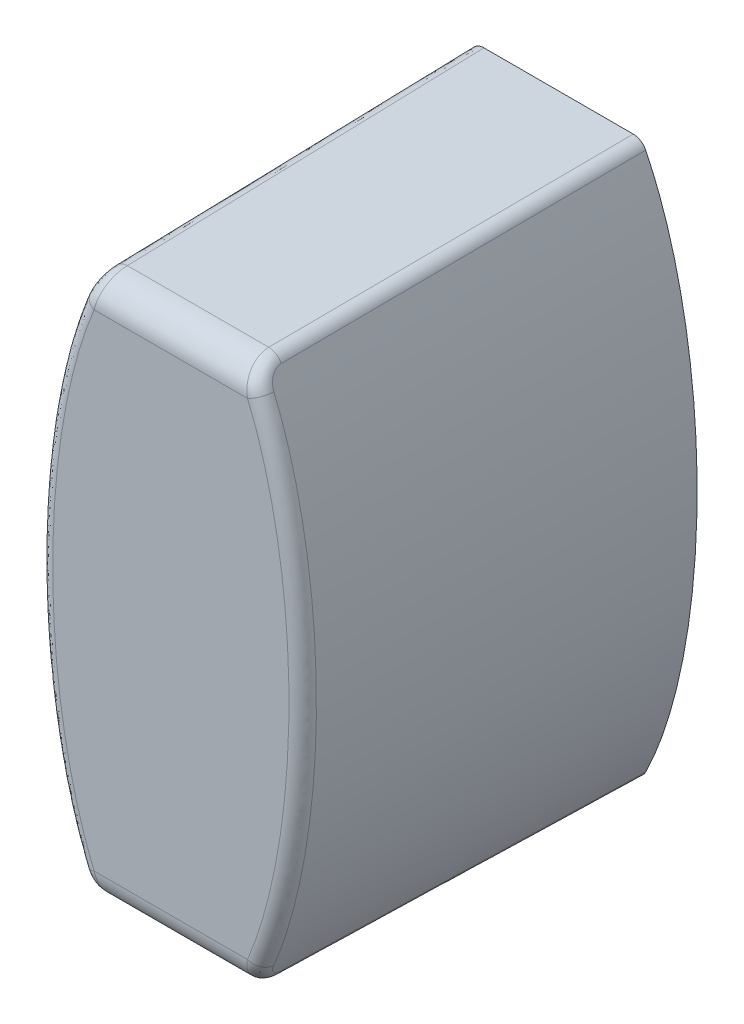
ISO-10303-21;
HEADER;
FILE_DESCRIPTION(('STEP AP214'),'2;1');
FILE_NAME('part.step','',(''),(''),'','','');
FILE_SCHEMA(('AUTOMOTIVE_DESIGN { 1 0 10303 214 1 1 1 1 }'));
ENDSEC;
DATA;
#1=APPLICATION_CONTEXT('core data for automotive mechanical design processes');
#2=APPLICATION_PROTOCOL_DEFINITION('international standard','automotive_design',2000,#1);
#3=PRODUCT_CONTEXT('',#1,'mechanical');
#4=PRODUCT('Part','Part','',(#3));
#5=PRODUCT_RELATED_PRODUCT_CATEGORY('part','',(#4));
#6=PRODUCT_DEFINITION_FORMATION('','',#4);
#7=PRODUCT_DEFINITION_CONTEXT('part definition',#1,'design');
#8=PRODUCT_DEFINITION('design','',#6,#7);
#9=PRODUCT_DEFINITION_SHAPE('','',#8);
#10=(LENGTH_UNIT() NAMED_UNIT(*) SI_UNIT(.MILLI.,.METRE.));
#11=(NAMED_UNIT(*) PLANE_ANGLE_UNIT() SI_UNIT($,.RADIAN.));
#12=(NAMED_UNIT(*) SI_UNIT($,.STERADIAN.) SOLID_ANGLE_UNIT());
#13=UNCERTAINTY_MEASURE_WITH_UNIT(LENGTH_MEASURE(1.E-05),#10,'distance_accuracy_value','');
#14=(GEOMETRIC_REPRESENTATION_CONTEXT(3) GLOBAL_UNCERTAINTY_ASSIGNED_CONTEXT((#13)) GLOBAL_UNIT_ASSIGNED_CONTEXT((#10,
#11,#12)) REPRESENTATION_CONTEXT('',''));
#15=CARTESIAN_POINT('',(0.,0.,0.));
#16=DIRECTION('',(0.,0.,1.));
#17=DIRECTION('',(1.,0.,0.));
#18=AXIS2_PLACEMENT_3D('',#15,#16,#17);
#19=CARTESIAN_POINT('',(0.,0.,0.));
#20=DIRECTION('',(0.,0.,1.));
#21=DIRECTION('',(1.,0.,0.));
#22=AXIS2_PLACEMENT_3D('',#19,#20,#21);
#23=PLANE('',#22);
#24=CARTESIAN_POINT('',(-3.,10.,0.));
#25=CARTESIAN_POINT('',(-3.04794483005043,9.91008854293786,0.));
#26=CARTESIAN_POINT('',(-3.09449211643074,9.81944485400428,0.));
#27=CARTESIAN_POINT('',(-3.18498157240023,9.63688152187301,0.));
#28=CARTESIAN_POINT('',(-3.22892412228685,9.54496206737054,0.));
#29=CARTESIAN_POINT('',(-3.35687454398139,9.26812873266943,0.));
#30=CARTESIAN_POINT('',(-3.43731146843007,9.08155838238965,0.));
#31=CARTESIAN_POINT('',(-3.58970372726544,8.70529568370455,0.));
#32=CARTESIAN_POINT('',(-3.66166978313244,8.51560763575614,0.));
#33=CARTESIAN_POINT('',(-3.79809957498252,8.13361418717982,0.));
#34=CARTESIAN_POINT('',(-3.8625651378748,7.94130943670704,0.));
#35=CARTESIAN_POINT('',(-3.98480574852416,7.55435872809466,0.));
#36=CARTESIAN_POINT('',(-4.04257322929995,7.35971039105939,0.));
#37=CARTESIAN_POINT('',(-4.15198379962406,6.96856952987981,0.));
#38=CARTESIAN_POINT('',(-4.20362286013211,6.77207588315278,0.));
#39=CARTESIAN_POINT('',(-4.30122982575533,6.37757289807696,0.));
#40=CARTESIAN_POINT('',(-4.34719456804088,6.17956277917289,0.));
#41=CARTESIAN_POINT('',(-4.43378964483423,5.78233426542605,0.));
#42=CARTESIAN_POINT('',(-4.47441863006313,5.58311557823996,0.));
#43=CARTESIAN_POINT('',(-4.58801385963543,4.98798214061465,0.));
#44=CARTESIAN_POINT('',(-4.65364643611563,4.59065169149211,0.));
#45=CARTESIAN_POINT('',(-4.76715385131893,3.79349494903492,0.));
#46=CARTESIAN_POINT('',(-4.81502809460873,3.39366857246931,0.));
#47=CARTESIAN_POINT('',(-4.89408602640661,2.59228500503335,0.));
#48=CARTESIAN_POINT('',(-4.9252659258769,2.19072744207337,0.));
#49=CARTESIAN_POINT('',(-4.97175501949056,1.38666713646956,0.));
#50=CARTESIAN_POINT('',(-4.98706274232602,0.984164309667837,0.));
#51=CARTESIAN_POINT('',(-5.00209094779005,0.17824369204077,0.));
#52=CARTESIAN_POINT('',(-5.00178719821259,-0.225174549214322,0.));
#53=CARTESIAN_POINT('',(-4.9855340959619,-1.03160792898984,0.));
#54=CARTESIAN_POINT('',(-4.96958823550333,-1.43462313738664,0.));
#55=CARTESIAN_POINT('',(-4.92175297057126,-2.23968094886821,0.));
#56=CARTESIAN_POINT('',(-4.88986474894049,-2.64172362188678,0.));
#57=CARTESIAN_POINT('',(-4.80929293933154,-3.44425520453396,0.));
#58=CARTESIAN_POINT('',(-4.76060503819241,-3.84474368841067,0.));
#59=CARTESIAN_POINT('',(-4.66697200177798,-4.49319232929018,0.));
#60=CARTESIAN_POINT('',(-4.62748825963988,-4.74194978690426,0.));
#61=CARTESIAN_POINT('',(-4.5410977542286,-5.23811898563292,0.));
#62=CARTESIAN_POINT('',(-4.49419282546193,-5.48553104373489,0.));
#63=CARTESIAN_POINT('',(-4.39242328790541,-5.97854041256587,0.));
#64=CARTESIAN_POINT('',(-4.3375641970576,-6.22413885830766,0.));
#65=CARTESIAN_POINT('',(-4.21927201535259,-6.71304650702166,0.));
#66=CARTESIAN_POINT('',(-4.15584645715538,-6.95635752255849,0.));
#67=CARTESIAN_POINT('',(-4.01978741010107,-7.43933560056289,0.));
#68=CARTESIAN_POINT('',(-3.94719238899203,-7.67901345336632,0.));
#69=CARTESIAN_POINT('',(-3.79137417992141,-8.15499855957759,0.));
#70=CARTESIAN_POINT('',(-3.70814825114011,-8.39130492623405,0.));
#71=CARTESIAN_POINT('',(-3.57419075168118,-8.74250393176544,0.));
#72=CARTESIAN_POINT('',(-3.52797376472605,-8.85912808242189,0.));
#73=CARTESIAN_POINT('',(-3.43228020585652,-9.09102675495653,0.));
#74=CARTESIAN_POINT('',(-3.38280386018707,-9.20630136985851,0.));
#75=CARTESIAN_POINT('',(-3.28009897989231,-9.43577715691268,0.));
#76=CARTESIAN_POINT('',(-3.22685501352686,-9.54997144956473,0.));
#77=CARTESIAN_POINT('',(-3.11644975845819,-9.77648176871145,0.));
#78=CARTESIAN_POINT('',(-3.05928752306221,-9.88879733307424,0.));
#79=CARTESIAN_POINT('',(-3.,-10.,0.));
#80=B_SPLINE_CURVE_WITH_KNOTS('',3,(#24,#25,#26,#27,#28,#29,#30,#31,#32,#33,#34,#35,#36,#37,#38,
#39,#40,#41,#42,#43,#44,#45,#46,#47,#48,#49,#50,#51,#52,#53,#54,#55,#56,#57,#58,#59,#60,#61,#62,
#63,#64,#65,#66,#67,#68,#69,#70,#71,#72,#73,#74,#75,#76,#77,#78,#79),.UNSPECIFIED.,.F.,.F.,(4,2,
2,2,2,2,2,2,2,2,2,2,2,2,2,2,2,2,2,2,2,2,2,2,2,2,2,4),(0.,0.305656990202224,0.611269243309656,
1.22052467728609,1.82900049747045,2.43732779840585,3.04633577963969,3.65574195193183,
4.26548628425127,4.87538450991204,6.08303592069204,7.2907278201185,8.49869370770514,
9.70677156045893,10.9167246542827,12.126407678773,13.336000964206,14.5459050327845,
15.3014239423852,16.0567563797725,16.8115673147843,17.565718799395,18.3168054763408,
19.0680861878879,19.4443897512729,19.820667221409,20.1985867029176,20.5765978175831),.UNSPECIFIED.);
#81=CARTESIAN_POINT('',(-3.14289286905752,9.72179036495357,0.));
#82=VERTEX_POINT('',#81);
#83=CARTESIAN_POINT('',(-3.14289286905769,-9.72179036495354,0.));
#84=VERTEX_POINT('',#83);
#85=EDGE_CURVE('E440',#82,#84,#80,.T.);
#86=ORIENTED_EDGE('',*,*,#85,.F.);
#87=CARTESIAN_POINT('',(-2.5026147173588,9.69363345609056,17.5517275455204));
#88=CARTESIAN_POINT('',(-2.81940793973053,9.69357229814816,17.5552312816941));
#89=CARTESIAN_POINT('',(-2.9546982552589,9.40712076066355,17.5517280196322));
#90=CARTESIAN_POINT('',(-2.50538572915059,9.69800727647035,17.301151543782));
#91=CARTESIAN_POINT('',(-2.82208778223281,9.6979468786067,17.3046117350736));
#92=CARTESIAN_POINT('',(-2.95741338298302,9.41161284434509,17.3011520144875));
#93=CARTESIAN_POINT('',(-2.50815674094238,9.70238109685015,17.0505755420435));
#94=CARTESIAN_POINT('',(-2.82476718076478,9.70232073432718,17.0540337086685));
#95=CARTESIAN_POINT('',(-2.96012851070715,9.41610492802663,17.0505760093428));
#96=CARTESIAN_POINT('',(-2.51092775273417,9.70675491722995,16.799999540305));
#97=CARTESIAN_POINT('',(-2.82744613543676,9.7066938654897,16.8034971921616));
#98=CARTESIAN_POINT('',(-2.96284363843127,9.42059701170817,16.8000000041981));
#99=CARTESIAN_POINT('',(-2.5248648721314,9.7287631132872,15.539150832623));
#100=CARTESIAN_POINT('',(-2.84091662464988,9.72869306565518,15.5431638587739));
#101=CARTESIAN_POINT('',(-2.97649923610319,9.44320036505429,15.5391512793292));
#102=CARTESIAN_POINT('',(-2.53877146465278,9.75077131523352,14.278301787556));
#103=CARTESIAN_POINT('',(-2.85436205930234,9.7507014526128,14.282304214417));
#104=CARTESIAN_POINT('',(-2.99012267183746,9.46580413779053,14.2783022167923));
#105=CARTESIAN_POINT('',(-2.56928123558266,9.79916155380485,11.5060268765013));
#106=CARTESIAN_POINT('',(-2.88385508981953,9.79908809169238,11.5102355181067));
#107=CARTESIAN_POINT('',(-3.02000630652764,9.51550463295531,11.5060272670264));
#108=CARTESIAN_POINT('',(-2.58587106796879,9.82554359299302,9.9946008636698));
#109=CARTESIAN_POINT('',(-2.89989179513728,9.82547035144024,9.9987968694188));
#110=CARTESIAN_POINT('',(-3.03625245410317,9.54260150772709,9.99460123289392));
#111=CARTESIAN_POINT('',(-2.61896290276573,9.87830768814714,6.97174787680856));
#112=CARTESIAN_POINT('',(-2.93187708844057,9.87823488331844,6.97591886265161));
#113=CARTESIAN_POINT('',(-3.06865235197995,9.59679601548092,6.97174820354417));
#114=CARTESIAN_POINT('',(-2.63546490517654,9.90468974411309,5.46032090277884));
#115=CARTESIAN_POINT('',(-2.94782577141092,9.90461716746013,5.46447881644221));
#116=CARTESIAN_POINT('',(-3.0848061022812,9.62389364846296,5.4603212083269));
#117=CARTESIAN_POINT('',(-2.66625628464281,9.95404786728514,2.63259592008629));
#118=CARTESIAN_POINT('',(-2.97758374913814,9.95397885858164,2.63654942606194));
#119=CARTESIAN_POINT('',(-3.1149417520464,9.67459098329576,2.63259618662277));
#120=CARTESIAN_POINT('',(-2.68055626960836,9.97702393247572,1.31629802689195));
#121=CARTESIAN_POINT('',(-2.99140182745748,9.97695511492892,1.32024058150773));
#122=CARTESIAN_POINT('',(-3.1289347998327,9.69819062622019,1.31629827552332));
#123=CARTESIAN_POINT('',(-2.69482294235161,10.0000000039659,-2.27207127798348E-07));
#124=CARTESIAN_POINT('',(-3.00519257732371,9.99994130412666,0.00336268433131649));
#125=CARTESIAN_POINT('',(-3.14289286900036,9.72179036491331,3.95809106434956E-09));
#126=CARTESIAN_POINT('',(-2.69693785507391,10.0034060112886,-0.195130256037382));
#127=CARTESIAN_POINT('',(-3.00723592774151,10.0033471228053,-0.19175653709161));
#128=CARTESIAN_POINT('',(-3.14496203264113,9.72528882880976,-0.195130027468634));
#129=CARTESIAN_POINT('',(-2.69905203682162,10.0068120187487,-0.390260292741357));
#130=CARTESIAN_POINT('',(-3.00927867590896,10.0067531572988,-0.386888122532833));
#131=CARTESIAN_POINT('',(-3.14703043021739,9.72878729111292,-0.390260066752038));
#132=CARTESIAN_POINT('',(-2.76664652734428,10.1157463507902,-6.6311039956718));
#133=CARTESIAN_POINT('',(-3.07446336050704,10.115479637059,-6.61582397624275));
#134=CARTESIAN_POINT('',(-3.21315948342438,9.84067855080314,-6.63110385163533));
#135=CARTESIAN_POINT('',(-2.83142587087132,10.2212748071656,-12.6768252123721));
#136=CARTESIAN_POINT('',(-3.13703169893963,10.2210085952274,-12.6615739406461));
#137=CARTESIAN_POINT('',(-3.276485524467,9.9490698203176,-12.6768251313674));
#138=CARTESIAN_POINT('',(-2.89550351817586,10.3268033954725,-18.72255398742));
#139=CARTESIAN_POINT('',(-3.19903052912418,10.3267472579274,-18.7193378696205));
#140=CARTESIAN_POINT('',(-3.33907618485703,10.0574595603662,-18.7225539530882));
#141=(BOUNDED_SURFACE() B_SPLINE_SURFACE(3,2,((#87,#88,#89),(#90,#91,#92),(#93,#94,#95),(#96,
#97,#98),(#99,#100,#101),(#102,#103,#104),(#105,#106,#107),(#108,#109,#110),(#111,#112,#113),
(#114,#115,#116),(#117,#118,#119),(#120,#121,#122),(#123,#124,#125),(#126,#127,#128),(#129,#130,
#131),(#132,#133,#134),(#135,#136,#137),(#138,#139,#140)),.UNSPECIFIED.,.F.,.F.,
.F.) B_SPLINE_SURFACE_WITH_KNOTS((4,3,2,2,2,3,2,4),(3,3),(0.,0.75188847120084,4.53524182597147,
9.07048365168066,13.6057254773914,17.5554536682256,18.1409673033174,36.2819347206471),(0.,1.),
.UNSPECIFIED.) GEOMETRIC_REPRESENTATION_ITEM() RATIONAL_B_SPLINE_SURFACE(((1.,0.844707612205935,
1.),(1.,0.844777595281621,1.),(1.,0.844847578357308,1.),(1.,0.844917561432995,1.),(1.,
0.845269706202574,1.),(1.,0.845621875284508,1.),(1.,0.846396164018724,1.),(1.,0.846818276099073,
1.),(1.,0.847662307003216,1.),(1.,0.848084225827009,1.),(1.,0.848873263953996,1.),(1.,
0.849240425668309,1.),(1.,0.849607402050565,1.),(1.,0.849661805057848,1.),(1.,0.849716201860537,
1.),(1.,0.851455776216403,1.),(1.,0.853135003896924,1.),(1.,0.854808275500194,1.))) REPRESENTATION_ITEM('') SURFACE());
#142=CARTESIAN_POINT('',(-3.14289286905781,9.72179036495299,0.));
#143=CARTESIAN_POINT('',(-3.13043974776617,9.74701135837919,0.));
#144=CARTESIAN_POINT('',(-3.11582068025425,9.77115270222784,0.));
#145=CARTESIAN_POINT('',(-3.08276802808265,9.81662992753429,0.));
#146=CARTESIAN_POINT('',(-3.06433822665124,9.83796855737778,0.));
#147=CARTESIAN_POINT('',(-3.02414717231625,9.87725403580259,0.));
#148=CARTESIAN_POINT('',(-3.00238464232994,9.89519957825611,0.));
#149=CARTESIAN_POINT('',(-2.95615102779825,9.92718700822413,0.));
#150=CARTESIAN_POINT('',(-2.9316793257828,9.941228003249,0.));
#151=CARTESIAN_POINT('',(-2.88071333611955,9.96500886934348,0.));
#152=CARTESIAN_POINT('',(-2.8542179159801,9.97474631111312,0.));
#153=CARTESIAN_POINT('',(-2.79999914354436,9.98961683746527,0.));
#154=CARTESIAN_POINT('',(-2.77227766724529,9.99475671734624,0.));
#155=CARTESIAN_POINT('',(-2.72788057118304,9.99918276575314,0.));
#156=CARTESIAN_POINT('',(-2.71134720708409,10.0000064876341,0.));
#157=CARTESIAN_POINT('',(-2.69482293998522,10.,0.));
#158=B_SPLINE_CURVE_WITH_KNOTS('',3,(#142,#143,#144,#145,#146,#147,#148,#149,#150,#151,#152,
#153,#154,#155,#156,#157),.UNSPECIFIED.,.F.,.F.,(4,2,2,2,2,2,2,4),(0.,0.0842716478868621,
0.16846003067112,0.252680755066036,0.336920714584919,0.421208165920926,0.505370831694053,
0.554947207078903),.UNSPECIFIED.);
#159=CARTESIAN_POINT('',(-2.69482293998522,10.,0.));
#160=VERTEX_POINT('',#159);
#161=EDGE_CURVE('E424',#82,#160,#158,.T.);
#162=ORIENTED_EDGE('',*,*,#161,.T.);
#163=DIRECTION('',(-1.,0.,0.));
#164=VECTOR('',#163,1.);
#165=CARTESIAN_POINT('',(-3.,10.,0.));
#166=LINE('',#165,#164);
#167=CARTESIAN_POINT('',(2.69482293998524,10.,0.));
#168=VERTEX_POINT('',#167);
#169=EDGE_CURVE('E485',#168,#160,#166,.T.);
#170=ORIENTED_EDGE('',*,*,#169,.F.);
#171=CARTESIAN_POINT('',(2.95469825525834,9.40712076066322,17.5517280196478));
#172=CARTESIAN_POINT('',(2.81940793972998,9.69357229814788,17.5552312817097));
#173=CARTESIAN_POINT('',(2.50261471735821,9.69363345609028,17.551727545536));
#174=CARTESIAN_POINT('',(2.95741338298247,9.41161284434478,17.3011520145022));
#175=CARTESIAN_POINT('',(2.82208778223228,9.69794687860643,17.3046117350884));
#176=CARTESIAN_POINT('',(2.50538572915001,9.6980072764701,17.3011515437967));
#177=CARTESIAN_POINT('',(2.96012851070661,9.41610492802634,17.0505760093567));
#178=CARTESIAN_POINT('',(2.82476718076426,9.70232073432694,17.0540337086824));
#179=CARTESIAN_POINT('',(2.50815674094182,9.70238109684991,17.0505755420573));
#180=CARTESIAN_POINT('',(2.96284363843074,9.42059701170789,16.8000000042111));
#181=CARTESIAN_POINT('',(2.82744613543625,9.70669386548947,16.8034971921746));
#182=CARTESIAN_POINT('',(2.51092775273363,9.70675491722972,16.799999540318));
#183=CARTESIAN_POINT('',(2.97649923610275,9.44320036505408,15.5391512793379));
#184=CARTESIAN_POINT('',(2.84091662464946,9.72869306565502,15.5431638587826));
#185=CARTESIAN_POINT('',(2.52486487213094,9.72876311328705,15.5391508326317));
#186=CARTESIAN_POINT('',(2.99012267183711,9.4658041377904,14.2783022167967));
#187=CARTESIAN_POINT('',(2.854362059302,9.75070145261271,14.2823042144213));
#188=CARTESIAN_POINT('',(2.5387714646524,9.75077131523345,14.2783017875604));
#189=CARTESIAN_POINT('',(3.02000630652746,9.51550463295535,11.5060272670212));
#190=CARTESIAN_POINT('',(2.88385508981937,9.79908809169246,11.5102355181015));
#191=CARTESIAN_POINT('',(2.56928123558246,9.79916155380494,11.5060268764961));
#192=CARTESIAN_POINT('',(3.03625245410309,9.54260150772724,9.99460123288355));
#193=CARTESIAN_POINT('',(2.89989179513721,9.82547035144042,9.99879686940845));
#194=CARTESIAN_POINT('',(2.58587106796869,9.82554359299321,9.99460086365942));
#195=CARTESIAN_POINT('',(3.06865235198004,9.59679601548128,6.97174820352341));
#196=CARTESIAN_POINT('',(2.93187708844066,9.87823488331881,6.97591886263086));
#197=CARTESIAN_POINT('',(2.61896290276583,9.87830768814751,6.97174787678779));
#198=CARTESIAN_POINT('',(3.08480610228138,9.62389364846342,5.46032120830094));
#199=CARTESIAN_POINT('',(2.9478257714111,9.90461716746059,5.46447881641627));
#200=CARTESIAN_POINT('',(2.63546490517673,9.90468974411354,5.46032090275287));
#201=CARTESIAN_POINT('',(3.11494175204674,9.67459098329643,2.6325961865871));
#202=CARTESIAN_POINT('',(2.97758374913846,9.95397885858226,2.63654942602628));
#203=CARTESIAN_POINT('',(2.66625628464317,9.95404786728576,2.6325959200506));
#204=CARTESIAN_POINT('',(3.1289347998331,9.69819062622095,1.31629827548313));
#205=CARTESIAN_POINT('',(2.99140182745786,9.97695511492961,1.32024058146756));
#206=CARTESIAN_POINT('',(2.68055626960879,9.97702393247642,1.31629802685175));
#207=CARTESIAN_POINT('',(3.14289286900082,9.72179036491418,3.9133720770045E-09));
#208=CARTESIAN_POINT('',(3.00519257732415,9.99994130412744,0.00336268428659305));
#209=CARTESIAN_POINT('',(2.69482294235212,10.0000000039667,-2.27251856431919E-07));
#210=CARTESIAN_POINT('',(3.1449620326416,9.72528882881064,-0.195130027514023));
#211=CARTESIAN_POINT('',(3.00723592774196,10.0033471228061,-0.191756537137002));
#212=CARTESIAN_POINT('',(2.69693785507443,10.0034060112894,-0.195130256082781));
#213=CARTESIAN_POINT('',(3.14703043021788,9.72878729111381,-0.390260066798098));
#214=CARTESIAN_POINT('',(3.00927867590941,10.0067531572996,-0.386888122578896));
#215=CARTESIAN_POINT('',(2.69905203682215,10.0068120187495,-0.390260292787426));
#216=CARTESIAN_POINT('',(3.21315948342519,9.84067855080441,-6.63110385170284));
#217=CARTESIAN_POINT('',(3.07446336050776,10.11547963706,-6.61582397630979));
#218=CARTESIAN_POINT('',(2.76664652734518,10.1157463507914,-6.63110399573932));
#219=CARTESIAN_POINT('',(3.27648552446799,9.94906982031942,-12.6768251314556));
#220=CARTESIAN_POINT('',(3.13703169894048,10.2210085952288,-12.6615739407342));
#221=CARTESIAN_POINT('',(2.83142587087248,10.2212748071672,-12.6768252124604));
#222=CARTESIAN_POINT('',(3.33907618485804,10.0574595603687,-18.7225539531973));
#223=CARTESIAN_POINT('',(3.199030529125,10.3267472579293,-18.7193378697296));
#224=CARTESIAN_POINT('',(2.89550351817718,10.3268033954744,-18.7225539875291));
#225=(BOUNDED_SURFACE() B_SPLINE_SURFACE(3,2,((#171,#172,#173),(#174,#175,#176),(#177,#178,
#179),(#180,#181,#182),(#183,#184,#185),(#186,#187,#188),(#189,#190,#191),(#192,#193,#194),
(#195,#196,#197),(#198,#199,#200),(#201,#202,#203),(#204,#205,#206),(#207,#208,#209),(#210,#211,
#212),(#213,#214,#215),(#216,#217,#218),(#219,#220,#221),(#222,#223,#224)),.UNSPECIFIED.,.F.,
.F.,.F.) B_SPLINE_SURFACE_WITH_KNOTS((4,3,2,2,2,3,2,4),(3,3),(0.,0.751888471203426,
4.53524182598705,9.07048365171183,13.6057254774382,17.555453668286,18.1409673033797,
36.2819347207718),(0.,1.),
.UNSPECIFIED.) GEOMETRIC_REPRESENTATION_ITEM() RATIONAL_B_SPLINE_SURFACE(((1.,0.844707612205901,
1.),(1.,0.844777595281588,1.),(1.,0.844847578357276,1.),(1.,0.844917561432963,1.),(1.,
0.845269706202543,1.),(1.,0.845621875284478,1.),(1.,0.846396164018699,1.),(1.,0.846818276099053,
1.),(1.,0.847662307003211,1.),(1.,0.848084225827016,1.),(1.,0.848873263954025,1.),(1.,
0.849240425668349,1.),(1.,0.849607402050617,1.),(1.,0.849661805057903,1.),(1.,0.849716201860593,
1.),(1.,0.851455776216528,1.),(1.,0.853135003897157,1.),(1.,0.854808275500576,1.))) REPRESENTATION_ITEM('') SURFACE());
#226=CARTESIAN_POINT('',(2.69482293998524,10.,0.));
#227=CARTESIAN_POINT('',(2.72295082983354,10.0000239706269,0.));
#228=CARTESIAN_POINT('',(2.75107164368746,9.9976278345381,0.));
#229=CARTESIAN_POINT('',(2.80649052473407,9.98817248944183,0.));
#230=CARTESIAN_POINT('',(2.83378937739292,9.98111789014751,0.));
#231=CARTESIAN_POINT('',(2.88682459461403,9.96251854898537,0.));
#232=CARTESIAN_POINT('',(2.91256035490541,9.95097208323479,0.));
#233=CARTESIAN_POINT('',(2.9617343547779,9.92372028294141,0.));
#234=CARTESIAN_POINT('',(2.9851720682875,9.90801399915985,0.));
#235=CARTESIAN_POINT('',(3.02908950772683,9.87288110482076,0.));
#236=CARTESIAN_POINT('',(3.0495675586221,9.85345240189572,0.));
#237=CARTESIAN_POINT('',(3.08694146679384,9.81145241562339,0.));
#238=CARTESIAN_POINT('',(3.10384258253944,9.78888582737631,0.));
#239=CARTESIAN_POINT('',(3.12749947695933,9.75105669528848,0.));
#240=CARTESIAN_POINT('',(3.13557023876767,9.73660355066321,0.));
#241=CARTESIAN_POINT('',(3.1428928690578,9.72179036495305,0.));
#242=B_SPLINE_CURVE_WITH_KNOTS('',3,(#226,#227,#228,#229,#230,#231,#232,#233,#234,#235,#236,
#237,#238,#239,#240,#241),.UNSPECIFIED.,.F.,.F.,(4,2,2,2,2,2,2,4),(0.,0.0842716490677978,
0.168460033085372,0.252680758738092,0.336920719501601,0.421208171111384,0.50537083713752,
0.554947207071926),.UNSPECIFIED.);
#243=CARTESIAN_POINT('',(3.14289286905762,9.72179036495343,0.));
#244=VERTEX_POINT('',#243);
#245=EDGE_CURVE('E454',#168,#244,#242,.T.);
#246=ORIENTED_EDGE('',*,*,#245,.T.);
#247=CARTESIAN_POINT('',(3.,-10.,0.));
#248=CARTESIAN_POINT('',(3.04794483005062,-9.91008854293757,0.));
#249=CARTESIAN_POINT('',(3.0944921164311,-9.81944485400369,0.));
#250=CARTESIAN_POINT('',(3.18498157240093,-9.63688152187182,0.));
#251=CARTESIAN_POINT('',(3.22892412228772,-9.54496206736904,0.));
#252=CARTESIAN_POINT('',(3.3568745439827,-9.268128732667,0.));
#253=CARTESIAN_POINT('',(3.43731146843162,-9.08155838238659,0.));
#254=CARTESIAN_POINT('',(3.5897037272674,-8.70529568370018,0.));
#255=CARTESIAN_POINT('',(3.66166978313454,-8.51560763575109,0.));
#256=CARTESIAN_POINT('',(3.79809957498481,-8.13361418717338,0.));
#257=CARTESIAN_POINT('',(3.86256513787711,-7.94130943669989,0.));
#258=CARTESIAN_POINT('',(3.98480574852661,-7.5543587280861,0.));
#259=CARTESIAN_POINT('',(4.04257322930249,-7.35971039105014,0.));
#260=CARTESIAN_POINT('',(4.15198379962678,-6.96856952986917,0.));
#261=CARTESIAN_POINT('',(4.20362286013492,-6.77207588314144,0.));
#262=CARTESIAN_POINT('',(4.30122982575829,-6.37757289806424,0.));
#263=CARTESIAN_POINT('',(4.3471945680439,-6.17956277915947,0.));
#264=CARTESIAN_POINT('',(4.43378964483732,-5.78233426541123,0.));
#265=CARTESIAN_POINT('',(4.47441863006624,-5.58311557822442,0.));
#266=CARTESIAN_POINT('',(4.58801385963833,-4.987982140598,0.));
#267=CARTESIAN_POINT('',(4.6536464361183,-4.59065169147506,0.));
#268=CARTESIAN_POINT('',(4.76715385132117,-3.79349494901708,0.));
#269=CARTESIAN_POINT('',(4.81502809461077,-3.39366857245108,0.));
#270=CARTESIAN_POINT('',(4.89408602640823,-2.59228500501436,0.));
#271=CARTESIAN_POINT('',(4.92526592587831,-2.19072744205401,0.));
#272=CARTESIAN_POINT('',(4.97175501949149,-1.38666713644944,0.));
#273=CARTESIAN_POINT('',(4.98706274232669,-0.98416430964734,0.));
#274=CARTESIAN_POINT('',(5.00209094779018,-0.178243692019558,0.));
#275=CARTESIAN_POINT('',(5.00178719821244,0.225174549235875,0.));
#276=CARTESIAN_POINT('',(4.98553409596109,1.03160792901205,0.));
#277=CARTESIAN_POINT('',(4.96958823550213,1.43462313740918,0.));
#278=CARTESIAN_POINT('',(4.92175297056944,2.23968094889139,0.));
#279=CARTESIAN_POINT('',(4.88986474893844,2.64172362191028,0.));
#280=CARTESIAN_POINT('',(4.80929293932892,3.44425520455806,0.));
#281=CARTESIAN_POINT('',(4.76060503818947,3.84474368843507,0.));
#282=CARTESIAN_POINT('',(4.66697200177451,4.49319232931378,0.));
#283=CARTESIAN_POINT('',(4.62748825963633,4.74194978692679,0.));
#284=CARTESIAN_POINT('',(4.54109775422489,5.2381189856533,0.));
#285=CARTESIAN_POINT('',(4.49419282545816,5.48553104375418,0.));
#286=CARTESIAN_POINT('',(4.39242328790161,5.97854041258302,0.));
#287=CARTESIAN_POINT('',(4.33756419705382,6.22413885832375,0.));
#288=CARTESIAN_POINT('',(4.21927201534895,6.71304650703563,0.));
#289=CARTESIAN_POINT('',(4.15584645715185,6.95635752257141,0.));
#290=CARTESIAN_POINT('',(4.01978741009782,7.43933560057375,0.));
#291=CARTESIAN_POINT('',(3.94719238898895,7.67901345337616,0.));
#292=CARTESIAN_POINT('',(3.79137417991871,8.1549985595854,0.));
#293=CARTESIAN_POINT('',(3.70814825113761,8.39130492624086,0.));
#294=CARTESIAN_POINT('',(3.57419075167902,8.74250393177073,0.));
#295=CARTESIAN_POINT('',(3.52797376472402,8.85912808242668,0.));
#296=CARTESIAN_POINT('',(3.43228020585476,9.09102675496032,0.));
#297=CARTESIAN_POINT('',(3.38280386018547,9.20630136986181,0.));
#298=CARTESIAN_POINT('',(3.28009897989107,9.435777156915,0.));
#299=CARTESIAN_POINT('',(3.22685501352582,9.54997144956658,0.));
#300=CARTESIAN_POINT('',(3.11644975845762,9.77648176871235,0.));
#301=CARTESIAN_POINT('',(3.0592875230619,9.88879733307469,0.));
#302=CARTESIAN_POINT('',(2.99999999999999,10.,0.));
#303=B_SPLINE_CURVE_WITH_KNOTS('',3,(#247,#248,#249,#250,#251,#252,#253,#254,#255,#256,#257,
#258,#259,#260,#261,#262,#263,#264,#265,#266,#267,#268,#269,#270,#271,#272,#273,#274,#275,#276,
#277,#278,#279,#280,#281,#282,#283,#284,#285,#286,#287,#288,#289,#290,#291,#292,#293,#294,#295,
#296,#297,#298,#299,#300,#301,#302),.UNSPECIFIED.,.F.,.F.,(4,2,2,2,2,2,2,2,2,2,2,2,2,2,2,2,2,2,
2,2,2,2,2,2,2,2,2,4),(0.,0.305656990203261,0.611269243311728,1.22052467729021,1.82900049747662,
2.43732779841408,3.04633577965,3.65574195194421,4.26548628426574,4.87538450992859,
6.08303592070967,7.29072782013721,8.49869370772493,9.70677156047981,10.9167246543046,
12.1264076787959,13.33600096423,14.5459050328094,15.3014239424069,16.0567563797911,
16.8115673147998,17.5657187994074,18.3168054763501,19.0680861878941,19.4443897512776,
19.8206672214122,20.1985867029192,20.5765978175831),.UNSPECIFIED.);
#304=CARTESIAN_POINT('',(3.14289286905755,-9.72179036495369,0.));
#305=VERTEX_POINT('',#304);
#306=EDGE_CURVE('E448',#305,#244,#303,.T.);
#307=ORIENTED_EDGE('',*,*,#306,.F.);
#308=CARTESIAN_POINT('',(2.50261471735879,-9.69363345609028,17.551727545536));
#309=CARTESIAN_POINT('',(2.81940793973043,-9.69357229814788,17.5552312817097));
#310=CARTESIAN_POINT('',(2.95469825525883,-9.40712076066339,17.5517280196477));
#311=CARTESIAN_POINT('',(2.50538572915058,-9.6980072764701,17.3011515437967));
#312=CARTESIAN_POINT('',(2.82208778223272,-9.69794687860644,17.3046117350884));
#313=CARTESIAN_POINT('',(2.95741338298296,-9.41161284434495,17.3011520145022));
#314=CARTESIAN_POINT('',(2.50815674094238,-9.70238109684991,17.0505755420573));
#315=CARTESIAN_POINT('',(2.82476718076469,-9.70232073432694,17.0540337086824));
#316=CARTESIAN_POINT('',(2.96012851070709,-9.4161049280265,17.0505760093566));
#317=CARTESIAN_POINT('',(2.51092775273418,-9.70675491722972,16.799999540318));
#318=CARTESIAN_POINT('',(2.82744613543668,-9.70669386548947,16.8034971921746));
#319=CARTESIAN_POINT('',(2.96284363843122,-9.42059701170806,16.8000000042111));
#320=CARTESIAN_POINT('',(2.52486487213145,-9.72876311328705,15.5391508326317));
#321=CARTESIAN_POINT('',(2.84091662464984,-9.72869306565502,15.5431638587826));
#322=CARTESIAN_POINT('',(2.97649923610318,-9.44320036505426,15.5391512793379));
#323=CARTESIAN_POINT('',(2.53877146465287,-9.75077131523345,14.2783017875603));
#324=CARTESIAN_POINT('',(2.85436205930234,-9.75070145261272,14.2823042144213));
#325=CARTESIAN_POINT('',(2.9901226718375,-9.46580413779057,14.2783022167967));
#326=CARTESIAN_POINT('',(2.56928123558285,-9.79916155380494,11.5060268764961));
#327=CARTESIAN_POINT('',(2.88385508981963,-9.79908809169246,11.5102355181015));
#328=CARTESIAN_POINT('',(3.02000630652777,-9.51550463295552,11.5060272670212));
#329=CARTESIAN_POINT('',(2.58587106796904,-9.82554359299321,9.99460086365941));
#330=CARTESIAN_POINT('',(2.89989179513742,-9.82547035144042,9.99879686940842));
#331=CARTESIAN_POINT('',(3.03625245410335,-9.5426015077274,9.99460123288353));
#332=CARTESIAN_POINT('',(2.61896290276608,-9.87830768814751,6.97174787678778));
#333=CARTESIAN_POINT('',(2.93187708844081,-9.8782348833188,6.97591886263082));
#334=CARTESIAN_POINT('',(3.06865235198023,-9.59679601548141,6.97174820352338));
#335=CARTESIAN_POINT('',(2.63546490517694,-9.90468974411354,5.46032090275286));
#336=CARTESIAN_POINT('',(2.94782577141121,-9.90461716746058,5.46447881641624));
#337=CARTESIAN_POINT('',(3.08480610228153,-9.62389364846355,5.46032120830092));
#338=CARTESIAN_POINT('',(2.6662562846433,-9.95404786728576,2.63259592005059));
#339=CARTESIAN_POINT('',(2.97758374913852,-9.95397885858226,2.63654942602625));
#340=CARTESIAN_POINT('',(3.11494175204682,-9.67459098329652,2.63259618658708));
#341=CARTESIAN_POINT('',(2.6805562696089,-9.97702393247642,1.31629802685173));
#342=CARTESIAN_POINT('',(2.9914018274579,-9.97695511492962,1.32024058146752));
#343=CARTESIAN_POINT('',(3.12893479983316,-9.69819062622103,1.31629827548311));
#344=CARTESIAN_POINT('',(2.69482294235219,-10.0000000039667,-2.27251869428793E-07));
#345=CARTESIAN_POINT('',(3.00519257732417,-9.99994130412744,0.00336268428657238));
#346=CARTESIAN_POINT('',(3.14289286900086,-9.72179036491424,3.91334945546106E-09));
#347=CARTESIAN_POINT('',(2.69693785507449,-10.0034060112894,-0.195130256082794));
#348=CARTESIAN_POINT('',(3.00723592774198,-10.0033471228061,-0.191756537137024));
#349=CARTESIAN_POINT('',(3.14496203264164,-9.7252888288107,-0.195130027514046));
#350=CARTESIAN_POINT('',(2.69905203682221,-10.0068120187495,-0.390260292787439));
#351=CARTESIAN_POINT('',(3.00927867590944,-10.0067531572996,-0.386888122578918));
#352=CARTESIAN_POINT('',(3.14703043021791,-9.72878729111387,-0.390260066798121));
#353=CARTESIAN_POINT('',(2.76664652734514,-10.1157463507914,-6.63110399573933));
#354=CARTESIAN_POINT('',(3.07446336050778,-10.1154796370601,-6.61582397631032));
#355=CARTESIAN_POINT('',(3.21315948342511,-9.84067855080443,-6.63110385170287));
#356=CARTESIAN_POINT('',(2.83142587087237,-10.2212748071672,-12.6768252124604));
#357=CARTESIAN_POINT('',(3.13703169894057,-10.2210085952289,-12.6615739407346));
#358=CARTESIAN_POINT('',(3.27648552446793,-9.94906982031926,-12.6768251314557));
#359=CARTESIAN_POINT('',(2.89550351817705,-10.3268033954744,-18.7225539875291));
#360=CARTESIAN_POINT('',(3.19903052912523,-10.3267472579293,-18.7193378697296));
#361=CARTESIAN_POINT('',(3.33907618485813,-10.0574595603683,-18.7225539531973));
#362=(BOUNDED_SURFACE() B_SPLINE_SURFACE(3,2,((#308,#309,#310),(#311,#312,#313),(#314,#315,
#316),(#317,#318,#319),(#320,#321,#322),(#323,#324,#325),(#326,#327,#328),(#329,#330,#331),
(#332,#333,#334),(#335,#336,#337),(#338,#339,#340),(#341,#342,#343),(#344,#345,#346),(#347,#348,
#349),(#350,#351,#352),(#353,#354,#355),(#356,#357,#358),(#359,#360,#361)),.UNSPECIFIED.,.F.,
.F.,.F.) B_SPLINE_SURFACE_WITH_KNOTS((4,3,2,2,2,3,2,4),(3,3),(0.,0.751888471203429,
4.53524182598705,9.07048365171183,13.6057254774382,17.555453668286,18.1409673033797,
36.2819347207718),(0.,1.),
.UNSPECIFIED.) GEOMETRIC_REPRESENTATION_ITEM() RATIONAL_B_SPLINE_SURFACE(((1.,0.844707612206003,
1.),(1.,0.844777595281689,1.),(1.,0.844847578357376,1.),(1.,0.844917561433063,1.),(1.,
0.845269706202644,1.),(1.,0.845621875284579,1.),(1.,0.846396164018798,1.),(1.,0.846818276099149,
1.),(1.,0.847662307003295,1.),(1.,0.848084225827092,1.),(1.,0.848873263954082,1.),(1.,
0.849240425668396,1.),(1.,0.849607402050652,1.),(1.,0.849661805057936,1.),(1.,0.849716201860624,
1.),(1.,0.851455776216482,1.),(1.,0.853135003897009,1.),(1.,0.854808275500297,1.))) REPRESENTATION_ITEM('') SURFACE());
#363=CARTESIAN_POINT('',(3.14289286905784,-9.72179036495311,0.));
#364=CARTESIAN_POINT('',(3.13043974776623,-9.74701135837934,0.));
#365=CARTESIAN_POINT('',(3.1158206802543,-9.77115270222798,0.));
#366=CARTESIAN_POINT('',(3.08276802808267,-9.8166299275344,0.));
#367=CARTESIAN_POINT('',(3.06433822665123,-9.83796855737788,0.));
#368=CARTESIAN_POINT('',(3.02414717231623,-9.87725403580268,0.));
#369=CARTESIAN_POINT('',(3.00238464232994,-9.89519957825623,0.));
#370=CARTESIAN_POINT('',(2.95615102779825,-9.92718700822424,0.));
#371=CARTESIAN_POINT('',(2.93167932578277,-9.94122800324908,0.));
#372=CARTESIAN_POINT('',(2.88071333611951,-9.96500886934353,0.));
#373=CARTESIAN_POINT('',(2.85421791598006,-9.97474631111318,0.));
#374=CARTESIAN_POINT('',(2.79999914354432,-9.98961683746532,0.));
#375=CARTESIAN_POINT('',(2.77227766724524,-9.99475671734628,0.));
#376=CARTESIAN_POINT('',(2.72788057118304,-9.99918276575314,0.));
#377=CARTESIAN_POINT('',(2.71134720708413,-10.0000064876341,0.));
#378=CARTESIAN_POINT('',(2.69482293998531,-10.,0.));
#379=B_SPLINE_CURVE_WITH_KNOTS('',3,(#363,#364,#365,#366,#367,#368,#369,#370,#371,#372,#373,
#374,#375,#376,#377,#378),.UNSPECIFIED.,.F.,.F.,(4,2,2,2,2,2,2,4),(0.,0.0842716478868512,
0.168460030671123,0.252680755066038,0.336920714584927,0.421208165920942,0.505370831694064,
0.554947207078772),.UNSPECIFIED.);
#380=CARTESIAN_POINT('',(2.69482293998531,-10.,0.));
#381=VERTEX_POINT('',#380);
#382=EDGE_CURVE('E425',#305,#381,#379,.T.);
#383=ORIENTED_EDGE('',*,*,#382,.T.);
#384=DIRECTION('',(1.,0.,0.));
#385=VECTOR('',#384,1.);
#386=CARTESIAN_POINT('',(-3.,-10.,0.));
#387=LINE('',#386,#385);
#388=CARTESIAN_POINT('',(-2.69482293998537,-10.,0.));
#389=VERTEX_POINT('',#388);
#390=EDGE_CURVE('E882',#389,#381,#387,.T.);
#391=ORIENTED_EDGE('',*,*,#390,.F.);
#392=CARTESIAN_POINT('',(-2.95469825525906,-9.40712076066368,17.5517280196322));
#393=CARTESIAN_POINT('',(-2.81940793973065,-9.69357229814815,17.5552312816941));
#394=CARTESIAN_POINT('',(-2.50261471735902,-9.69363345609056,17.5517275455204));
#395=CARTESIAN_POINT('',(-2.95741338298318,-9.41161284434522,17.3011520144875));
#396=CARTESIAN_POINT('',(-2.82208778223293,-9.69794687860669,17.3046117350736));
#397=CARTESIAN_POINT('',(-2.50538572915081,-9.69800727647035,17.301151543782));
#398=CARTESIAN_POINT('',(-2.9601285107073,-9.41610492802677,17.0505760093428));
#399=CARTESIAN_POINT('',(-2.8247671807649,-9.70232073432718,17.0540337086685));
#400=CARTESIAN_POINT('',(-2.5081567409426,-9.70238109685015,17.0505755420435));
#401=CARTESIAN_POINT('',(-2.96284363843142,-9.42059701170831,16.8000000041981));
#402=CARTESIAN_POINT('',(-2.82744613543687,-9.7066938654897,16.8034971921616));
#403=CARTESIAN_POINT('',(-2.51092775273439,-9.70675491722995,16.799999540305));
#404=CARTESIAN_POINT('',(-2.97649923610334,-9.44320036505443,15.5391512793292));
#405=CARTESIAN_POINT('',(-2.84091662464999,-9.72869306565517,15.5431638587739));
#406=CARTESIAN_POINT('',(-2.52486487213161,-9.7287631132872,15.539150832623));
#407=CARTESIAN_POINT('',(-2.9901226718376,-9.46580413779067,14.2783022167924));
#408=CARTESIAN_POINT('',(-2.85436205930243,-9.75070145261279,14.282304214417));
#409=CARTESIAN_POINT('',(-2.53877146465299,-9.75077131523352,14.278301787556));
#410=CARTESIAN_POINT('',(-3.02000630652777,-9.51550463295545,11.5060272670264));
#411=CARTESIAN_POINT('',(-2.88385508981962,-9.79908809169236,11.5102355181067));
#412=CARTESIAN_POINT('',(-2.56928123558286,-9.79916155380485,11.5060268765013));
#413=CARTESIAN_POINT('',(-3.03625245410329,-9.54260150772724,9.99460123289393));
#414=CARTESIAN_POINT('',(-2.89989179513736,-9.82547035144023,9.99879686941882));
#415=CARTESIAN_POINT('',(-2.58587106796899,-9.82554359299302,9.99460086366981));
#416=CARTESIAN_POINT('',(-3.06865235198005,-9.59679601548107,6.97174820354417));
#417=CARTESIAN_POINT('',(-2.93187708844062,-9.87823488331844,6.97591886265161));
#418=CARTESIAN_POINT('',(-2.61896290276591,-9.87830768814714,6.97174787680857));
#419=CARTESIAN_POINT('',(-3.08480610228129,-9.62389364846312,5.4603212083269));
#420=CARTESIAN_POINT('',(-2.94782577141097,-9.90461716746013,5.46447881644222));
#421=CARTESIAN_POINT('',(-2.63546490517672,-9.90468974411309,5.46032090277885));
#422=CARTESIAN_POINT('',(-3.11494175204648,-9.67459098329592,2.63259618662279));
#423=CARTESIAN_POINT('',(-2.97758374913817,-9.95397885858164,2.63654942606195));
#424=CARTESIAN_POINT('',(-2.66625628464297,-9.95404786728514,2.6325959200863));
#425=CARTESIAN_POINT('',(-3.12893479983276,-9.69819062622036,1.31629827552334));
#426=CARTESIAN_POINT('',(-2.9914018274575,-9.97695511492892,1.32024058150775));
#427=CARTESIAN_POINT('',(-2.68055626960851,-9.97702393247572,1.31629802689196));
#428=CARTESIAN_POINT('',(-3.14289286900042,-9.72179036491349,3.95810070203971E-09));
#429=CARTESIAN_POINT('',(-3.00519257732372,-9.99994130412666,0.00336268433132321));
#430=CARTESIAN_POINT('',(-2.69482294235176,-10.0000000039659,-2.27207118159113E-07));
#431=CARTESIAN_POINT('',(-3.14496203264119,-9.72528882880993,-0.195130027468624));
#432=CARTESIAN_POINT('',(-3.00723592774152,-10.0033471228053,-0.191756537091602));
#433=CARTESIAN_POINT('',(-2.69693785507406,-10.0034060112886,-0.195130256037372));
#434=CARTESIAN_POINT('',(-3.14703043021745,-9.72878729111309,-0.390260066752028));
#435=CARTESIAN_POINT('',(-3.00927867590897,-10.0067531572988,-0.386888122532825));
#436=CARTESIAN_POINT('',(-2.69905203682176,-10.0068120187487,-0.390260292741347));
#437=CARTESIAN_POINT('',(-3.21315948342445,-9.84067855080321,-6.63110385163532));
#438=CARTESIAN_POINT('',(-3.07446336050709,-10.1154796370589,-6.61582397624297));
#439=CARTESIAN_POINT('',(-2.76664652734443,-10.1157463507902,-6.63110399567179));
#440=CARTESIAN_POINT('',(-3.27648552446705,-9.94906982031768,-12.6768251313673));
#441=CARTESIAN_POINT('',(-3.13703169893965,-10.2210085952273,-12.6615739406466));
#442=CARTESIAN_POINT('',(-2.83142587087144,-10.2212748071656,-12.6768252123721));
#443=CARTESIAN_POINT('',(-3.339076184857,-10.0574595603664,-18.7225539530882));
#444=CARTESIAN_POINT('',(-3.19903052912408,-10.3267472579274,-18.7193378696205));
#445=CARTESIAN_POINT('',(-2.89550351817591,-10.3268033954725,-18.72255398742));
#446=(BOUNDED_SURFACE() B_SPLINE_SURFACE(3,2,((#392,#393,#394),(#395,#396,#397),(#398,#399,
#400),(#401,#402,#403),(#404,#405,#406),(#407,#408,#409),(#410,#411,#412),(#413,#414,#415),
(#416,#417,#418),(#419,#420,#421),(#422,#423,#424),(#425,#426,#427),(#428,#429,#430),(#431,#432,
#433),(#434,#435,#436),(#437,#438,#439),(#440,#441,#442),(#443,#444,#445)),.UNSPECIFIED.,.F.,
.F.,.F.) B_SPLINE_SURFACE_WITH_KNOTS((4,3,2,2,2,3,2,4),(3,3),(0.,0.75188847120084,
4.53524182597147,9.07048365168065,13.6057254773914,17.5554536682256,18.1409673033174,
36.2819347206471),(0.,1.),
.UNSPECIFIED.) GEOMETRIC_REPRESENTATION_ITEM() RATIONAL_B_SPLINE_SURFACE(((1.,0.844707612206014,
1.),(1.,0.844777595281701,1.),(1.,0.844847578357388,1.),(1.,0.844917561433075,1.),(1.,
0.845269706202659,1.),(1.,0.845621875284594,1.),(1.,0.846396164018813,1.),(1.,0.846818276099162,
1.),(1.,0.847662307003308,1.),(1.,0.848084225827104,1.),(1.,0.848873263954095,1.),(1.,
0.84924042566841,1.),(1.,0.849607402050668,1.),(1.,0.84966180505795,1.),(1.,0.849716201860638,
1.),(1.,0.851455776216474,1.),(1.,0.853135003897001,1.),(1.,0.854808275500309,1.))) REPRESENTATION_ITEM('') SURFACE());
#447=CARTESIAN_POINT('',(-2.69482293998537,-10.,0.));
#448=CARTESIAN_POINT('',(-2.72295082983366,-10.000023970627,0.));
#449=CARTESIAN_POINT('',(-2.75107164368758,-9.99762783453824,0.));
#450=CARTESIAN_POINT('',(-2.80649052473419,-9.98817248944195,0.));
#451=CARTESIAN_POINT('',(-2.83378937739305,-9.98111789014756,0.));
#452=CARTESIAN_POINT('',(-2.88682459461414,-9.96251854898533,0.));
#453=CARTESIAN_POINT('',(-2.9125603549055,-9.95097208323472,0.));
#454=CARTESIAN_POINT('',(-2.961734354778,-9.92372028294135,0.));
#455=CARTESIAN_POINT('',(-2.98517206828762,-9.90801399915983,0.));
#456=CARTESIAN_POINT('',(-3.02908950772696,-9.87288110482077,0.));
#457=CARTESIAN_POINT('',(-3.0495675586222,-9.8534524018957,0.));
#458=CARTESIAN_POINT('',(-3.08694146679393,-9.81145241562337,0.));
#459=CARTESIAN_POINT('',(-3.10384258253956,-9.78888582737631,0.));
#460=CARTESIAN_POINT('',(-3.12749947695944,-9.75105669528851,0.));
#461=CARTESIAN_POINT('',(-3.13557023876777,-9.73660355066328,0.));
#462=CARTESIAN_POINT('',(-3.14289286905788,-9.72179036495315,0.));
#463=B_SPLINE_CURVE_WITH_KNOTS('',3,(#447,#448,#449,#450,#451,#452,#453,#454,#455,#456,#457,
#458,#459,#460,#461,#462),.UNSPECIFIED.,.F.,.F.,(4,2,2,2,2,2,2,4),(0.,0.0842716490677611,
0.168460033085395,0.252680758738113,0.336920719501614,0.421208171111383,0.505370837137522,
0.554947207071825),.UNSPECIFIED.);
#464=EDGE_CURVE('E419',#389,#84,#463,.T.);
#465=ORIENTED_EDGE('',*,*,#464,.T.);
#466=EDGE_LOOP('',(#86,#162,#170,#246,#307,#383,#391,#465));
#467=FACE_BOUND('',#466,.T.);
#468=CARTESIAN_POINT('',(-2.24661650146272,-9.27829439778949,0.));
#469=CARTESIAN_POINT('',(-2.38527965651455,-8.99806522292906,0.));
#470=CARTESIAN_POINT('',(-2.6280164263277,-8.44698701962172,0.));
#471=CARTESIAN_POINT('',(-3.09527187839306,-7.1317336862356,0.));
#472=CARTESIAN_POINT('',(-3.56418598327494,-5.24778950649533,0.));
#473=CARTESIAN_POINT('',(-3.91970854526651,-2.69512638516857,0.));
#474=CARTESIAN_POINT('',(-4.04014572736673,-2.86879894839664E-13,0.));
#475=CARTESIAN_POINT('',(-3.91970854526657,2.69512638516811,0.));
#476=CARTESIAN_POINT('',(-3.56418598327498,5.24778950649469,0.));
#477=CARTESIAN_POINT('',(-3.09527187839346,7.13173368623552,0.));
#478=CARTESIAN_POINT('',(-2.62801642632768,8.44698701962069,0.));
#479=CARTESIAN_POINT('',(-2.38527965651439,8.99806522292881,0.));
#480=CARTESIAN_POINT('',(-2.24661650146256,9.27829439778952,0.));
#481=B_SPLINE_CURVE_WITH_KNOTS('',3,(#468,#469,#470,#471,#472,#473,#474,#475,#476,#477,#478,
#479,#480),.UNSPECIFIED.,.F.,.F.,(4,1,1,1,1,1,1,1,1,1,4),(0.67972994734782,0.791113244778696,
0.902496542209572,1.12526313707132,1.34802973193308,1.57079632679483,1.79356292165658,
2.01632951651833,2.23909611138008,2.35047940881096,2.46186270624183),.UNSPECIFIED.);
#482=CARTESIAN_POINT('',(-2.3793676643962,9.,0.));
#483=VERTEX_POINT('',#482);
#484=CARTESIAN_POINT('',(-2.37936766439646,-9.,0.));
#485=VERTEX_POINT('',#484);
#486=EDGE_CURVE('E51',#483,#485,#481,.F.);
#487=ORIENTED_EDGE('',*,*,#486,.T.);
#488=DIRECTION('',(1.,0.,0.));
#489=VECTOR('',#488,1.);
#490=CARTESIAN_POINT('',(-9.99200722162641E-13,-9.,0.));
#491=LINE('',#490,#489);
#492=CARTESIAN_POINT('',(2.37936766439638,-9.,0.));
#493=VERTEX_POINT('',#492);
#494=EDGE_CURVE('E170',#485,#493,#491,.T.);
#495=ORIENTED_EDGE('',*,*,#494,.T.);
#496=CARTESIAN_POINT('',(2.24661650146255,9.27829439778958,0.));
#497=CARTESIAN_POINT('',(2.38527965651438,8.998065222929,0.));
#498=CARTESIAN_POINT('',(2.6280164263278,8.44698701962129,0.));
#499=CARTESIAN_POINT('',(3.095271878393,7.13173368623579,0.));
#500=CARTESIAN_POINT('',(3.56418598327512,5.24778950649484,0.));
#501=CARTESIAN_POINT('',(3.91970854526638,2.69512638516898,0.));
#502=CARTESIAN_POINT('',(4.04014572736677,-1.01264482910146E-13,0.));
#503=CARTESIAN_POINT('',(3.91970854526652,-2.6951263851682,0.));
#504=CARTESIAN_POINT('',(3.56418598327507,-5.24778950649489,0.));
#505=CARTESIAN_POINT('',(3.09527187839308,-7.13173368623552,0.));
#506=CARTESIAN_POINT('',(2.6280164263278,-8.44698701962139,0.));
#507=CARTESIAN_POINT('',(2.38527965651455,-8.99806522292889,0.));
#508=CARTESIAN_POINT('',(2.24661650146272,-9.27829439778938,0.));
#509=B_SPLINE_CURVE_WITH_KNOTS('',3,(#496,#497,#498,#499,#500,#501,#502,#503,#504,#505,#506,
#507,#508),.UNSPECIFIED.,.F.,.F.,(4,1,1,1,1,1,1,1,1,1,4),(3.82132260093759,3.93270589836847,
4.04408919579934,4.2668557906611,4.48962238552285,4.7123889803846,4.93515557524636,
5.15792217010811,5.38068876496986,5.49207206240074,5.60345535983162),.UNSPECIFIED.);
#510=CARTESIAN_POINT('',(2.37936766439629,9.,0.));
#511=VERTEX_POINT('',#510);
#512=EDGE_CURVE('E156',#493,#511,#509,.F.);
#513=ORIENTED_EDGE('',*,*,#512,.T.);
#514=DIRECTION('',(-1.,0.,0.));
#515=VECTOR('',#514,1.);
#516=CARTESIAN_POINT('',(-9.99200722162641E-13,9.,0.));
#517=LINE('',#516,#515);
#518=EDGE_CURVE('E166',#511,#483,#517,.T.);
#519=ORIENTED_EDGE('',*,*,#518,.T.);
#520=EDGE_LOOP('',(#487,#495,#513,#519));
#521=FACE_BOUND('',#520,.T.);
#522=ADVANCED_FACE('F31',(#467,#521),#23,.F.);
#523=CARTESIAN_POINT('',(-3.,10.,0.));
#524=CARTESIAN_POINT('',(-3.30905305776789,9.42052551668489,0.));
#525=CARTESIAN_POINT('',(-3.59119113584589,8.75093935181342,0.));
#526=CARTESIAN_POINT('',(-4.08632616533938,7.26774662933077,0.));
#527=CARTESIAN_POINT('',(-4.29934469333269,6.45412625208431,0.));
#528=CARTESIAN_POINT('',(-4.64492721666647,4.72621363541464,0.));
#529=CARTESIAN_POINT('',(-4.7774746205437,3.81200435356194,0.));
#530=CARTESIAN_POINT('',(-4.9550152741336,1.93181866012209,0.));
#531=CARTESIAN_POINT('',(-5.,0.965932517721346,0.));
#532=CARTESIAN_POINT('',(-5.,-0.965932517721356,0.));
#533=CARTESIAN_POINT('',(-4.9550152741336,-1.93181866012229,0.));
#534=CARTESIAN_POINT('',(-4.7774746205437,-3.81200435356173,0.));
#535=CARTESIAN_POINT('',(-4.64492721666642,-4.72621363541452,0.));
#536=CARTESIAN_POINT('',(-4.29934469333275,-6.4541262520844,0.));
#537=CARTESIAN_POINT('',(-4.08632616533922,-7.26774662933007,0.));
#538=CARTESIAN_POINT('',(-3.59119113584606,-8.75093935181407,0.));
#539=CARTESIAN_POINT('',(-3.30905305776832,-9.42052551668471,0.));
#540=CARTESIAN_POINT('',(-3.,-10.,0.));
#541=CARTESIAN_POINT('',(-2.7412543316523,9.86200231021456,16.8));
#542=CARTESIAN_POINT('',(-3.04109700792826,9.29979729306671,16.7999999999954));
#543=CARTESIAN_POINT('',(-3.31741701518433,8.64495898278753,16.8));
#544=CARTESIAN_POINT('',(-3.80378988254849,7.18801359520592,16.8));
#545=CARTESIAN_POINT('',(-4.01393079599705,6.38593329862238,16.8000000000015));
#546=CARTESIAN_POINT('',(-4.35524017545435,4.67938640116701,16.7999999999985));
#547=CARTESIAN_POINT('',(-4.48641985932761,3.77499396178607,16.8));
#548=CARTESIAN_POINT('',(-4.66217721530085,1.91369369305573,16.8));
#549=CARTESIAN_POINT('',(-4.70675490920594,0.956868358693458,16.8));
#550=CARTESIAN_POINT('',(-4.70675490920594,-0.956868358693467,16.8));
#551=CARTESIAN_POINT('',(-4.66217721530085,-1.91369369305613,16.8));
#552=CARTESIAN_POINT('',(-4.48641985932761,-3.77499396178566,16.8));
#553=CARTESIAN_POINT('',(-4.35524017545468,-4.67938640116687,16.7999999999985));
#554=CARTESIAN_POINT('',(-4.01393079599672,-6.3859332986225,16.8000000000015));
#555=CARTESIAN_POINT('',(-3.80378988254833,-7.18801359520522,16.8));
#556=CARTESIAN_POINT('',(-3.31741701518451,-8.64495898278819,16.8));
#557=CARTESIAN_POINT('',(-3.04109700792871,-9.29979729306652,16.7999999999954));
#558=CARTESIAN_POINT('',(-2.7412543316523,-9.86200231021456,16.8));
#559=B_SPLINE_SURFACE_WITH_KNOTS('',1,3,((#523,#524,#525,#526,#527,#528,#529,#530,#531,#532,
#533,#534,#535,#536,#537,#538,#539,#540),(#541,#542,#543,#544,#545,#546,#547,#548,#549,#550,
#551,#552,#553,#554,#555,#556,#557,#558)),.UNSPECIFIED.,.F.,.F.,.F.,(2,2),(4,2,2,2,2,2,2,2,4),
(0.,1.),(0.643501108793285,0.875324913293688,1.10714871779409,1.33897252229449,1.5707963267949,
1.8026201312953,2.0344439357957,2.26626774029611,2.49809154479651),.UNSPECIFIED.);
#560=CARTESIAN_POINT('',(-3.01755638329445,9.46562962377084,12.8627816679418));
#561=CARTESIAN_POINT('',(-2.88734647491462,9.74412163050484,12.7564025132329));
#562=CARTESIAN_POINT('',(-2.56597507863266,9.72938373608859,12.7081100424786));
#563=CARTESIAN_POINT('',(-3.01328682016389,9.47360299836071,12.8875889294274));
#564=CARTESIAN_POINT('',(-2.88128758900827,9.75453890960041,12.7992986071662));
#565=CARTESIAN_POINT('',(-2.56188009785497,9.74459592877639,12.7577245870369));
#566=CARTESIAN_POINT('',(-3.00996682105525,9.47953430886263,12.9131494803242));
#567=CARTESIAN_POINT('',(-2.87658823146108,9.76217579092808,12.8432291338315));
#568=CARTESIAN_POINT('',(-2.55869180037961,9.75590566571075,12.8088457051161));
#569=CARTESIAN_POINT('',(-3.00532375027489,9.48716814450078,12.9649660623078));
#570=CARTESIAN_POINT('',(-2.87004427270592,9.77172510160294,12.9317013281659));
#571=CARTESIAN_POINT('',(-2.5542217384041,9.77044785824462,12.9124788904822));
#572=CARTESIAN_POINT('',(-3.00399807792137,9.48887617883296,12.9912211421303));
#573=CARTESIAN_POINT('',(-2.86817845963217,9.77367530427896,12.9763582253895));
#574=CARTESIAN_POINT('',(-2.5529374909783,9.7736908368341,12.9649890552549));
#575=CARTESIAN_POINT('',(-3.00343150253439,9.48794310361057,13.0435295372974));
#576=CARTESIAN_POINT('',(-2.86738878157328,9.77176868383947,13.0652021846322));
#577=CARTESIAN_POINT('',(-2.55235925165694,9.77187359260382,13.0696058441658));
#578=CARTESIAN_POINT('',(-3.00417833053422,9.48532762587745,13.0695831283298));
#579=CARTESIAN_POINT('',(-2.86844549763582,9.76794549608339,13.1095125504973));
#580=CARTESIAN_POINT('',(-2.5530535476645,9.76686230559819,13.1217130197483));
#581=CARTESIAN_POINT('',(-3.00767708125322,9.47591392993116,13.1208507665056));
#582=CARTESIAN_POINT('',(-2.87338573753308,9.75469521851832,13.1970239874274));
#583=CARTESIAN_POINT('',(-2.55635747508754,9.74885179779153,13.2242482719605));
#584=CARTESIAN_POINT('',(-3.01042831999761,9.46911713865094,13.1460650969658));
#585=CARTESIAN_POINT('',(-2.87728166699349,9.74523888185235,13.2403406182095));
#586=CARTESIAN_POINT('',(-2.55896645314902,9.73585530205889,13.2746769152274));
#587=CARTESIAN_POINT('',(-3.01777409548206,9.45164998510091,13.1948974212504));
#588=CARTESIAN_POINT('',(-2.88771069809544,9.72101900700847,13.3249788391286));
#589=CARTESIAN_POINT('',(-2.56594743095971,9.70245839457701,13.3723415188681));
#590=CARTESIAN_POINT('',(-3.02236392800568,9.44098951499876,13.2185193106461));
#591=CARTESIAN_POINT('',(-2.89426346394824,9.70621180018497,13.3664027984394));
#592=CARTESIAN_POINT('',(-2.57031493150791,9.68207689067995,13.4195852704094));
#593=CARTESIAN_POINT('',(-3.03316714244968,9.41619110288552,13.2636968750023));
#594=CARTESIAN_POINT('',(-2.90976755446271,9.6716197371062,13.4467777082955));
#595=CARTESIAN_POINT('',(-2.58060565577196,9.63465721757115,13.5099403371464));
#596=CARTESIAN_POINT('',(-3.03938311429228,9.40204761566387,13.2852491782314));
#597=CARTESIAN_POINT('',(-2.91875813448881,9.6517507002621,13.4857964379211));
#598=CARTESIAN_POINT('',(-2.58653136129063,9.6076084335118,13.5530449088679));
#599=CARTESIAN_POINT('',(-3.05343682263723,9.37016865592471,13.3265852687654));
#600=CARTESIAN_POINT('',(-2.93924508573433,9.60656839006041,13.562212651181));
#601=CARTESIAN_POINT('',(-2.59993921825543,9.54662351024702,13.6357170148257));
#602=CARTESIAN_POINT('',(-3.06132745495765,9.35231657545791,13.3462700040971));
#603=CARTESIAN_POINT('',(-2.95086481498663,9.58098713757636,13.5995254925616));
#604=CARTESIAN_POINT('',(-2.6074721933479,9.51246368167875,13.675086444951));
#605=CARTESIAN_POINT('',(-3.07826922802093,9.31394446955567,13.3825653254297));
#606=CARTESIAN_POINT('',(-2.97608042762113,9.52529324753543,13.670395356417));
#607=CARTESIAN_POINT('',(-2.62365727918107,9.43901166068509,13.7476770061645));
#608=CARTESIAN_POINT('',(-3.08732236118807,9.29341986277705,13.3991705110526));
#609=CARTESIAN_POINT('',(-2.98972605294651,9.49506839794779,13.7039610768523));
#610=CARTESIAN_POINT('',(-2.63231131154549,9.39971065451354,13.780887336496));
#611=CARTESIAN_POINT('',(-3.11747115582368,9.22481229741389,13.4465870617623));
#612=CARTESIAN_POINT('',(-3.03614561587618,9.39155706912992,13.8046747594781));
#613=CARTESIAN_POINT('',(-2.66115019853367,9.26828293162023,13.8757203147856));
#614=CARTESIAN_POINT('',(-3.140236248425,9.17264376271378,13.4712147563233));
#615=CARTESIAN_POINT('',(-3.07211233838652,9.31034743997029,13.8631250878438));
#616=CARTESIAN_POINT('',(-2.68295338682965,9.16826699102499,13.9249756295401));
#617=CARTESIAN_POINT('',(-3.18488124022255,9.06895516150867,13.5014892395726));
#618=CARTESIAN_POINT('',(-3.14532942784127,9.14133607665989,13.9507110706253));
#619=CARTESIAN_POINT('',(-2.72576912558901,8.96927811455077,13.9855245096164));
#620=CARTESIAN_POINT('',(-3.20663719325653,9.0178512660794,13.5087276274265));
#621=CARTESIAN_POINT('',(-3.18250547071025,9.05392721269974,13.9816391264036));
#622=CARTESIAN_POINT('',(-2.74665749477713,8.87112221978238,14.0000012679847));
#623=CARTESIAN_POINT('',(-3.24115797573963,8.93578690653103,13.508726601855));
#624=CARTESIAN_POINT('',(-3.24379100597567,8.90689347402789,14.0114758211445));
#625=CARTESIAN_POINT('',(-2.7798367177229,8.71337192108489,13.9999992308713));
#626=CARTESIAN_POINT('',(-3.25409268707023,8.9048115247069,13.5060627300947));
#627=CARTESIAN_POINT('',(-3.26759256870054,8.84909364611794,14.018053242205));
#628=CARTESIAN_POINT('',(-2.79227688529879,8.6537993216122,13.9946715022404));
#629=CARTESIAN_POINT('',(-3.27948565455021,8.84361274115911,13.4954202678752));
#630=CARTESIAN_POINT('',(-3.31579459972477,8.73072910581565,14.0208327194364));
#631=CARTESIAN_POINT('',(-2.81671346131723,8.53604851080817,13.9733866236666));
#632=CARTESIAN_POINT('',(-3.29194272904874,8.81339126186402,13.4874292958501));
#633=CARTESIAN_POINT('',(-3.34019705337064,8.6701253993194,14.01676045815));
#634=CARTESIAN_POINT('',(-2.82870876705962,8.47787387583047,13.9574047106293));
#635=CARTESIAN_POINT('',(-3.30399039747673,8.78398911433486,13.4767871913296));
#636=CARTESIAN_POINT('',(-3.36431087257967,8.60958792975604,14.0068738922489));
#637=CARTESIAN_POINT('',(-2.84031661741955,8.4212525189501,13.9361205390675));
#638=(BOUNDED_SURFACE() B_SPLINE_SURFACE(3,2,((#560,#561,#562),(#563,#564,#565),(#566,#567,
#568),(#569,#570,#571),(#572,#573,#574),(#575,#576,#577),(#578,#579,#580),(#581,#582,#583),
(#584,#585,#586),(#587,#588,#589),(#590,#591,#592),(#593,#594,#595),(#596,#597,#598),(#599,#600,
#601),(#602,#603,#604),(#605,#606,#607),(#608,#609,#610),(#611,#612,#613),(#614,#615,#616),
(#617,#618,#619),(#620,#621,#622),(#623,#624,#625),(#626,#627,#628),(#629,#630,#631),(#632,#633,
#634),(#635,#636,#637)),.UNSPECIFIED.,.F.,.F.,.F.) B_SPLINE_SURFACE_WITH_KNOTS((4,2,2,2,2,2,2,2,
2,2,2,2,4),(3,3),(0.,0.0787199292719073,0.15733711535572,0.235489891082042,0.313616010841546,
0.391543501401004,0.469595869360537,0.550630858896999,0.631806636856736,0.808201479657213,
0.967706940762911,1.06445907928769,1.16143688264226),(0.,1.),
.UNSPECIFIED.) GEOMETRIC_REPRESENTATION_ITEM() RATIONAL_B_SPLINE_SURFACE(((1.,0.83820330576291,
1.),(1.,0.840617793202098,1.),(1.,0.842487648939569,1.),(1.,0.84509138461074,1.),(1.,
0.845826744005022,1.),(1.,0.846120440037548,1.),(1.,0.845685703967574,1.),(1.,0.843682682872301,
1.),(1.,0.842114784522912,1.),(1.,0.837928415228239,1.),(1.,0.835312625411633,1.),(1.,
0.829140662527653,1.),(1.,0.82558298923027,1.),(1.,0.817508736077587,1.),(1.,0.812960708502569,
1.),(1.,0.803146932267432,1.),(1.,0.797879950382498,1.),(1.,0.780233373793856,1.),(1.,
0.766757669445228,1.),(1.,0.739879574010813,1.),(1.,0.726593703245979,1.),(1.,0.705157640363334,
1.),(1.,0.697043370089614,1.),(1.,0.680948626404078,1.),(1.,0.672968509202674,1.),(1.,
0.665162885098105,1.))) REPRESENTATION_ITEM('') SURFACE());
#639=CARTESIAN_POINT('',(-3.30399039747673,8.78398911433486,13.4767871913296));
#640=CARTESIAN_POINT('',(-3.29194272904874,8.81339126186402,13.4874292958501));
#641=CARTESIAN_POINT('',(-3.27948565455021,8.84361274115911,13.4954202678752));
#642=CARTESIAN_POINT('',(-3.25409268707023,8.9048115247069,13.5060627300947));
#643=CARTESIAN_POINT('',(-3.24115797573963,8.93578690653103,13.508726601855));
#644=CARTESIAN_POINT('',(-3.20663719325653,9.0178512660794,13.5087276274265));
#645=CARTESIAN_POINT('',(-3.18488124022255,9.06895516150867,13.5014892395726));
#646=CARTESIAN_POINT('',(-3.140236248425,9.17264376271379,13.4712147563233));
#647=CARTESIAN_POINT('',(-3.11747115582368,9.22481229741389,13.4465870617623));
#648=CARTESIAN_POINT('',(-3.08732236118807,9.29341986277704,13.3991705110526));
#649=CARTESIAN_POINT('',(-3.07826922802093,9.31394446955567,13.3825653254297));
#650=CARTESIAN_POINT('',(-3.06132745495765,9.35231657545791,13.3462700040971));
#651=CARTESIAN_POINT('',(-3.05343682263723,9.37016865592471,13.3265852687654));
#652=CARTESIAN_POINT('',(-3.03938311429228,9.40204761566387,13.2852491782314));
#653=CARTESIAN_POINT('',(-3.03316714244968,9.41619110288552,13.2636968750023));
#654=CARTESIAN_POINT('',(-3.02236392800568,9.44098951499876,13.2185193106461));
#655=CARTESIAN_POINT('',(-3.01777409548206,9.45164998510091,13.1948974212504));
#656=CARTESIAN_POINT('',(-3.01042831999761,9.46911713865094,13.1460650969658));
#657=CARTESIAN_POINT('',(-3.00767708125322,9.47591392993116,13.1208507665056));
#658=CARTESIAN_POINT('',(-3.00417833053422,9.48532762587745,13.0695831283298));
#659=CARTESIAN_POINT('',(-3.00343150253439,9.48794310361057,13.0435295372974));
#660=CARTESIAN_POINT('',(-3.00399807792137,9.48887617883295,12.9912211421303));
#661=CARTESIAN_POINT('',(-3.00532375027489,9.48716814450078,12.9649660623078));
#662=CARTESIAN_POINT('',(-3.00996682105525,9.47953430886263,12.9131494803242));
#663=CARTESIAN_POINT('',(-3.01328682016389,9.47360299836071,12.8875889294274));
#664=CARTESIAN_POINT('',(-3.01755638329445,9.46562962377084,12.8627816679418));
#665=B_SPLINE_CURVE_WITH_KNOTS('',3,(#639,#640,#641,#642,#643,#644,#645,#646,#647,#648,#649,
#650,#651,#652,#653,#654,#655,#656,#657,#658,#659,#660,#661,#662,#663,#664),.UNSPECIFIED.,.F.,
.F.,(4,2,2,2,2,2,2,2,2,2,2,2,4),(0.,0.0969778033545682,0.193729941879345,0.353235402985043,
0.52963024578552,0.610806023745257,0.691841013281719,0.769893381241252,0.84782087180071,
0.925946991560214,1.00409976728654,1.08271695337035,1.16143688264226),.UNSPECIFIED.);
#666=CARTESIAN_POINT('',(-3.22812437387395,8.9667709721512,13.5087269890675));
#667=VERTEX_POINT('',#666);
#668=CARTESIAN_POINT('',(-3.00371395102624,9.48840825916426,13.0174528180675));
#669=VERTEX_POINT('',#668);
#670=EDGE_CURVE('E465',#667,#669,#665,.T.);
#671=CARTESIAN_POINT('',(-2.9546982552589,9.40712076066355,17.5517280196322));
#672=CARTESIAN_POINT('',(-2.95741338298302,9.41161284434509,17.3011520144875));
#673=CARTESIAN_POINT('',(-2.96012851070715,9.41610492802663,17.0505760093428));
#674=CARTESIAN_POINT('',(-2.96284363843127,9.42059701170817,16.8000000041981));
#675=CARTESIAN_POINT('',(-2.97649923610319,9.4432003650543,15.5391512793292));
#676=CARTESIAN_POINT('',(-2.99012267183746,9.46580413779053,14.2783022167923));
#677=CARTESIAN_POINT('',(-3.02000630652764,9.51550463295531,11.5060272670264));
#678=CARTESIAN_POINT('',(-3.03625245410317,9.54260150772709,9.99460123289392));
#679=CARTESIAN_POINT('',(-3.06865235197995,9.59679601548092,6.97174820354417));
#680=CARTESIAN_POINT('',(-3.0848061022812,9.62389364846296,5.4603212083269));
#681=CARTESIAN_POINT('',(-3.1149417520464,9.67459098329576,2.63259618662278));
#682=CARTESIAN_POINT('',(-3.1289347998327,9.69819062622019,1.31629827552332));
#683=CARTESIAN_POINT('',(-3.14289286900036,9.72179036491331,3.95809106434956E-09));
#684=CARTESIAN_POINT('',(-3.14496203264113,9.72528882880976,-0.195130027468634));
#685=CARTESIAN_POINT('',(-3.14703043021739,9.72878729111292,-0.390260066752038));
#686=CARTESIAN_POINT('',(-3.21315948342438,9.84067855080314,-6.63110385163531));
#687=CARTESIAN_POINT('',(-3.276485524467,9.9490698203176,-12.6768251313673));
#688=CARTESIAN_POINT('',(-3.33907618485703,10.0574595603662,-18.7225539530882));
#689=B_SPLINE_CURVE_WITH_KNOTS('',3,(#671,#672,#673,#674,#675,#676,#677,#678,#679,#680,#681,
#682,#683,#684,#685,#686,#687,#688),.UNSPECIFIED.,.F.,.F.,(4,3,2,2,2,3,2,4),(0.,
0.75188847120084,4.53524182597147,9.07048365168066,13.6057254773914,17.5554536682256,
18.1409673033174,36.2819347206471),.UNSPECIFIED.);
#690=EDGE_CURVE('E459',#669,#82,#689,.T.);
#691=CARTESIAN_POINT('',(-3.339076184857,-10.0574595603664,-18.7225539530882));
#692=CARTESIAN_POINT('',(-3.27648552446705,-9.94906982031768,-12.6768251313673));
#693=CARTESIAN_POINT('',(-3.21315948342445,-9.84067855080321,-6.6311038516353));
#694=CARTESIAN_POINT('',(-3.14703043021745,-9.72878729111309,-0.390260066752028));
#695=CARTESIAN_POINT('',(-3.14496203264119,-9.72528882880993,-0.195130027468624));
#696=CARTESIAN_POINT('',(-3.14289286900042,-9.72179036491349,3.95810070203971E-09));
#697=CARTESIAN_POINT('',(-3.12893479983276,-9.69819062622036,1.31629827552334));
#698=CARTESIAN_POINT('',(-3.11494175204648,-9.67459098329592,2.63259618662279));
#699=CARTESIAN_POINT('',(-3.08480610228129,-9.62389364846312,5.4603212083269));
#700=CARTESIAN_POINT('',(-3.06865235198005,-9.59679601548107,6.97174820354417));
#701=CARTESIAN_POINT('',(-3.03625245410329,-9.54260150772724,9.99460123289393));
#702=CARTESIAN_POINT('',(-3.02000630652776,-9.51550463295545,11.5060272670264));
#703=CARTESIAN_POINT('',(-2.9901226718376,-9.46580413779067,14.2783022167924));
#704=CARTESIAN_POINT('',(-2.97649923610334,-9.44320036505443,15.5391512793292));
#705=CARTESIAN_POINT('',(-2.96284363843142,-9.42059701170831,16.8000000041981));
#706=CARTESIAN_POINT('',(-2.9601285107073,-9.41610492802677,17.0505760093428));
#707=CARTESIAN_POINT('',(-2.95741338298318,-9.41161284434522,17.3011520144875));
#708=CARTESIAN_POINT('',(-2.95469825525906,-9.40712076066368,17.5517280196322));
#709=B_SPLINE_CURVE_WITH_KNOTS('',3,(#691,#692,#693,#694,#695,#696,#697,#698,#699,#700,#701,
#702,#703,#704,#705,#706,#707,#708),.UNSPECIFIED.,.F.,.F.,(4,2,3,2,2,2,3,4),(0.,
18.1409674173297,18.7264810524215,22.6762092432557,27.2114510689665,31.7466928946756,
35.5300462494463,36.2819347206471),.UNSPECIFIED.);
#710=CARTESIAN_POINT('',(-3.00371395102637,-9.48840825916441,13.0174528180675));
#711=VERTEX_POINT('',#710);
#712=EDGE_CURVE('E772',#84,#711,#709,.T.);
#713=CARTESIAN_POINT('',(-3.30399039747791,-8.78398911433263,13.4767871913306));
#714=CARTESIAN_POINT('',(-3.36431087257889,-8.60958792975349,14.006873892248));
#715=CARTESIAN_POINT('',(-2.84031661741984,-8.42125251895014,13.9361205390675));
#716=CARTESIAN_POINT('',(-3.2919610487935,-8.81334863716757,13.4874213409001));
#717=CARTESIAN_POINT('',(-3.34023441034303,-8.67003755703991,14.0167588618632));
#718=CARTESIAN_POINT('',(-2.82872637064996,-8.47779199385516,13.9573888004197));
#719=CARTESIAN_POINT('',(-3.27951038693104,-8.84355371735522,13.4954075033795));
#720=CARTESIAN_POINT('',(-3.31584302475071,-8.73061153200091,14.020829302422));
#721=CARTESIAN_POINT('',(-2.81673725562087,-8.53593498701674,13.9733610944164));
#722=CARTESIAN_POINT('',(-3.25410989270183,-8.90476946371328,13.5060578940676));
#723=CARTESIAN_POINT('',(-3.26762410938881,-8.8490148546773,14.0180611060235));
#724=CARTESIAN_POINT('',(-2.79229344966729,-8.65371835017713,13.9946618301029));
#725=CARTESIAN_POINT('',(-3.24116040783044,-8.93577956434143,13.5087257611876));
#726=CARTESIAN_POINT('',(-3.24379456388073,-8.9068810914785,14.0114793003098));
#727=CARTESIAN_POINT('',(-2.77983908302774,-8.71335766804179,13.9999975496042));
#728=CARTESIAN_POINT('',(-3.21490558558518,-8.998196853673,13.5087282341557));
#729=CARTESIAN_POINT('',(-3.19685376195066,-9.01950719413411,13.9886228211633));
#730=CARTESIAN_POINT('',(-2.75460452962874,-8.83334116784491,14.0000024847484));
#731=CARTESIAN_POINT('',(-3.20159780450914,-9.02960351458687,13.5059875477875));
#732=CARTESIAN_POINT('',(-3.17372211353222,-9.07432823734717,13.9724271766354));
#733=CARTESIAN_POINT('',(-2.74182222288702,-8.89368351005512,13.9945211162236));
#734=CARTESIAN_POINT('',(-3.17517559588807,-9.09151466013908,13.4950969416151));
#735=CARTESIAN_POINT('',(-3.12897313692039,-9.17914284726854,13.9314631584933));
#736=CARTESIAN_POINT('',(-2.71646057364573,-9.01257433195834,13.972739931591));
#737=CARTESIAN_POINT('',(-3.16206119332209,-9.12201902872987,13.4869463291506));
#738=CARTESIAN_POINT('',(-3.10730747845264,-9.22927679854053,13.9068619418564));
#739=CARTESIAN_POINT('',(-2.70388125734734,-9.07112258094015,13.956438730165));
#740=CARTESIAN_POINT('',(-3.13641004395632,-9.1813015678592,13.4653534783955));
#741=CARTESIAN_POINT('',(-3.06588383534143,-9.32412032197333,13.85007695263));
#742=CARTESIAN_POINT('',(-2.67929385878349,-9.18484846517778,13.9132530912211));
#743=CARTESIAN_POINT('',(-3.12387438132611,-9.21007652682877,13.4519017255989));
#744=CARTESIAN_POINT('',(-3.04606382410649,-9.36899095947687,13.8179920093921));
#745=CARTESIAN_POINT('',(-2.66728684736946,-9.24001983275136,13.8863496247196));
#746=CARTESIAN_POINT('',(-3.0998681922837,-9.26491250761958,13.4199419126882));
#747=CARTESIAN_POINT('',(-3.00884099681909,-9.45255422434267,13.747181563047));
#748=CARTESIAN_POINT('',(-2.64430936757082,-9.34510890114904,13.8224300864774));
#749=CARTESIAN_POINT('',(-3.08839704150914,-9.29097512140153,13.4014368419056));
#750=CARTESIAN_POINT('',(-2.99136041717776,-9.49143517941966,13.7085137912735));
#751=CARTESIAN_POINT('',(-2.63333829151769,-9.39502968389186,13.7854199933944));
#752=CARTESIAN_POINT('',(-3.06743876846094,-9.33848865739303,13.3605530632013));
#753=CARTESIAN_POINT('',(-2.95992865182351,-9.56101524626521,13.6270002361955));
#754=CARTESIAN_POINT('',(-2.61330819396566,-9.48600021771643,13.70365253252));
#755=CARTESIAN_POINT('',(-3.05789169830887,-9.36007983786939,13.3383536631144));
#756=CARTESIAN_POINT('',(-2.94580011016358,-9.59212617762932,13.5843887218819));
#757=CARTESIAN_POINT('',(-2.60419127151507,-9.52732009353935,13.6592537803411));
#758=CARTESIAN_POINT('',(-3.04075027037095,-9.39893531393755,13.2901956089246));
#759=CARTESIAN_POINT('',(-2.92075019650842,-9.64734819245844,13.4947834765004));
#760=CARTESIAN_POINT('',(-2.5878343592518,-9.60165691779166,13.56293776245));
#761=CARTESIAN_POINT('',(-3.03315046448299,-9.41621167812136,13.2642477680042));
#762=CARTESIAN_POINT('',(-2.90974818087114,-9.67163602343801,13.4477335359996));
#763=CARTESIAN_POINT('',(-2.58058913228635,-9.63469702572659,13.5110421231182));
#764=CARTESIAN_POINT('',(-3.02091367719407,-9.44433748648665,13.2117883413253));
#765=CARTESIAN_POINT('',(-2.8921944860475,-9.71085661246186,13.354552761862));
#766=CARTESIAN_POINT('',(-2.56893416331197,-9.68847839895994,13.4061233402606));
#767=CARTESIAN_POINT('',(-3.01607270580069,-9.4556231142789,13.1855340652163));
#768=CARTESIAN_POINT('',(-2.88529003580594,-9.72652327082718,13.3086446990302));
#769=CARTESIAN_POINT('',(-2.56432897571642,-9.71005453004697,13.3536148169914));
#770=CARTESIAN_POINT('',(-3.00867524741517,-9.47339906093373,13.1313537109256));
#771=CARTESIAN_POINT('',(-2.87480130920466,-9.751181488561,13.215039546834));
#772=CARTESIAN_POINT('',(-2.55730290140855,-9.74404287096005,13.2452541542));
#773=CARTESIAN_POINT('',(-3.00611298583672,-9.47990149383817,13.1034320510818));
#774=CARTESIAN_POINT('',(-2.8711762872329,-9.76026035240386,13.1672146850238));
#775=CARTESIAN_POINT('',(-2.55487649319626,-9.75647823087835,13.1894108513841));
#776=CARTESIAN_POINT('',(-3.00385746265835,-9.48654602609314,13.0560376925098));
#777=CARTESIAN_POINT('',(-2.86799060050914,-9.76974519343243,13.0864744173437));
#778=CARTESIAN_POINT('',(-2.55275694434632,-9.76919768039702,13.0946221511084));
#779=CARTESIAN_POINT('',(-3.00350393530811,-9.48806571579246,13.0367561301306));
#780=CARTESIAN_POINT('',(-2.86748957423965,-9.77201803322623,13.0537013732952));
#781=CARTESIAN_POINT('',(-2.55243324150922,-9.77211230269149,13.0560590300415));
#782=CARTESIAN_POINT('',(-3.00399860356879,-9.48887253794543,12.9912893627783));
#783=CARTESIAN_POINT('',(-2.86817937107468,-9.77366937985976,12.9764739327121));
#784=CARTESIAN_POINT('',(-2.55293793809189,-9.77368386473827,12.9651254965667));
#785=CARTESIAN_POINT('',(-3.00531852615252,-9.48717431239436,12.965085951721));
#786=CARTESIAN_POINT('',(-2.8700369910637,-9.77173173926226,12.9319052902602));
#787=CARTESIAN_POINT('',(-2.55421666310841,-9.77045956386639,12.9127186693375));
#788=CARTESIAN_POINT('',(-3.00995176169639,-9.47956149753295,12.913255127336));
#789=CARTESIAN_POINT('',(-2.87656686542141,-9.76221098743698,12.8434104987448));
#790=CARTESIAN_POINT('',(-2.5586773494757,-9.75595750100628,12.8090569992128));
#791=CARTESIAN_POINT('',(-3.01327631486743,-9.4736230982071,12.8876318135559));
#792=CARTESIAN_POINT('',(-2.88127253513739,-9.75456558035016,12.7993730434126));
#793=CARTESIAN_POINT('',(-2.56187004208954,-9.74463426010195,12.7578103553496));
#794=CARTESIAN_POINT('',(-3.01755638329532,-9.46562962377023,12.8627816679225));
#795=CARTESIAN_POINT('',(-2.88734647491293,-9.74412163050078,12.7564025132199));
#796=CARTESIAN_POINT('',(-2.56597507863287,-9.7293837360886,12.7081100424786));
#797=(BOUNDED_SURFACE() B_SPLINE_SURFACE(3,2,((#713,#714,#715),(#716,#717,#718),(#719,#720,
#721),(#722,#723,#724),(#725,#726,#727),(#728,#729,#730),(#731,#732,#733),(#734,#735,#736),
(#737,#738,#739),(#740,#741,#742),(#743,#744,#745),(#746,#747,#748),(#749,#750,#751),(#752,#753,
#754),(#755,#756,#757),(#758,#759,#760),(#761,#762,#763),(#764,#765,#766),(#767,#768,#769),
(#770,#771,#772),(#773,#774,#775),(#776,#777,#778),(#779,#780,#781),(#782,#783,#784),(#785,#786,
#787),(#788,#789,#790),(#791,#792,#793),(#794,#795,#796)),.UNSPECIFIED.,.F.,.F.,
.F.) B_SPLINE_SURFACE_WITH_KNOTS((4,2,2,2,2,2,2,2,2,2,2,2,2,4),(3,3),(0.,0.0968981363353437,
0.193729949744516,0.291919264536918,0.390121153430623,0.488500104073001,0.58682098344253,
0.681305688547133,0.77552308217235,0.861326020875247,0.946910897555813,1.00478851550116,
1.08323507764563,1.16212564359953),(0.,1.),
.UNSPECIFIED.) GEOMETRIC_REPRESENTATION_ITEM() RATIONAL_B_SPLINE_SURFACE(((1.,0.665162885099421,
1.),(1.,0.672957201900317,1.),(1.,0.680933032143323,1.),(1.,0.697032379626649,1.),(1.,
0.70515579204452,1.),(1.,0.721459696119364,1.),(1.,0.729639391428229,1.),(1.,0.745729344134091,
1.),(1.,0.753639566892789,1.),(1.,0.768984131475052,1.),(1.,0.77641758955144,1.),(1.,
0.790552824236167,1.),(1.,0.797255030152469,1.),(1.,0.809431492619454,1.),(1.,0.814943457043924,
1.),(1.,0.824801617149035,1.),(1.,0.829151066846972,1.),(1.,0.836140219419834,1.),(1.,
0.838897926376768,1.),(1.,0.843113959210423,1.),(1.,0.844575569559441,1.),(1.,0.845873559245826,
1.),(1.,0.846082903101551,1.),(1.,0.845826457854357,1.),(1.,0.845094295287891,1.),(1.,
0.842496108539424,1.),(1.,0.840623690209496,1.),(1.,0.838203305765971,1.))) REPRESENTATION_ITEM('') SURFACE());
#798=CARTESIAN_POINT('',(-3.01755638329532,-9.46562962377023,12.8627816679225));
#799=CARTESIAN_POINT('',(-3.01327631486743,-9.4736230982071,12.8876318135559));
#800=CARTESIAN_POINT('',(-3.00995176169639,-9.47956149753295,12.913255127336));
#801=CARTESIAN_POINT('',(-3.00531852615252,-9.48717431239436,12.965085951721));
#802=CARTESIAN_POINT('',(-3.00399860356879,-9.48887253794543,12.9912893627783));
#803=CARTESIAN_POINT('',(-3.00350393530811,-9.48806571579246,13.0367561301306));
#804=CARTESIAN_POINT('',(-3.00385746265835,-9.48654602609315,13.0560376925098));
#805=CARTESIAN_POINT('',(-3.00611298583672,-9.47990149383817,13.1034320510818));
#806=CARTESIAN_POINT('',(-3.00867524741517,-9.47339906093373,13.1313537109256));
#807=CARTESIAN_POINT('',(-3.01607270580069,-9.4556231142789,13.1855340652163));
#808=CARTESIAN_POINT('',(-3.02091367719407,-9.44433748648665,13.2117883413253));
#809=CARTESIAN_POINT('',(-3.03315046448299,-9.41621167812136,13.2642477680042));
#810=CARTESIAN_POINT('',(-3.04075027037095,-9.39893531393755,13.2901956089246));
#811=CARTESIAN_POINT('',(-3.05789169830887,-9.36007983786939,13.3383536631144));
#812=CARTESIAN_POINT('',(-3.06743876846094,-9.33848865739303,13.3605530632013));
#813=CARTESIAN_POINT('',(-3.08839704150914,-9.29097512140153,13.4014368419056));
#814=CARTESIAN_POINT('',(-3.0998681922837,-9.26491250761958,13.4199419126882));
#815=CARTESIAN_POINT('',(-3.12387438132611,-9.21007652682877,13.4519017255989));
#816=CARTESIAN_POINT('',(-3.13641004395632,-9.1813015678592,13.4653534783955));
#817=CARTESIAN_POINT('',(-3.16206119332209,-9.12201902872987,13.4869463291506));
#818=CARTESIAN_POINT('',(-3.17517559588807,-9.09151466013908,13.4950969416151));
#819=CARTESIAN_POINT('',(-3.20159780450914,-9.02960351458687,13.5059875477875));
#820=CARTESIAN_POINT('',(-3.21490558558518,-8.998196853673,13.5087282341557));
#821=CARTESIAN_POINT('',(-3.24116040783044,-8.93577956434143,13.5087257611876));
#822=CARTESIAN_POINT('',(-3.25410989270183,-8.90476946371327,13.5060578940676));
#823=CARTESIAN_POINT('',(-3.27951038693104,-8.84355371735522,13.4954075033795));
#824=CARTESIAN_POINT('',(-3.2919610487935,-8.81334863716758,13.4874213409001));
#825=CARTESIAN_POINT('',(-3.30399039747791,-8.78398911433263,13.4767871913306));
#826=B_SPLINE_CURVE_WITH_KNOTS('',3,(#798,#799,#800,#801,#802,#803,#804,#805,#806,#807,#808,
#809,#810,#811,#812,#813,#814,#815,#816,#817,#818,#819,#820,#821,#822,#823,#824,#825),
.UNSPECIFIED.,.F.,.F.,(4,2,2,2,2,2,2,2,2,2,2,2,2,4),(0.,0.078890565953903,0.157337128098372,
0.215214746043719,0.300799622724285,0.386602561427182,0.480819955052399,0.575304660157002,
0.673625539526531,0.772004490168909,0.870206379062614,0.968395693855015,1.06522750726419,
1.16212564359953),.UNSPECIFIED.);
#827=CARTESIAN_POINT('',(-3.22812437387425,-8.9667709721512,13.5087269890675));
#828=VERTEX_POINT('',#827);
#829=EDGE_CURVE('E773',#711,#828,#826,.T.);
#830=CARTESIAN_POINT('',(-0.667599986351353,-12.8098459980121,14.));
#831=CARTESIAN_POINT('',(-1.10114289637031,-13.0410688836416,14.));
#832=CARTESIAN_POINT('',(-1.10870926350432,-13.0451042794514,13.5087262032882));
#833=CARTESIAN_POINT('',(-1.22867855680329,-11.7578236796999,14.));
#834=CARTESIAN_POINT('',(-1.66222146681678,-11.9890465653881,14.));
#835=CARTESIAN_POINT('',(-1.66978783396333,-11.993081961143,13.5087262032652));
#836=CARTESIAN_POINT('',(-1.78975712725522,-10.7058013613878,14.));
#837=CARTESIAN_POINT('',(-2.22330003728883,-10.9370242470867,14.));
#838=CARTESIAN_POINT('',(-2.23086640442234,-10.9410596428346,13.5087262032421));
#839=CARTESIAN_POINT('',(-2.35083569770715,-9.65377904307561,14.));
#840=CARTESIAN_POINT('',(-2.78437860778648,-9.88500192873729,14.));
#841=CARTESIAN_POINT('',(-2.79194497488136,-9.88903732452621,13.508726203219));
#842=CARTESIAN_POINT('',(-2.42733346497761,-9.51020593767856,14.));
#843=CARTESIAN_POINT('',(-2.8650156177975,-9.73363351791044,14.));
#844=CARTESIAN_POINT('',(-2.87265437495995,-9.73753277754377,13.508726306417));
#845=CARTESIAN_POINT('',(-2.50004195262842,-9.36468616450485,14.));
#846=CARTESIAN_POINT('',(-2.94131845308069,-9.58090370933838,14.));
#847=CARTESIAN_POINT('',(-2.94902009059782,-9.58467729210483,13.5087265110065));
#848=CARTESIAN_POINT('',(-2.63856645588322,-9.07082536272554,14.));
#849=CARTESIAN_POINT('',(-3.08620616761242,-9.27355888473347,14.));
#850=CARTESIAN_POINT('',(-3.09401913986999,-9.27709735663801,13.5087268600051));
#851=CARTESIAN_POINT('',(-2.70439878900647,-8.92249204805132,14.));
#852=CARTESIAN_POINT('',(-3.15480935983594,-9.11894933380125,14.));
#853=CARTESIAN_POINT('',(-3.16267081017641,-9.12237835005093,13.5087270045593));
#854=CARTESIAN_POINT('',(-2.8679728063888,-8.53362162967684,14.));
#855=CARTESIAN_POINT('',(-3.32488125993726,-8.71462560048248,14.));
#856=CARTESIAN_POINT('',(-3.33285613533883,-8.71778476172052,13.5087269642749));
#857=CARTESIAN_POINT('',(-2.96115610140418,-8.29117018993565,14.));
#858=CARTESIAN_POINT('',(-3.42136768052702,-8.46351612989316,14.));
#859=CARTESIAN_POINT('',(-3.42939979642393,-8.46652405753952,13.5087265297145));
#860=CARTESIAN_POINT('',(-3.13476156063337,-7.80170048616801,14.));
#861=CARTESIAN_POINT('',(-3.60070587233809,-7.95787942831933,14.));
#862=CARTESIAN_POINT('',(-3.60883765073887,-7.96060523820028,13.5087261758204));
#863=CARTESIAN_POINT('',(-3.21517912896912,-7.55468061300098,14.));
#864=CARTESIAN_POINT('',(-3.68355263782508,-7.70335125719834,14.));
#865=CARTESIAN_POINT('',(-3.69172692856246,-7.70594593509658,13.5087262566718));
#866=CARTESIAN_POINT('',(-3.36503275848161,-7.05695388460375,14.));
#867=CARTESIAN_POINT('',(-3.83764002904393,-7.19156500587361,14.));
#868=CARTESIAN_POINT('',(-3.84588838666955,-7.19391431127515,13.5087264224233));
#869=CARTESIAN_POINT('',(-3.43445242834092,-6.80624212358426,14.));
#870=CARTESIAN_POINT('',(-3.90886333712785,-6.93430345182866,14.));
#871=CARTESIAN_POINT('',(-3.91714323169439,-6.93653853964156,13.5087265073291));
#872=CARTESIAN_POINT('',(-3.56341264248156,-6.30234750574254,14.));
#873=CARTESIAN_POINT('',(-4.04101203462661,-6.41794416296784,14.));
#874=CARTESIAN_POINT('',(-4.04934754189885,-6.41996164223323,13.5087264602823));
#875=CARTESIAN_POINT('',(-3.62295437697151,-6.04916495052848,14.));
#876=CARTESIAN_POINT('',(-4.10193869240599,-6.15884654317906,14.));
#877=CARTESIAN_POINT('',(-4.11029824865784,-6.16076074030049,13.5087263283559));
#878=CARTESIAN_POINT('',(-3.78917896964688,-5.28175488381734,14.));
#879=CARTESIAN_POINT('',(-4.27187590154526,-5.37431084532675,14.));
#880=CARTESIAN_POINT('',(-4.2803000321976,-5.37592632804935,13.5087261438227));
#881=CARTESIAN_POINT('',(-3.88204724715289,-4.76450531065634,14.));
#882=CARTESIAN_POINT('',(-4.36659373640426,-4.84659943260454,14.));
#883=CARTESIAN_POINT('',(-4.37505031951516,-4.84803232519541,13.5087263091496));
#884=CARTESIAN_POINT('',(-4.03636690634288,-3.72586439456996,14.));
#885=CARTESIAN_POINT('',(-4.52384356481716,-3.78821555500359,14.));
#886=CARTESIAN_POINT('',(-4.53235136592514,-3.78930359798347,13.5087263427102));
#887=CARTESIAN_POINT('',(-4.09784108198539,-3.20447633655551,14.));
#888=CARTESIAN_POINT('',(-4.58639895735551,-3.25754521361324,14.));
#889=CARTESIAN_POINT('',(-4.59492548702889,-3.25847129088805,13.5087262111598));
#890=CARTESIAN_POINT('',(-4.18215109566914,-2.26892052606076,14.));
#891=CARTESIAN_POINT('',(-4.67215459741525,-2.30593683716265,14.));
#892=CARTESIAN_POINT('',(-4.68070632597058,-2.3065829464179,13.5087262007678));
#893=CARTESIAN_POINT('',(-4.2103898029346,-1.85522823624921,14.));
#894=CARTESIAN_POINT('',(-4.70086054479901,-1.88535622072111,14.));
#895=CARTESIAN_POINT('',(-4.70942050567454,-1.88588209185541,13.5087262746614));
#896=CARTESIAN_POINT('',(-4.24978795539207,-1.02698923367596,14.));
#897=CARTESIAN_POINT('',(-4.74090457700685,-1.0435503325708,14.));
#898=CARTESIAN_POINT('',(-4.74947582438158,-1.04383930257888,13.5087262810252));
#899=CARTESIAN_POINT('',(-4.26094561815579,-0.612442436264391,14.));
#900=CARTESIAN_POINT('',(-4.75224085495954,-0.622324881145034,14.));
#901=CARTESIAN_POINT('',(-4.76081515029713,-0.62249730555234,13.5087262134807));
#902=CARTESIAN_POINT('',(-4.26633074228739,0.217312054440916,14.));
#903=CARTESIAN_POINT('',(-4.7577119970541,0.220806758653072,14.));
#904=CARTESIAN_POINT('',(-4.76628778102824,0.220867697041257,13.5087262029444));
#905=CARTESIAN_POINT('',(-4.26053559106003,0.632519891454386,14.));
#906=CARTESIAN_POINT('',(-4.75182388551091,0.642713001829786,14.));
#907=CARTESIAN_POINT('',(-4.7603981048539,0.642890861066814,13.5087262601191));
#908=CARTESIAN_POINT('',(-4.23193486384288,1.46232689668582,14.));
#909=CARTESIAN_POINT('',(-4.72275997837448,1.48599988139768,14.));
#910=CARTESIAN_POINT('',(-4.73132612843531,1.48641307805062,13.5087262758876));
#911=CARTESIAN_POINT('',(-4.2091304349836,1.87692610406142,14.));
#912=CARTESIAN_POINT('',(-4.69958534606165,1.90738063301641,14.));
#913=CARTESIAN_POINT('',(-4.70814499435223,1.90791216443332,13.5087262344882));
#914=CARTESIAN_POINT('',(-4.14609199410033,2.70150563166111,14.));
#915=CARTESIAN_POINT('',(-4.6354816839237,2.74587343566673,14.));
#916=CARTESIAN_POINT('',(-4.64402273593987,2.74664773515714,13.5087262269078));
#917=CARTESIAN_POINT('',(-4.10599745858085,3.11149652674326,14.));
#918=CARTESIAN_POINT('',(-4.59469473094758,3.16299280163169,14.));
#919=CARTESIAN_POINT('',(-4.60322372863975,3.16389153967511,13.5087262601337));
#920=CARTESIAN_POINT('',(-4.00735092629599,3.92934949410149,14.));
#921=CARTESIAN_POINT('',(-4.49427513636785,3.99556622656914,14.));
#922=CARTESIAN_POINT('',(-4.50277322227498,3.99672189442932,13.5087262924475));
#923=CARTESIAN_POINT('',(-3.9487957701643,4.33721118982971,14.));
#924=CARTESIAN_POINT('',(-4.43463926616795,4.41102001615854,14.));
#925=CARTESIAN_POINT('',(-4.44311849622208,4.41230814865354,13.5087262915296));
#926=CARTESIAN_POINT('',(-3.81161485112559,5.14877589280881,14.));
#927=CARTESIAN_POINT('',(-4.29473143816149,5.23870455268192,14.));
#928=CARTESIAN_POINT('',(-4.30316304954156,5.2402740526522,13.5087262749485));
#929=CARTESIAN_POINT('',(-3.73302722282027,5.55248530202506,14.));
#930=CARTESIAN_POINT('',(-4.2144986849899,5.65093991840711,14.));
#931=CARTESIAN_POINT('',(-4.2229015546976,5.65265827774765,13.5087262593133));
#932=CARTESIAN_POINT('',(-3.55305115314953,6.35471333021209,14.));
#933=CARTESIAN_POINT('',(-4.03042999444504,6.47143201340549,14.));
#934=CARTESIAN_POINT('',(-4.03876158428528,6.47346904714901,13.5087263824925));
#935=CARTESIAN_POINT('',(-3.45167393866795,6.75323440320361,14.));
#936=CARTESIAN_POINT('',(-3.92660570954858,6.87969047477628,14.));
#937=CARTESIAN_POINT('',(-3.93489473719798,6.88189743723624,13.508726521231));
#938=CARTESIAN_POINT('',(-3.29674296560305,7.28571696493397,14.));
#939=CARTESIAN_POINT('',(-3.76743402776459,7.42674210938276,14.));
#940=CARTESIAN_POINT('',(-3.77564886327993,7.42920338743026,13.5087263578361));
#941=CARTESIAN_POINT('',(-3.25497476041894,7.42314948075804,14.));
#942=CARTESIAN_POINT('',(-3.7244824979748,7.56807742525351,14.));
#943=CARTESIAN_POINT('',(-3.73267661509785,7.57060678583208,13.5087262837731));
#944=CARTESIAN_POINT('',(-3.16786536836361,7.69688404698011,14.));
#945=CARTESIAN_POINT('',(-3.63478206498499,7.84995448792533,14.));
#946=CARTESIAN_POINT('',(-3.64293088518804,7.85262592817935,13.508726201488));
#947=CARTESIAN_POINT('',(-3.12252418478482,7.83318609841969,14.));
#948=CARTESIAN_POINT('',(-3.5880331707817,7.9904962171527,14.));
#949=CARTESIAN_POINT('',(-3.59615740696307,7.99324167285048,13.5087261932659));
#950=CARTESIAN_POINT('',(-3.0280101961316,8.10435656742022,14.));
#951=CARTESIAN_POINT('',(-3.4904474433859,8.27048018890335,14.));
#952=CARTESIAN_POINT('',(-3.49851824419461,8.27337950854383,13.5087263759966));
#953=CARTESIAN_POINT('',(-2.97883996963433,8.23922588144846,14.));
#954=CARTESIAN_POINT('',(-3.43961338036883,8.40992304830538,14.));
#955=CARTESIAN_POINT('',(-3.4476553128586,8.41290226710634,13.5087265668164));
#956=CARTESIAN_POINT('',(-2.87631435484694,8.50735928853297,14.));
#957=CARTESIAN_POINT('',(-3.3334287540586,8.68762349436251,14.));
#958=CARTESIAN_POINT('',(-3.34140710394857,8.69076980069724,13.5087268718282));
#959=CARTESIAN_POINT('',(-2.82295915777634,8.64062345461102,14.));
#960=CARTESIAN_POINT('',(-3.27807839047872,8.82588115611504,14.));
#961=CARTESIAN_POINT('',(-3.28602203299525,8.82911462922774,13.5087269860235));
#962=CARTESIAN_POINT('',(-2.70435577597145,8.92260646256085,14.));
#963=CARTESIAN_POINT('',(-3.15476585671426,9.11906650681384,14.));
#964=CARTESIAN_POINT('',(-3.16262730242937,9.12249552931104,13.508726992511));
#965=CARTESIAN_POINT('',(-2.63846577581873,9.07105793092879,14.));
#966=CARTESIAN_POINT('',(-3.08610186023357,9.27380039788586,14.));
#967=CARTESIAN_POINT('',(-3.09391477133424,9.27733900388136,13.5087268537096));
#968=CARTESIAN_POINT('',(-2.49992398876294,9.36491753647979,14.));
#969=CARTESIAN_POINT('',(-2.94119409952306,9.58114740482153,14.));
#970=CARTESIAN_POINT('',(-2.94889562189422,9.58492122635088,13.5087265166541));
#971=CARTESIAN_POINT('',(-2.42726646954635,9.51032296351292,14.));
#972=CARTESIAN_POINT('',(-2.8649438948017,9.7337586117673,14.));
#973=CARTESIAN_POINT('',(-2.87258256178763,9.73765806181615,13.5087263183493));
#974=CARTESIAN_POINT('',(-2.35083570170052,9.65377903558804,14.));
#975=CARTESIAN_POINT('',(-2.78437861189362,9.88500192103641,14.));
#976=CARTESIAN_POINT('',(-2.79194497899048,9.88903731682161,13.508726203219));
#977=CARTESIAN_POINT('',(-1.78975712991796,10.7058013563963,14.));
#978=CARTESIAN_POINT('',(-2.22330004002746,10.937024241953,14.));
#979=CARTESIAN_POINT('',(-2.23086640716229,10.9410596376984,13.5087262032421));
#980=CARTESIAN_POINT('',(-1.22867855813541,11.7578236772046,14.));
#981=CARTESIAN_POINT('',(-1.66222146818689,11.9890465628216,14.));
#982=CARTESIAN_POINT('',(-1.66978783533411,11.9930819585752,13.5087262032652));
#983=CARTESIAN_POINT('',(-0.66759998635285,12.8098459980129,14.));
#984=CARTESIAN_POINT('',(-1.10114289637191,13.0410688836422,14.));
#985=CARTESIAN_POINT('',(-1.10870926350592,13.0451042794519,13.5087262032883));
#986=(BOUNDED_SURFACE() B_SPLINE_SURFACE(3,2,((#830,#831,#832),(#833,#834,#835),(#836,#837,
#838),(#839,#840,#841),(#842,#843,#844),(#845,#846,#847),(#848,#849,#850),(#851,#852,#853),
(#854,#855,#856),(#857,#858,#859),(#860,#861,#862),(#863,#864,#865),(#866,#867,#868),(#869,#870,
#871),(#872,#873,#874),(#875,#876,#877),(#878,#879,#880),(#881,#882,#883),(#884,#885,#886),
(#887,#888,#889),(#890,#891,#892),(#893,#894,#895),(#896,#897,#898),(#899,#900,#901),(#902,#903,
#904),(#905,#906,#907),(#908,#909,#910),(#911,#912,#913),(#914,#915,#916),(#917,#918,#919),
(#920,#921,#922),(#923,#924,#925),(#926,#927,#928),(#929,#930,#931),(#932,#933,#934),(#935,#936,
#937),(#938,#939,#940),(#941,#942,#943),(#944,#945,#946),(#947,#948,#949),(#950,#951,#952),
(#953,#954,#955),(#956,#957,#958),(#959,#960,#961),(#962,#963,#964),(#965,#966,#967),(#968,#969,
#970),(#971,#972,#973),(#974,#975,#976),(#977,#978,#979),(#980,#981,#982),(#983,#984,#985)),
.UNSPECIFIED.,.F.,.F.,.F.) B_SPLINE_SURFACE_WITH_KNOTS((4,3,2,2,2,2,2,2,2,2,2,2,2,2,2,2,2,2,2,2,
2,2,2,3,4),(3,3),(0.,3.57687588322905,4.06476673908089,4.55147215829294,5.33024588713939,
6.10929935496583,6.88950322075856,7.66961301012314,9.24492342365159,10.8190884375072,
12.0626997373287,13.3064408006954,14.5518415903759,15.7971583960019,17.0326120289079,
18.2682772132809,19.5016074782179,20.7343314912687,21.1652137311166,21.5960955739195,
22.0266897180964,22.4572641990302,22.9443541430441,23.431860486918,27.008736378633),(0.,1.),
.UNSPECIFIED.) GEOMETRIC_REPRESENTATION_ITEM() RATIONAL_B_SPLINE_SURFACE(((1.,0.713250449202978,
1.),(1.,0.713250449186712,1.),(1.,0.713250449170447,1.),(1.,0.713250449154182,1.),(1.,
0.713250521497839,1.),(1.,0.713250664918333,1.),(1.,0.713250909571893,1.),(1.,0.713251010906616,
1.),(1.,0.713250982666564,1.),(1.,0.713250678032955,1.),(1.,0.713250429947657,1.),(1.,
0.713250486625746,1.),(1.,0.713250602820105,1.),(1.,0.713250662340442,1.),(1.,0.713250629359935,
1.),(1.,0.71325053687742,1.),(1.,0.713250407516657,1.),(1.,0.71325052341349,1.),(1.,
0.713250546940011,1.),(1.,0.713250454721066,1.),(1.,0.713250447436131,1.),(1.,0.713250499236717,
1.),(1.,0.713250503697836,1.),(1.,0.713250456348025,1.),(1.,0.713250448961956,1.),(1.,
0.7132504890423,1.),(1.,0.713250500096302,1.),(1.,0.71325047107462,1.),(1.,0.713250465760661,
1.),(1.,0.713250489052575,1.),(1.,0.713250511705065,1.),(1.,0.713250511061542,1.),(1.,
0.713250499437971,1.),(1.,0.713250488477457,1.),(1.,0.713250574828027,1.),(1.,0.713250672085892,
1.),(1.,0.713250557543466,1.),(1.,0.713250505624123,1.),(1.,0.713250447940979,1.),(1.,
0.713250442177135,1.),(1.,0.713250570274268,1.),(1.,0.713250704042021,1.),(1.,0.713250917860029,
1.),(1.,0.713250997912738,1.),(1.,0.713251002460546,1.),(1.,0.713250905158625,1.),(1.,
0.713250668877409,1.),(1.,0.713250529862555,1.),(1.,0.713250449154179,1.),(1.,0.713250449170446,
1.),(1.,0.713250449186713,1.),(1.,0.713250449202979,1.))) REPRESENTATION_ITEM('') SURFACE());
#987=CARTESIAN_POINT('',(-1.10870926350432,-13.0451042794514,13.5087262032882));
#988=CARTESIAN_POINT('',(-1.66978783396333,-11.993081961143,13.5087262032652));
#989=CARTESIAN_POINT('',(-2.23086640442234,-10.9410596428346,13.5087262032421));
#990=CARTESIAN_POINT('',(-2.79194497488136,-9.88903732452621,13.508726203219));
#991=CARTESIAN_POINT('',(-2.87265437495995,-9.73753277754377,13.508726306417));
#992=CARTESIAN_POINT('',(-2.94902009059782,-9.58467729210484,13.5087265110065));
#993=CARTESIAN_POINT('',(-3.09401913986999,-9.27709735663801,13.5087268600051));
#994=CARTESIAN_POINT('',(-3.16267081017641,-9.12237835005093,13.5087270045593));
#995=CARTESIAN_POINT('',(-3.33285613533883,-8.71778476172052,13.5087269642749));
#996=CARTESIAN_POINT('',(-3.42939979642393,-8.46652405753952,13.5087265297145));
#997=CARTESIAN_POINT('',(-3.60883765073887,-7.96060523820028,13.5087261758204));
#998=CARTESIAN_POINT('',(-3.69172692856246,-7.70594593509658,13.5087262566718));
#999=CARTESIAN_POINT('',(-3.84588838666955,-7.19391431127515,13.5087264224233));
#1000=CARTESIAN_POINT('',(-3.91714323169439,-6.93653853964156,13.5087265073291));
#1001=CARTESIAN_POINT('',(-4.04934754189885,-6.41996164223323,13.5087264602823));
#1002=CARTESIAN_POINT('',(-4.11029824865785,-6.16076074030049,13.5087263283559));
#1003=CARTESIAN_POINT('',(-4.2803000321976,-5.37592632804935,13.5087261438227));
#1004=CARTESIAN_POINT('',(-4.37505031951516,-4.84803232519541,13.5087263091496));
#1005=CARTESIAN_POINT('',(-4.53235136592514,-3.78930359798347,13.5087263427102));
#1006=CARTESIAN_POINT('',(-4.59492548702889,-3.25847129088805,13.5087262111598));
#1007=CARTESIAN_POINT('',(-4.68070632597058,-2.3065829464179,13.5087262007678));
#1008=CARTESIAN_POINT('',(-4.70942050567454,-1.88588209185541,13.5087262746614));
#1009=CARTESIAN_POINT('',(-4.74947582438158,-1.04383930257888,13.5087262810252));
#1010=CARTESIAN_POINT('',(-4.76081515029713,-0.62249730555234,13.5087262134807));
#1011=CARTESIAN_POINT('',(-4.76628778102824,0.220867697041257,13.5087262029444));
#1012=CARTESIAN_POINT('',(-4.7603981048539,0.642890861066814,13.5087262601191));
#1013=CARTESIAN_POINT('',(-4.73132612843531,1.48641307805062,13.5087262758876));
#1014=CARTESIAN_POINT('',(-4.70814499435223,1.90791216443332,13.5087262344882));
#1015=CARTESIAN_POINT('',(-4.64402273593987,2.74664773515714,13.5087262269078));
#1016=CARTESIAN_POINT('',(-4.60322372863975,3.16389153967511,13.5087262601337));
#1017=CARTESIAN_POINT('',(-4.50277322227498,3.99672189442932,13.5087262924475));
#1018=CARTESIAN_POINT('',(-4.44311849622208,4.41230814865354,13.5087262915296));
#1019=CARTESIAN_POINT('',(-4.30316304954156,5.2402740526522,13.5087262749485));
#1020=CARTESIAN_POINT('',(-4.2229015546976,5.65265827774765,13.5087262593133));
#1021=CARTESIAN_POINT('',(-4.03876158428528,6.47346904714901,13.5087263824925));
#1022=CARTESIAN_POINT('',(-3.93489473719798,6.88189743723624,13.508726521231));
#1023=CARTESIAN_POINT('',(-3.77564886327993,7.42920338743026,13.5087263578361));
#1024=CARTESIAN_POINT('',(-3.73267661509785,7.57060678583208,13.5087262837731));
#1025=CARTESIAN_POINT('',(-3.64293088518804,7.85262592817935,13.508726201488));
#1026=CARTESIAN_POINT('',(-3.59615740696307,7.99324167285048,13.5087261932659));
#1027=CARTESIAN_POINT('',(-3.49851824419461,8.27337950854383,13.5087263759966));
#1028=CARTESIAN_POINT('',(-3.4476553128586,8.41290226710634,13.5087265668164));
#1029=CARTESIAN_POINT('',(-3.34140710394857,8.69076980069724,13.5087268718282));
#1030=CARTESIAN_POINT('',(-3.28602203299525,8.82911462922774,13.5087269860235));
#1031=CARTESIAN_POINT('',(-3.16262730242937,9.12249552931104,13.508726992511));
#1032=CARTESIAN_POINT('',(-3.09391477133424,9.27733900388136,13.5087268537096));
#1033=CARTESIAN_POINT('',(-2.94889562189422,9.58492122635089,13.5087265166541));
#1034=CARTESIAN_POINT('',(-2.87258256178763,9.73765806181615,13.5087263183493));
#1035=CARTESIAN_POINT('',(-2.79194497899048,9.88903731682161,13.508726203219));
#1036=CARTESIAN_POINT('',(-2.23086640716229,10.9410596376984,13.5087262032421));
#1037=CARTESIAN_POINT('',(-1.66978783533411,11.9930819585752,13.5087262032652));
#1038=CARTESIAN_POINT('',(-1.10870926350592,13.0451042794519,13.5087262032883));
#1039=B_SPLINE_CURVE_WITH_KNOTS('',3,(#987,#988,#989,#990,#991,#992,#993,#994,#995,#996,#997,
#998,#999,#1000,#1001,#1002,#1003,#1004,#1005,#1006,#1007,#1008,#1009,#1010,#1011,#1012,#1013,
#1014,#1015,#1016,#1017,#1018,#1019,#1020,#1021,#1022,#1023,#1024,#1025,#1026,#1027,#1028,#1029,
#1030,#1031,#1032,#1033,#1034,#1035,#1036,#1037,#1038),.UNSPECIFIED.,.F.,.F.,(4,3,2,2,2,2,2,2,2,
2,2,2,2,2,2,2,2,2,2,2,2,2,2,3,4),(0.,3.57687588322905,4.06476673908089,4.55147215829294,
5.33024588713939,6.10929935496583,6.88950322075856,7.66961301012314,9.24492342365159,
10.8190884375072,12.0626997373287,13.3064408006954,14.5518415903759,15.7971583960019,
17.0326120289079,18.2682772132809,19.5016074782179,20.7343314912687,21.1652137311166,
21.5960955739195,22.0266897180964,22.4572641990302,22.9443541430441,23.431860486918,
27.008736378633),.UNSPECIFIED.);
#1040=EDGE_CURVE('E770',#828,#667,#1039,.T.);
#1041=ORIENTED_EDGE('',*,*,#670,.T.);
#1042=ORIENTED_EDGE('',*,*,#690,.T.);
#1043=ORIENTED_EDGE('',*,*,#85,.T.);
#1044=ORIENTED_EDGE('',*,*,#712,.T.);
#1045=ORIENTED_EDGE('',*,*,#829,.T.);
#1046=ORIENTED_EDGE('',*,*,#1040,.T.);
#1047=EDGE_LOOP('',(#1041,#1042,#1043,#1044,#1045,#1046));
#1048=FACE_BOUND('',#1047,.T.);
#1049=ADVANCED_FACE('F315',(#1048),#559,.F.);
#1050=CARTESIAN_POINT('',(-3.,-10.,0.));
#1051=DIRECTION('',(0.,-0.999847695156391,0.0174524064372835));
#1052=DIRECTION('',(0.,-0.0174524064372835,-0.999847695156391));
#1053=AXIS2_PLACEMENT_3D('',#1050,#1051,#1052);
#1054=PLANE('',#1053);
#1055=DIRECTION('',(1.,0.,0.));
#1056=VECTOR('',#1055,1.);
#1057=CARTESIAN_POINT('',(-2.85212841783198,-9.77277952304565,13.0174524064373));
#1058=LINE('',#1057,#1056);
#1059=CARTESIAN_POINT('',(2.55264751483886,-9.77277952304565,13.0174524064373));
#1060=VERTEX_POINT('',#1059);
#1061=CARTESIAN_POINT('',(-2.55264751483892,-9.77277952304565,13.0174524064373));
#1062=VERTEX_POINT('',#1061);
#1063=EDGE_CURVE('E792',#1060,#1062,#1058,.F.);
#1064=ORIENTED_EDGE('',*,*,#1063,.T.);
#1065=CARTESIAN_POINT('',(-2.50261471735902,-9.69363345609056,17.5517275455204));
#1066=CARTESIAN_POINT('',(-2.50538572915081,-9.69800727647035,17.301151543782));
#1067=CARTESIAN_POINT('',(-2.5081567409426,-9.70238109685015,17.0505755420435));
#1068=CARTESIAN_POINT('',(-2.51092775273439,-9.70675491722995,16.799999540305));
#1069=CARTESIAN_POINT('',(-2.52486487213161,-9.7287631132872,15.539150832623));
#1070=CARTESIAN_POINT('',(-2.53877146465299,-9.75077131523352,14.278301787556));
#1071=CARTESIAN_POINT('',(-2.56928123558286,-9.79916155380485,11.5060268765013));
#1072=CARTESIAN_POINT('',(-2.58587106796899,-9.82554359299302,9.99460086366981));
#1073=CARTESIAN_POINT('',(-2.61896290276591,-9.87830768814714,6.97174787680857));
#1074=CARTESIAN_POINT('',(-2.63546490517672,-9.90468974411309,5.46032090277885));
#1075=CARTESIAN_POINT('',(-2.66625628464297,-9.95404786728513,2.6325959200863));
#1076=CARTESIAN_POINT('',(-2.68055626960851,-9.97702393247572,1.31629802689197));
#1077=CARTESIAN_POINT('',(-2.69482294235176,-10.0000000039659,-2.27207118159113E-07));
#1078=CARTESIAN_POINT('',(-2.69693785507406,-10.0034060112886,-0.195130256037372));
#1079=CARTESIAN_POINT('',(-2.69905203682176,-10.0068120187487,-0.390260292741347));
#1080=CARTESIAN_POINT('',(-2.76664652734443,-10.1157463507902,-6.63110399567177));
#1081=CARTESIAN_POINT('',(-2.83142587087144,-10.2212748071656,-12.6768252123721));
#1082=CARTESIAN_POINT('',(-2.89550351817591,-10.3268033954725,-18.72255398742));
#1083=B_SPLINE_CURVE_WITH_KNOTS('',3,(#1065,#1066,#1067,#1068,#1069,#1070,#1071,#1072,#1073,
#1074,#1075,#1076,#1077,#1078,#1079,#1080,#1081,#1082),.UNSPECIFIED.,.F.,.F.,(4,3,2,2,2,3,2,4),
(0.,0.75188847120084,4.53524182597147,9.07048365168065,13.6057254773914,17.5554536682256,
18.1409673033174,36.2819347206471),.UNSPECIFIED.);
#1084=EDGE_CURVE('E806',#1062,#389,#1083,.T.);
#1085=ORIENTED_EDGE('',*,*,#1084,.T.);
#1086=ORIENTED_EDGE('',*,*,#390,.T.);
#1087=CARTESIAN_POINT('',(2.89550351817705,-10.3268033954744,-18.7225539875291));
#1088=CARTESIAN_POINT('',(2.83142587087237,-10.2212748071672,-12.6768252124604));
#1089=CARTESIAN_POINT('',(2.76664652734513,-10.1157463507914,-6.63110399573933));
#1090=CARTESIAN_POINT('',(2.69905203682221,-10.0068120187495,-0.390260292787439));
#1091=CARTESIAN_POINT('',(2.69693785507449,-10.0034060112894,-0.195130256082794));
#1092=CARTESIAN_POINT('',(2.69482294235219,-10.0000000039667,-2.27251869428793E-07));
#1093=CARTESIAN_POINT('',(2.6805562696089,-9.97702393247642,1.31629802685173));
#1094=CARTESIAN_POINT('',(2.6662562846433,-9.95404786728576,2.63259592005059));
#1095=CARTESIAN_POINT('',(2.63546490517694,-9.90468974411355,5.46032090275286));
#1096=CARTESIAN_POINT('',(2.61896290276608,-9.8783076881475,6.97174787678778));
#1097=CARTESIAN_POINT('',(2.58587106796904,-9.82554359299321,9.99460086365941));
#1098=CARTESIAN_POINT('',(2.56928123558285,-9.79916155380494,11.5060268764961));
#1099=CARTESIAN_POINT('',(2.53877146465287,-9.75077131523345,14.2783017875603));
#1100=CARTESIAN_POINT('',(2.52486487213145,-9.72876311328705,15.5391508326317));
#1101=CARTESIAN_POINT('',(2.51092775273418,-9.70675491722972,16.799999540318));
#1102=CARTESIAN_POINT('',(2.50815674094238,-9.70238109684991,17.0505755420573));
#1103=CARTESIAN_POINT('',(2.50538572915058,-9.6980072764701,17.3011515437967));
#1104=CARTESIAN_POINT('',(2.50261471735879,-9.69363345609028,17.551727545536));
#1105=B_SPLINE_CURVE_WITH_KNOTS('',3,(#1087,#1088,#1089,#1090,#1091,#1092,#1093,#1094,#1095,
#1096,#1097,#1098,#1099,#1100,#1101,#1102,#1103,#1104),.UNSPECIFIED.,.F.,.F.,(4,2,3,2,2,2,3,4),
(0.,18.1409674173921,18.7264810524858,22.6762092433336,27.21145106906,31.7466928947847,
35.5300462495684,36.2819347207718),.UNSPECIFIED.);
#1106=EDGE_CURVE('E804',#381,#1060,#1105,.T.);
#1107=ORIENTED_EDGE('',*,*,#1106,.T.);
#1108=EDGE_LOOP('',(#1064,#1085,#1086,#1107));
#1109=FACE_BOUND('',#1108,.T.);
#1110=ADVANCED_FACE('F218',(#1109),#1054,.T.);
#1111=CARTESIAN_POINT('',(3.,-10.,0.));
#1112=CARTESIAN_POINT('',(3.3090530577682,-9.42052551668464,0.));
#1113=CARTESIAN_POINT('',(3.59119113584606,-8.75093935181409,0.));
#1114=CARTESIAN_POINT('',(4.08632616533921,-7.26774662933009,0.));
#1115=CARTESIAN_POINT('',(4.29934469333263,-6.45412625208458,0.));
#1116=CARTESIAN_POINT('',(4.64492721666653,-4.72621363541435,0.));
#1117=CARTESIAN_POINT('',(4.77747462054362,-3.81200435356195,0.));
#1118=CARTESIAN_POINT('',(4.95501527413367,-1.93181866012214,0.));
#1119=CARTESIAN_POINT('',(5.,-0.965932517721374,0.));
#1120=CARTESIAN_POINT('',(5.,0.965932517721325,0.));
#1121=CARTESIAN_POINT('',(4.95501527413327,1.93181866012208,0.));
#1122=CARTESIAN_POINT('',(4.77747462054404,3.81200435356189,0.));
#1123=CARTESIAN_POINT('',(4.64492721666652,4.72621363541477,0.));
#1124=CARTESIAN_POINT('',(4.29934469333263,6.45412625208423,0.));
#1125=CARTESIAN_POINT('',(4.08632616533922,7.26774662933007,0.));
#1126=CARTESIAN_POINT('',(3.59119113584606,8.75093935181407,0.));
#1127=CARTESIAN_POINT('',(3.30905305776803,9.42052551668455,0.));
#1128=CARTESIAN_POINT('',(2.99999999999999,10.,0.));
#1129=CARTESIAN_POINT('',(2.7412543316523,-9.86200231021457,16.8));
#1130=CARTESIAN_POINT('',(3.04109700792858,-9.29979729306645,16.7999999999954));
#1131=CARTESIAN_POINT('',(3.3174170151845,-8.64495898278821,16.8));
#1132=CARTESIAN_POINT('',(3.80378988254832,-7.18801359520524,16.8));
#1133=CARTESIAN_POINT('',(4.01393079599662,-6.38593329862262,16.8000000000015));
#1134=CARTESIAN_POINT('',(4.35524017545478,-4.67938640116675,16.7999999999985));
#1135=CARTESIAN_POINT('',(4.48641985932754,-3.77499396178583,16.8));
#1136=CARTESIAN_POINT('',(4.66217721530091,-1.91369369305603,16.8));
#1137=CARTESIAN_POINT('',(4.70675490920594,-0.956868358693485,16.8));
#1138=CARTESIAN_POINT('',(4.70675490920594,0.956868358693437,16.8));
#1139=CARTESIAN_POINT('',(4.66217721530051,1.91369369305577,16.8));
#1140=CARTESIAN_POINT('',(4.48641985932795,3.77499396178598,16.8));
#1141=CARTESIAN_POINT('',(4.35524017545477,4.67938640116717,16.7999999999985));
#1142=CARTESIAN_POINT('',(4.01393079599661,6.38593329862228,16.8000000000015));
#1143=CARTESIAN_POINT('',(3.8037898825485,7.18801359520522,16.8));
#1144=CARTESIAN_POINT('',(3.31741701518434,8.64495898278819,16.8));
#1145=CARTESIAN_POINT('',(3.04109700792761,9.29979729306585,16.7999999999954));
#1146=CARTESIAN_POINT('',(2.74125433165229,9.86200231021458,16.8));
#1147=B_SPLINE_SURFACE_WITH_KNOTS('',1,3,((#1111,#1112,#1113,#1114,#1115,#1116,#1117,#1118,
#1119,#1120,#1121,#1122,#1123,#1124,#1125,#1126,#1127,#1128),(#1129,#1130,#1131,#1132,#1133,
#1134,#1135,#1136,#1137,#1138,#1139,#1140,#1141,#1142,#1143,#1144,#1145,#1146)),.UNSPECIFIED.,
.F.,.F.,.F.,(2,2),(4,2,2,2,2,2,2,2,4),(0.,1.),(3.78509376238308,4.01691756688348,
4.24874137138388,4.48056517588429,4.71238898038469,4.94421278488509,5.1760365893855,
5.4078603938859,5.6396841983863),.UNSPECIFIED.);
#1148=CARTESIAN_POINT('',(3.01755638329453,-9.46562962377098,12.8627816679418));
#1149=CARTESIAN_POINT('',(2.88734647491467,-9.74412163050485,12.7564025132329));
#1150=CARTESIAN_POINT('',(2.56597507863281,-9.7293837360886,12.7081100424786));
#1151=CARTESIAN_POINT('',(3.01328682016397,-9.47360299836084,12.8875889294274));
#1152=CARTESIAN_POINT('',(2.88128758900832,-9.75453890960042,12.7992986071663));
#1153=CARTESIAN_POINT('',(2.56188009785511,-9.74459592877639,12.7577245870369));
#1154=CARTESIAN_POINT('',(3.00996682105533,-9.47953430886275,12.9131494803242));
#1155=CARTESIAN_POINT('',(2.87658823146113,-9.76217579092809,12.8432291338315));
#1156=CARTESIAN_POINT('',(2.55869180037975,-9.75590566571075,12.8088457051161));
#1157=CARTESIAN_POINT('',(3.00532375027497,-9.4871681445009,12.9649660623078));
#1158=CARTESIAN_POINT('',(2.87004427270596,-9.77172510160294,12.9317013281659));
#1159=CARTESIAN_POINT('',(2.55422173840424,-9.77044785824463,12.9124788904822));
#1160=CARTESIAN_POINT('',(3.00399807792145,-9.48887617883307,12.9912211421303));
#1161=CARTESIAN_POINT('',(2.86817845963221,-9.77367530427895,12.9763582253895));
#1162=CARTESIAN_POINT('',(2.55293749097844,-9.7736908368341,12.9649890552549));
#1163=CARTESIAN_POINT('',(3.00343150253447,-9.48794310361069,13.0435295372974));
#1164=CARTESIAN_POINT('',(2.86738878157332,-9.77176868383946,13.0652021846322));
#1165=CARTESIAN_POINT('',(2.55235925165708,-9.77187359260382,13.0696058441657));
#1166=CARTESIAN_POINT('',(3.0041783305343,-9.48532762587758,13.0695831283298));
#1167=CARTESIAN_POINT('',(2.86844549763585,-9.76794549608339,13.1095125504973));
#1168=CARTESIAN_POINT('',(2.55305354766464,-9.76686230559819,13.1217130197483));
#1169=CARTESIAN_POINT('',(3.0076770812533,-9.47591392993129,13.1208507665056));
#1170=CARTESIAN_POINT('',(2.87338573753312,-9.75469521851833,13.1970239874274));
#1171=CARTESIAN_POINT('',(2.55635747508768,-9.74885179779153,13.2242482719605));
#1172=CARTESIAN_POINT('',(3.01042831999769,-9.46911713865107,13.1460650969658));
#1173=CARTESIAN_POINT('',(2.87728166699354,-9.74523888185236,13.2403406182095));
#1174=CARTESIAN_POINT('',(2.55896645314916,-9.7358553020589,13.2746769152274));
#1175=CARTESIAN_POINT('',(3.01777409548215,-9.45164998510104,13.1948974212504));
#1176=CARTESIAN_POINT('',(2.88771069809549,-9.72101900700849,13.3249788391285));
#1177=CARTESIAN_POINT('',(2.56594743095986,-9.70245839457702,13.3723415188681));
#1178=CARTESIAN_POINT('',(3.02236392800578,-9.4409895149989,13.2185193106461));
#1179=CARTESIAN_POINT('',(2.89426346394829,-9.706211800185,13.3664027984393));
#1180=CARTESIAN_POINT('',(2.57031493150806,-9.68207689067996,13.4195852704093));
#1181=CARTESIAN_POINT('',(3.03316714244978,-9.41619110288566,13.2636968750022));
#1182=CARTESIAN_POINT('',(2.90976755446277,-9.67161973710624,13.4467777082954));
#1183=CARTESIAN_POINT('',(2.58060565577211,-9.63465721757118,13.5099403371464));
#1184=CARTESIAN_POINT('',(3.03938311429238,-9.40204761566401,13.2852491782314));
#1185=CARTESIAN_POINT('',(2.91875813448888,-9.65175070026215,13.4857964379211));
#1186=CARTESIAN_POINT('',(2.58653136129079,-9.60760843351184,13.5530449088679));
#1187=CARTESIAN_POINT('',(3.05343682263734,-9.37016865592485,13.3265852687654));
#1188=CARTESIAN_POINT('',(2.93924508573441,-9.60656839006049,13.5622126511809));
#1189=CARTESIAN_POINT('',(2.5999392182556,-9.54662351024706,13.6357170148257));
#1190=CARTESIAN_POINT('',(3.06132745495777,-9.35231657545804,13.3462700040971));
#1191=CARTESIAN_POINT('',(2.95086481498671,-9.58098713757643,13.5995254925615));
#1192=CARTESIAN_POINT('',(2.60747219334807,-9.5124636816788,13.675086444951));
#1193=CARTESIAN_POINT('',(3.07826922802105,-9.31394446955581,13.3825653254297));
#1194=CARTESIAN_POINT('',(2.97608042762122,-9.52529324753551,13.6703953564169));
#1195=CARTESIAN_POINT('',(2.62365727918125,-9.43901166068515,13.7476770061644));
#1196=CARTESIAN_POINT('',(3.0873223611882,-9.29341986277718,13.3991705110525));
#1197=CARTESIAN_POINT('',(2.98972605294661,-9.49506839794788,13.7039610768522));
#1198=CARTESIAN_POINT('',(2.63231131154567,-9.39971065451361,13.780887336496));
#1199=CARTESIAN_POINT('',(3.11747115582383,-9.22481229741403,13.4465870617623));
#1200=CARTESIAN_POINT('',(3.03614561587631,-9.39155706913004,13.804674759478));
#1201=CARTESIAN_POINT('',(2.66115019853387,-9.26828293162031,13.8757203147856));
#1202=CARTESIAN_POINT('',(3.14023624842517,-9.17264376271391,13.4712147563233));
#1203=CARTESIAN_POINT('',(3.07211233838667,-9.31034743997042,13.8631250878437));
#1204=CARTESIAN_POINT('',(2.68295338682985,-9.16826699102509,13.92497562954));
#1205=CARTESIAN_POINT('',(3.18488124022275,-9.06895516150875,13.5014892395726));
#1206=CARTESIAN_POINT('',(3.14532942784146,-9.14133607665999,13.9507110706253));
#1207=CARTESIAN_POINT('',(2.72576912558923,-8.96927811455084,13.9855245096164));
#1208=CARTESIAN_POINT('',(3.20663719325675,-9.01785126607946,13.5087276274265));
#1209=CARTESIAN_POINT('',(3.18250547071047,-9.05392721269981,13.9816391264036));
#1210=CARTESIAN_POINT('',(2.74665749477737,-8.87112221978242,14.0000012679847));
#1211=CARTESIAN_POINT('',(3.24115797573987,-8.93578690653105,13.508726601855));
#1212=CARTESIAN_POINT('',(3.24379100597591,-8.90689347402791,14.0114758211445));
#1213=CARTESIAN_POINT('',(2.77983671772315,-8.71337192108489,13.9999992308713));
#1214=CARTESIAN_POINT('',(3.25409268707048,-8.90481152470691,13.5060627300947));
#1215=CARTESIAN_POINT('',(3.26759256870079,-8.84909364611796,14.018053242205));
#1216=CARTESIAN_POINT('',(2.79227688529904,-8.6537993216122,13.9946715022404));
#1217=CARTESIAN_POINT('',(3.27948565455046,-8.84361274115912,13.4954202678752));
#1218=CARTESIAN_POINT('',(3.31579459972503,-8.73072910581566,14.0208327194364));
#1219=CARTESIAN_POINT('',(2.81671346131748,-8.53604851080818,13.9733866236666));
#1220=CARTESIAN_POINT('',(3.29194272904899,-8.81339126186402,13.4874292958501));
#1221=CARTESIAN_POINT('',(3.34019705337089,-8.67012539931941,14.01676045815));
#1222=CARTESIAN_POINT('',(2.82870876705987,-8.47787387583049,13.9574047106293));
#1223=CARTESIAN_POINT('',(3.30399039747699,-8.78398911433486,13.4767871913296));
#1224=CARTESIAN_POINT('',(3.36431087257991,-8.60958792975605,14.0068738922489));
#1225=CARTESIAN_POINT('',(2.8403166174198,-8.42125251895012,13.9361205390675));
#1226=(BOUNDED_SURFACE() B_SPLINE_SURFACE(3,2,((#1148,#1149,#1150),(#1151,#1152,#1153),(#1154,
#1155,#1156),(#1157,#1158,#1159),(#1160,#1161,#1162),(#1163,#1164,#1165),(#1166,#1167,#1168),
(#1169,#1170,#1171),(#1172,#1173,#1174),(#1175,#1176,#1177),(#1178,#1179,#1180),(#1181,#1182,
#1183),(#1184,#1185,#1186),(#1187,#1188,#1189),(#1190,#1191,#1192),(#1193,#1194,#1195),(#1196,
#1197,#1198),(#1199,#1200,#1201),(#1202,#1203,#1204),(#1205,#1206,#1207),(#1208,#1209,#1210),
(#1211,#1212,#1213),(#1214,#1215,#1216),(#1217,#1218,#1219),(#1220,#1221,#1222),(#1223,#1224,
#1225)),.UNSPECIFIED.,.F.,.F.,.F.) B_SPLINE_SURFACE_WITH_KNOTS((4,2,2,2,2,2,2,2,2,2,2,2,4),(3,
3),(0.,0.078719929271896,0.157337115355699,0.235489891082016,0.313616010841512,
0.391543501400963,0.469595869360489,0.55063085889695,0.631806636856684,0.808201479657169,
0.967706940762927,1.0644590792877,1.16143688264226),(0.,1.),
.UNSPECIFIED.) GEOMETRIC_REPRESENTATION_ITEM() RATIONAL_B_SPLINE_SURFACE(((1.,0.838203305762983,
1.),(1.,0.840617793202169,1.),(1.,0.842487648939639,1.),(1.,0.845091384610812,1.),(1.,
0.845826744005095,1.),(1.,0.846120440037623,1.),(1.,0.84568570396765,1.),(1.,0.843682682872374,
1.),(1.,0.842114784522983,1.),(1.,0.837928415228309,1.),(1.,0.835312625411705,1.),(1.,
0.829140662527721,1.),(1.,0.825582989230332,1.),(1.,0.817508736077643,1.),(1.,0.812960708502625,
1.),(1.,0.803146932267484,1.),(1.,0.797879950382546,1.),(1.,0.780233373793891,1.),(1.,
0.766757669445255,1.),(1.,0.739879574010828,1.),(1.,0.726593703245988,1.),(1.,0.705157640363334,
1.),(1.,0.697043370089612,1.),(1.,0.680948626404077,1.),(1.,0.672968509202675,1.),(1.,
0.665162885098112,1.))) REPRESENTATION_ITEM('') SURFACE());
#1227=CARTESIAN_POINT('',(3.30399039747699,-8.78398911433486,13.4767871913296));
#1228=CARTESIAN_POINT('',(3.29194272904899,-8.81339126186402,13.4874292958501));
#1229=CARTESIAN_POINT('',(3.27948565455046,-8.84361274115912,13.4954202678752));
#1230=CARTESIAN_POINT('',(3.25409268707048,-8.90481152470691,13.5060627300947));
#1231=CARTESIAN_POINT('',(3.24115797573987,-8.93578690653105,13.508726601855));
#1232=CARTESIAN_POINT('',(3.20663719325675,-9.01785126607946,13.5087276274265));
#1233=CARTESIAN_POINT('',(3.18488124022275,-9.06895516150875,13.5014892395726));
#1234=CARTESIAN_POINT('',(3.14023624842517,-9.17264376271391,13.4712147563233));
#1235=CARTESIAN_POINT('',(3.11747115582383,-9.22481229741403,13.4465870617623));
#1236=CARTESIAN_POINT('',(3.0873223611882,-9.29341986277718,13.3991705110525));
#1237=CARTESIAN_POINT('',(3.07826922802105,-9.31394446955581,13.3825653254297));
#1238=CARTESIAN_POINT('',(3.06132745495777,-9.35231657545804,13.3462700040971));
#1239=CARTESIAN_POINT('',(3.05343682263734,-9.37016865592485,13.3265852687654));
#1240=CARTESIAN_POINT('',(3.03938311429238,-9.40204761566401,13.2852491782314));
#1241=CARTESIAN_POINT('',(3.03316714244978,-9.41619110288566,13.2636968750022));
#1242=CARTESIAN_POINT('',(3.02236392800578,-9.4409895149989,13.2185193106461));
#1243=CARTESIAN_POINT('',(3.01777409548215,-9.45164998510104,13.1948974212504));
#1244=CARTESIAN_POINT('',(3.01042831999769,-9.46911713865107,13.1460650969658));
#1245=CARTESIAN_POINT('',(3.0076770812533,-9.47591392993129,13.1208507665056));
#1246=CARTESIAN_POINT('',(3.0041783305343,-9.48532762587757,13.0695831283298));
#1247=CARTESIAN_POINT('',(3.00343150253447,-9.48794310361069,13.0435295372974));
#1248=CARTESIAN_POINT('',(3.00399807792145,-9.48887617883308,12.9912211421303));
#1249=CARTESIAN_POINT('',(3.00532375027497,-9.4871681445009,12.9649660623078));
#1250=CARTESIAN_POINT('',(3.00996682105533,-9.47953430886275,12.9131494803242));
#1251=CARTESIAN_POINT('',(3.01328682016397,-9.47360299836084,12.8875889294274));
#1252=CARTESIAN_POINT('',(3.01755638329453,-9.46562962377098,12.8627816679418));
#1253=B_SPLINE_CURVE_WITH_KNOTS('',3,(#1227,#1228,#1229,#1230,#1231,#1232,#1233,#1234,#1235,
#1236,#1237,#1238,#1239,#1240,#1241,#1242,#1243,#1244,#1245,#1246,#1247,#1248,#1249,#1250,#1251,
#1252),.UNSPECIFIED.,.F.,.F.,(4,2,2,2,2,2,2,2,2,2,2,2,4),(0.,0.0969778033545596,
0.193729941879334,0.353235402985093,0.529630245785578,0.610806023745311,0.691841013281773,
0.769893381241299,0.847820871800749,0.925946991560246,1.00409976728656,1.08271695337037,
1.16143688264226),.UNSPECIFIED.);
#1254=CARTESIAN_POINT('',(3.22812437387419,-8.96677097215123,13.5087269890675));
#1255=VERTEX_POINT('',#1254);
#1256=CARTESIAN_POINT('',(3.00371395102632,-9.48840825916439,13.0174528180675));
#1257=VERTEX_POINT('',#1256);
#1258=EDGE_CURVE('E59',#1255,#1257,#1253,.T.);
#1259=CARTESIAN_POINT('',(2.95469825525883,-9.40712076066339,17.5517280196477));
#1260=CARTESIAN_POINT('',(2.95741338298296,-9.41161284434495,17.3011520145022));
#1261=CARTESIAN_POINT('',(2.96012851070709,-9.4161049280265,17.0505760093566));
#1262=CARTESIAN_POINT('',(2.96284363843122,-9.42059701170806,16.8000000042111));
#1263=CARTESIAN_POINT('',(2.97649923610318,-9.44320036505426,15.5391512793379));
#1264=CARTESIAN_POINT('',(2.9901226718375,-9.46580413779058,14.2783022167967));
#1265=CARTESIAN_POINT('',(3.02000630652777,-9.51550463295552,11.5060272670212));
#1266=CARTESIAN_POINT('',(3.03625245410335,-9.5426015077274,9.99460123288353));
#1267=CARTESIAN_POINT('',(3.06865235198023,-9.59679601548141,6.97174820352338));
#1268=CARTESIAN_POINT('',(3.08480610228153,-9.62389364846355,5.46032120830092));
#1269=CARTESIAN_POINT('',(3.11494175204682,-9.67459098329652,2.63259618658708));
#1270=CARTESIAN_POINT('',(3.12893479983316,-9.69819062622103,1.31629827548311));
#1271=CARTESIAN_POINT('',(3.14289286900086,-9.72179036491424,3.91334945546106E-09));
#1272=CARTESIAN_POINT('',(3.14496203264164,-9.7252888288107,-0.195130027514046));
#1273=CARTESIAN_POINT('',(3.14703043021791,-9.72878729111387,-0.390260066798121));
#1274=CARTESIAN_POINT('',(3.21315948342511,-9.84067855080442,-6.63110385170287));
#1275=CARTESIAN_POINT('',(3.27648552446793,-9.94906982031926,-12.6768251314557));
#1276=CARTESIAN_POINT('',(3.33907618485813,-10.0574595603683,-18.7225539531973));
#1277=B_SPLINE_CURVE_WITH_KNOTS('',3,(#1259,#1260,#1261,#1262,#1263,#1264,#1265,#1266,#1267,
#1268,#1269,#1270,#1271,#1272,#1273,#1274,#1275,#1276),.UNSPECIFIED.,.F.,.F.,(4,3,2,2,2,3,2,4),
(0.,0.751888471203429,4.53524182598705,9.07048365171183,13.6057254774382,17.555453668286,
18.1409673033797,36.2819347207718),.UNSPECIFIED.);
#1278=EDGE_CURVE('E866',#1257,#305,#1277,.T.);
#1279=CARTESIAN_POINT('',(3.33907618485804,10.0574595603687,-18.7225539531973));
#1280=CARTESIAN_POINT('',(3.27648552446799,9.94906982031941,-12.6768251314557));
#1281=CARTESIAN_POINT('',(3.2131594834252,9.8406785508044,-6.63110385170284));
#1282=CARTESIAN_POINT('',(3.14703043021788,9.72878729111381,-0.390260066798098));
#1283=CARTESIAN_POINT('',(3.1449620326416,9.72528882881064,-0.195130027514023));
#1284=CARTESIAN_POINT('',(3.14289286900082,9.72179036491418,3.9133720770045E-09));
#1285=CARTESIAN_POINT('',(3.1289347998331,9.69819062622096,1.31629827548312));
#1286=CARTESIAN_POINT('',(3.11494175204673,9.67459098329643,2.6325961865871));
#1287=CARTESIAN_POINT('',(3.08480610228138,9.62389364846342,5.46032120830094));
#1288=CARTESIAN_POINT('',(3.06865235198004,9.59679601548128,6.97174820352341));
#1289=CARTESIAN_POINT('',(3.03625245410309,9.54260150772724,9.99460123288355));
#1290=CARTESIAN_POINT('',(3.02000630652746,9.51550463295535,11.5060272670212));
#1291=CARTESIAN_POINT('',(2.99012267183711,9.4658041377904,14.2783022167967));
#1292=CARTESIAN_POINT('',(2.97649923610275,9.44320036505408,15.5391512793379));
#1293=CARTESIAN_POINT('',(2.96284363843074,9.42059701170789,16.8000000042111));
#1294=CARTESIAN_POINT('',(2.96012851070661,9.41610492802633,17.0505760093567));
#1295=CARTESIAN_POINT('',(2.95741338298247,9.41161284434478,17.3011520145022));
#1296=CARTESIAN_POINT('',(2.95469825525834,9.40712076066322,17.5517280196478));
#1297=B_SPLINE_CURVE_WITH_KNOTS('',3,(#1279,#1280,#1281,#1282,#1283,#1284,#1285,#1286,#1287,
#1288,#1289,#1290,#1291,#1292,#1293,#1294,#1295,#1296),.UNSPECIFIED.,.F.,.F.,(4,2,3,2,2,2,3,4),
(0.,18.1409674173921,18.7264810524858,22.6762092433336,27.21145106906,31.7466928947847,
35.5300462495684,36.2819347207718),.UNSPECIFIED.);
#1298=CARTESIAN_POINT('',(3.00371395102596,9.48840825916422,13.0174528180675));
#1299=VERTEX_POINT('',#1298);
#1300=EDGE_CURVE('E857',#244,#1299,#1297,.T.);
#1301=CARTESIAN_POINT('',(3.30399039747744,8.78398911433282,13.4767871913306));
#1302=CARTESIAN_POINT('',(3.3643108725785,8.60958792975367,14.006873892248));
#1303=CARTESIAN_POINT('',(2.84031661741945,8.42125251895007,13.9361205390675));
#1304=CARTESIAN_POINT('',(3.29196104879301,8.81334863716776,13.4874213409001));
#1305=CARTESIAN_POINT('',(3.34023441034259,8.67003755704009,14.0167588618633));
#1306=CARTESIAN_POINT('',(2.82872637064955,8.4777919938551,13.9573888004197));
#1307=CARTESIAN_POINT('',(3.27951038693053,8.8435537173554,13.4954075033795));
#1308=CARTESIAN_POINT('',(3.31584302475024,8.73061153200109,14.020829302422));
#1309=CARTESIAN_POINT('',(2.81673725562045,8.53593498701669,13.9733610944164));
#1310=CARTESIAN_POINT('',(3.25410989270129,8.90476946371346,13.5060578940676));
#1311=CARTESIAN_POINT('',(3.26762410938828,8.84901485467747,14.0180611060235));
#1312=CARTESIAN_POINT('',(2.79229344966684,8.6537183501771,13.9946618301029));
#1313=CARTESIAN_POINT('',(3.24116040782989,8.9357795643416,13.5087257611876));
#1314=CARTESIAN_POINT('',(3.24379456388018,8.90688109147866,14.0114793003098));
#1315=CARTESIAN_POINT('',(2.77983908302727,8.71335766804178,13.9999975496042));
#1316=CARTESIAN_POINT('',(3.21490558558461,8.99819685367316,13.5087282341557));
#1317=CARTESIAN_POINT('',(3.19685376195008,9.01950719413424,13.9886228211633));
#1318=CARTESIAN_POINT('',(2.75460452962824,8.8333411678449,14.0000024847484));
#1319=CARTESIAN_POINT('',(3.20159780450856,9.02960351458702,13.5059875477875));
#1320=CARTESIAN_POINT('',(3.17372211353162,9.07432823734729,13.9724271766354));
#1321=CARTESIAN_POINT('',(2.74182222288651,8.89368351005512,13.9945211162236));
#1322=CARTESIAN_POINT('',(3.17517559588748,9.0915146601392,13.4950969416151));
#1323=CARTESIAN_POINT('',(3.12897313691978,9.17914284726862,13.9314631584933));
#1324=CARTESIAN_POINT('',(2.7164605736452,9.01257433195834,13.972739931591));
#1325=CARTESIAN_POINT('',(3.1620611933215,9.12201902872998,13.4869463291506));
#1326=CARTESIAN_POINT('',(3.10730747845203,9.22927679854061,13.9068619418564));
#1327=CARTESIAN_POINT('',(2.7038812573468,9.07112258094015,13.956438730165));
#1328=CARTESIAN_POINT('',(3.13641004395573,9.18130156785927,13.4653534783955));
#1329=CARTESIAN_POINT('',(3.06588383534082,9.32412032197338,13.8500769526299));
#1330=CARTESIAN_POINT('',(2.67929385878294,9.1848484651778,13.9132530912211));
#1331=CARTESIAN_POINT('',(3.12387438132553,9.21007652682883,13.4519017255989));
#1332=CARTESIAN_POINT('',(3.04606382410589,9.36899095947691,13.8179920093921));
#1333=CARTESIAN_POINT('',(2.6672868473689,9.24001983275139,13.8863496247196));
#1334=CARTESIAN_POINT('',(3.09986819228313,9.26491250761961,13.4199419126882));
#1335=CARTESIAN_POINT('',(3.00884099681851,9.4525542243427,13.7471815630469));
#1336=CARTESIAN_POINT('',(2.64430936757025,9.34510890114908,13.8224300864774));
#1337=CARTESIAN_POINT('',(3.08839704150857,9.29097512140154,13.4014368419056));
#1338=CARTESIAN_POINT('',(2.99136041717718,9.49143517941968,13.7085137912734));
#1339=CARTESIAN_POINT('',(2.63333829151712,9.39502968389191,13.7854199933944));
#1340=CARTESIAN_POINT('',(3.0674387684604,9.338488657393,13.3605530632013));
#1341=CARTESIAN_POINT('',(2.95992865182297,9.56101524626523,13.6270002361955));
#1342=CARTESIAN_POINT('',(2.6133081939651,9.48600021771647,13.7036525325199));
#1343=CARTESIAN_POINT('',(3.05789169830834,9.36007983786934,13.3383536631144));
#1344=CARTESIAN_POINT('',(2.94580011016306,9.59212617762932,13.5843887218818));
#1345=CARTESIAN_POINT('',(2.60419127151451,9.52732009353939,13.659253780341));
#1346=CARTESIAN_POINT('',(3.04075027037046,9.39893531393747,13.2901956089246));
#1347=CARTESIAN_POINT('',(2.92075019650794,9.64734819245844,13.4947834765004));
#1348=CARTESIAN_POINT('',(2.58783435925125,9.60165691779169,13.56293776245));
#1349=CARTESIAN_POINT('',(3.03315046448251,9.41621167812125,13.2642477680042));
#1350=CARTESIAN_POINT('',(2.90974818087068,9.671636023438,13.4477335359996));
#1351=CARTESIAN_POINT('',(2.58058913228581,9.63469702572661,13.5110421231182));
#1352=CARTESIAN_POINT('',(3.02091367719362,9.44433748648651,13.2117883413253));
#1353=CARTESIAN_POINT('',(2.89219448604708,9.71085661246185,13.354552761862));
#1354=CARTESIAN_POINT('',(2.56893416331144,9.68847839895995,13.4061233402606));
#1355=CARTESIAN_POINT('',(3.01607270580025,9.45562311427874,13.1855340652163));
#1356=CARTESIAN_POINT('',(2.88529003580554,9.72652327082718,13.3086446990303));
#1357=CARTESIAN_POINT('',(2.5643289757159,9.71005453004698,13.3536148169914));
#1358=CARTESIAN_POINT('',(3.00867524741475,9.47339906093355,13.1313537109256));
#1359=CARTESIAN_POINT('',(2.87480130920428,9.751181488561,13.215039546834));
#1360=CARTESIAN_POINT('',(2.55730290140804,9.74404287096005,13.2452541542));
#1361=CARTESIAN_POINT('',(3.00611298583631,9.47990149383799,13.1034320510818));
#1362=CARTESIAN_POINT('',(2.87117628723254,9.76026035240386,13.1672146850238));
#1363=CARTESIAN_POINT('',(2.55487649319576,9.75647823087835,13.1894108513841));
#1364=CARTESIAN_POINT('',(3.00385746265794,9.48654602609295,13.0560376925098));
#1365=CARTESIAN_POINT('',(2.86799060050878,9.76974519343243,13.0864744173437));
#1366=CARTESIAN_POINT('',(2.55275694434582,9.76919768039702,13.0946221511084));
#1367=CARTESIAN_POINT('',(3.00350393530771,9.48806571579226,13.0367561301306));
#1368=CARTESIAN_POINT('',(2.86748957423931,9.77201803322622,13.0537013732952));
#1369=CARTESIAN_POINT('',(2.55243324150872,9.77211230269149,13.0560590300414));
#1370=CARTESIAN_POINT('',(3.00399860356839,9.48887253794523,12.9912893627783));
#1371=CARTESIAN_POINT('',(2.86817937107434,9.77366937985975,12.9764739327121));
#1372=CARTESIAN_POINT('',(2.5529379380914,9.77368386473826,12.9651254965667));
#1373=CARTESIAN_POINT('',(3.00531852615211,9.48717431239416,12.965085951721));
#1374=CARTESIAN_POINT('',(2.87003699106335,9.77173173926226,12.9319052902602));
#1375=CARTESIAN_POINT('',(2.55421666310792,9.77045956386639,12.9127186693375));
#1376=CARTESIAN_POINT('',(3.00995176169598,9.47956149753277,12.913255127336));
#1377=CARTESIAN_POINT('',(2.87656686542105,9.76221098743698,12.8434104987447));
#1378=CARTESIAN_POINT('',(2.5586773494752,9.75595750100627,12.8090569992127));
#1379=CARTESIAN_POINT('',(3.01327631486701,9.47362309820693,12.8876318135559));
#1380=CARTESIAN_POINT('',(2.88127253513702,9.75456558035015,12.7993730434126));
#1381=CARTESIAN_POINT('',(2.56187004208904,9.74463426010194,12.7578103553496));
#1382=CARTESIAN_POINT('',(3.0175563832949,9.46562962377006,12.8627816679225));
#1383=CARTESIAN_POINT('',(2.88734647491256,9.74412163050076,12.7564025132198));
#1384=CARTESIAN_POINT('',(2.56597507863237,9.72938373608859,12.7081100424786));
#1385=(BOUNDED_SURFACE() B_SPLINE_SURFACE(3,2,((#1301,#1302,#1303),(#1304,#1305,#1306),(#1307,
#1308,#1309),(#1310,#1311,#1312),(#1313,#1314,#1315),(#1316,#1317,#1318),(#1319,#1320,#1321),
(#1322,#1323,#1324),(#1325,#1326,#1327),(#1328,#1329,#1330),(#1331,#1332,#1333),(#1334,#1335,
#1336),(#1337,#1338,#1339),(#1340,#1341,#1342),(#1343,#1344,#1345),(#1346,#1347,#1348),(#1349,
#1350,#1351),(#1352,#1353,#1354),(#1355,#1356,#1357),(#1358,#1359,#1360),(#1361,#1362,#1363),
(#1364,#1365,#1366),(#1367,#1368,#1369),(#1370,#1371,#1372),(#1373,#1374,#1375),(#1376,#1377,
#1378),(#1379,#1380,#1381),(#1382,#1383,#1384)),.UNSPECIFIED.,.F.,.F.,
.F.) B_SPLINE_SURFACE_WITH_KNOTS((4,2,2,2,2,2,2,2,2,2,2,2,2,4),(3,3),(0.,0.0968981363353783,
0.193729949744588,0.291919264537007,0.390121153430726,0.488500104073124,0.586820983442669,
0.681305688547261,0.775523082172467,0.861326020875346,0.946910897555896,1.00478851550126,
1.08323507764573,1.16212564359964),(0.,1.),
.UNSPECIFIED.) GEOMETRIC_REPRESENTATION_ITEM() RATIONAL_B_SPLINE_SURFACE(((1.,0.665162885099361,
1.),(1.,0.672957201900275,1.),(1.,0.680933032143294,1.),(1.,0.697032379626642,1.),(1.,
0.705155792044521,1.),(1.,0.721459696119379,1.),(1.,0.72963939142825,1.),(1.,0.74572934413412,
1.),(1.,0.753639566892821,1.),(1.,0.76898413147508,1.),(1.,0.776417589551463,1.),(1.,
0.790552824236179,1.),(1.,0.797255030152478,1.),(1.,0.809431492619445,1.),(1.,0.814943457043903,
1.),(1.,0.824801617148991,1.),(1.,0.829151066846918,1.),(1.,0.836140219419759,1.),(1.,
0.838897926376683,1.),(1.,0.843113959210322,1.),(1.,0.844575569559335,1.),(1.,0.845873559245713,
1.),(1.,0.846082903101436,1.),(1.,0.84582645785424,1.),(1.,0.845094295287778,1.),(1.,
0.842496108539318,1.),(1.,0.840623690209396,1.),(1.,0.838203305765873,1.))) REPRESENTATION_ITEM('') SURFACE());
#1386=CARTESIAN_POINT('',(3.0175563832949,9.46562962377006,12.8627816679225));
#1387=CARTESIAN_POINT('',(3.01327631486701,9.47362309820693,12.8876318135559));
#1388=CARTESIAN_POINT('',(3.00995176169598,9.47956149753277,12.913255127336));
#1389=CARTESIAN_POINT('',(3.00531852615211,9.48717431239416,12.965085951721));
#1390=CARTESIAN_POINT('',(3.00399860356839,9.48887253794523,12.9912893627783));
#1391=CARTESIAN_POINT('',(3.00350393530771,9.48806571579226,13.0367561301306));
#1392=CARTESIAN_POINT('',(3.00385746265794,9.48654602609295,13.0560376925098));
#1393=CARTESIAN_POINT('',(3.00611298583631,9.47990149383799,13.1034320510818));
#1394=CARTESIAN_POINT('',(3.00867524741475,9.47339906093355,13.1313537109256));
#1395=CARTESIAN_POINT('',(3.01607270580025,9.45562311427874,13.1855340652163));
#1396=CARTESIAN_POINT('',(3.02091367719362,9.44433748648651,13.2117883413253));
#1397=CARTESIAN_POINT('',(3.03315046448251,9.41621167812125,13.2642477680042));
#1398=CARTESIAN_POINT('',(3.04075027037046,9.39893531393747,13.2901956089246));
#1399=CARTESIAN_POINT('',(3.05789169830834,9.36007983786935,13.3383536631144));
#1400=CARTESIAN_POINT('',(3.0674387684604,9.338488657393,13.3605530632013));
#1401=CARTESIAN_POINT('',(3.08839704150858,9.29097512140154,13.4014368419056));
#1402=CARTESIAN_POINT('',(3.09986819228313,9.2649125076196,13.4199419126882));
#1403=CARTESIAN_POINT('',(3.12387438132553,9.21007652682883,13.4519017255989));
#1404=CARTESIAN_POINT('',(3.13641004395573,9.18130156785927,13.4653534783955));
#1405=CARTESIAN_POINT('',(3.1620611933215,9.12201902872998,13.4869463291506));
#1406=CARTESIAN_POINT('',(3.17517559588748,9.0915146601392,13.4950969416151));
#1407=CARTESIAN_POINT('',(3.20159780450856,9.02960351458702,13.5059875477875));
#1408=CARTESIAN_POINT('',(3.21490558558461,8.99819685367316,13.5087282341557));
#1409=CARTESIAN_POINT('',(3.24116040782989,8.9357795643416,13.5087257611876));
#1410=CARTESIAN_POINT('',(3.25410989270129,8.90476946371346,13.5060578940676));
#1411=CARTESIAN_POINT('',(3.27951038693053,8.8435537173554,13.4954075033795));
#1412=CARTESIAN_POINT('',(3.29196104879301,8.81334863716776,13.4874213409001));
#1413=CARTESIAN_POINT('',(3.30399039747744,8.78398911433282,13.4767871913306));
#1414=B_SPLINE_CURVE_WITH_KNOTS('',3,(#1386,#1387,#1388,#1389,#1390,#1391,#1392,#1393,#1394,
#1395,#1396,#1397,#1398,#1399,#1400,#1401,#1402,#1403,#1404,#1405,#1406,#1407,#1408,#1409,#1410,
#1411,#1412,#1413),.UNSPECIFIED.,.F.,.F.,(4,2,2,2,2,2,2,2,2,2,2,2,2,4),(0.,0.0788905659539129,
0.157337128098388,0.215214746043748,0.300799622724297,0.386602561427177,0.480819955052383,
0.575304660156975,0.67362553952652,0.772004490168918,0.870206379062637,0.968395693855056,
1.06522750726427,1.16212564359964),.UNSPECIFIED.);
#1415=CARTESIAN_POINT('',(3.22812437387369,8.96677097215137,13.5087269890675));
#1416=VERTEX_POINT('',#1415);
#1417=EDGE_CURVE('E852',#1299,#1416,#1414,.T.);
#1418=CARTESIAN_POINT('',(0.667599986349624,12.8098459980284,14.));
#1419=CARTESIAN_POINT('',(1.10114289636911,13.0410688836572,14.));
#1420=CARTESIAN_POINT('',(1.10870926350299,13.0451042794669,13.5087262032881));
#1421=CARTESIAN_POINT('',(1.22867855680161,11.7578236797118,14.));
#1422=CARTESIAN_POINT('',(1.66222146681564,11.9890465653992,14.));
#1423=CARTESIAN_POINT('',(1.66978783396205,11.9930819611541,13.5087262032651));
#1424=CARTESIAN_POINT('',(1.78975712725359,10.7058013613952,14.));
#1425=CARTESIAN_POINT('',(2.2233000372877,10.9370242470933,14.));
#1426=CARTESIAN_POINT('',(2.23086640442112,10.9410596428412,13.5087262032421));
#1427=CARTESIAN_POINT('',(2.35083569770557,9.65377904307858,14.));
#1428=CARTESIAN_POINT('',(2.7843786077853,9.88500192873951,14.));
#1429=CARTESIAN_POINT('',(2.79194497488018,9.88903732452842,13.508726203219));
#1430=CARTESIAN_POINT('',(2.42733346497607,9.51020593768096,14.));
#1431=CARTESIAN_POINT('',(2.86501561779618,9.73363351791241,14.));
#1432=CARTESIAN_POINT('',(2.87265437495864,9.73753277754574,13.508726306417));
#1433=CARTESIAN_POINT('',(2.50004195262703,9.36468616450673,14.));
#1434=CARTESIAN_POINT('',(2.94131845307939,9.58090370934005,14.));
#1435=CARTESIAN_POINT('',(2.94902009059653,9.5846772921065,13.5087265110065));
#1436=CARTESIAN_POINT('',(2.63856645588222,9.07082536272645,14.));
#1437=CARTESIAN_POINT('',(3.08620616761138,9.27355888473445,14.));
#1438=CARTESIAN_POINT('',(3.09401913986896,9.27709735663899,13.5087268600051));
#1439=CARTESIAN_POINT('',(2.70439878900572,8.92249204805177,14.));
#1440=CARTESIAN_POINT('',(3.15480935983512,9.11894933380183,14.));
#1441=CARTESIAN_POINT('',(3.1626708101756,9.12237835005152,13.5087270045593));
#1442=CARTESIAN_POINT('',(2.86797280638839,8.53362162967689,14.));
#1443=CARTESIAN_POINT('',(3.32488125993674,8.71462560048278,14.));
#1444=CARTESIAN_POINT('',(3.33285613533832,8.71778476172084,13.5087269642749));
#1445=CARTESIAN_POINT('',(2.96115610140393,8.29117018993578,14.));
#1446=CARTESIAN_POINT('',(3.42136768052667,8.46351612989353,14.));
#1447=CARTESIAN_POINT('',(3.42939979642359,8.4665240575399,13.5087265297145));
#1448=CARTESIAN_POINT('',(3.1347615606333,7.80170048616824,14.));
#1449=CARTESIAN_POINT('',(3.60070587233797,7.9578794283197,14.));
#1450=CARTESIAN_POINT('',(3.60883765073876,7.96060523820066,13.5087261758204));
#1451=CARTESIAN_POINT('',(3.21517912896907,7.55468061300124,14.));
#1452=CARTESIAN_POINT('',(3.68355263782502,7.70335125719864,14.));
#1453=CARTESIAN_POINT('',(3.69172692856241,7.70594593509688,13.5087262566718));
#1454=CARTESIAN_POINT('',(3.36503275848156,7.05695388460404,14.));
#1455=CARTESIAN_POINT('',(3.8376400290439,7.19156500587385,14.));
#1456=CARTESIAN_POINT('',(3.84588838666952,7.19391431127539,13.5087264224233));
#1457=CARTESIAN_POINT('',(3.43445242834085,6.80624212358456,14.));
#1458=CARTESIAN_POINT('',(3.90886333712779,6.93430345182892,14.));
#1459=CARTESIAN_POINT('',(3.91714323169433,6.93653853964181,13.5087265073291));
#1460=CARTESIAN_POINT('',(3.56341264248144,6.30234750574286,14.));
#1461=CARTESIAN_POINT('',(4.04101203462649,6.41794416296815,14.));
#1462=CARTESIAN_POINT('',(4.04934754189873,6.41996164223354,13.5087264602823));
#1463=CARTESIAN_POINT('',(3.62295437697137,6.04916495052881,14.));
#1464=CARTESIAN_POINT('',(4.10193869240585,6.15884654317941,14.));
#1465=CARTESIAN_POINT('',(4.11029824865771,6.16076074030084,13.5087263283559));
#1466=CARTESIAN_POINT('',(3.7891789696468,5.28175488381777,14.));
#1467=CARTESIAN_POINT('',(4.27187590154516,5.37431084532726,14.));
#1468=CARTESIAN_POINT('',(4.2803000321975,5.37592632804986,13.5087261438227));
#1469=CARTESIAN_POINT('',(3.88204724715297,4.76450531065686,14.));
#1470=CARTESIAN_POINT('',(4.36659373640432,4.84659943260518,14.));
#1471=CARTESIAN_POINT('',(4.37505031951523,4.84803232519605,13.5087263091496));
#1472=CARTESIAN_POINT('',(4.036366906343,3.72586439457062,14.));
#1473=CARTESIAN_POINT('',(4.52384356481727,3.78821555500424,14.));
#1474=CARTESIAN_POINT('',(4.53235136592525,3.78930359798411,13.5087263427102));
#1475=CARTESIAN_POINT('',(4.09784108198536,3.20447633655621,14.));
#1476=CARTESIAN_POINT('',(4.58639895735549,3.25754521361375,14.));
#1477=CARTESIAN_POINT('',(4.59492548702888,3.25847129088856,13.5087262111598));
#1478=CARTESIAN_POINT('',(4.18215109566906,2.26892052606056,14.));
#1479=CARTESIAN_POINT('',(4.67215459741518,2.3059368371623,14.));
#1480=CARTESIAN_POINT('',(4.6807063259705,2.30658294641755,13.5087262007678));
#1481=CARTESIAN_POINT('',(4.21038980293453,1.85522823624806,14.));
#1482=CARTESIAN_POINT('',(4.70086054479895,1.88535622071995,14.));
#1483=CARTESIAN_POINT('',(4.70942050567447,1.88588209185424,13.5087262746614));
#1484=CARTESIAN_POINT('',(4.24978795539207,1.02698923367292,14.));
#1485=CARTESIAN_POINT('',(4.74090457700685,1.0435503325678,14.));
#1486=CARTESIAN_POINT('',(4.74947582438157,1.04383930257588,13.5087262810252));
#1487=CARTESIAN_POINT('',(4.26094561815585,0.612442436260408,14.));
#1488=CARTESIAN_POINT('',(4.75224085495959,0.622324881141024,14.));
#1489=CARTESIAN_POINT('',(4.76081515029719,0.622497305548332,13.5087262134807));
#1490=CARTESIAN_POINT('',(4.26633074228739,-0.217312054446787,14.));
#1491=CARTESIAN_POINT('',(4.7577119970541,-0.220806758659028,14.));
#1492=CARTESIAN_POINT('',(4.76628778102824,-0.220867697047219,13.5087262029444));
#1493=CARTESIAN_POINT('',(4.26053559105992,-0.632519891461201,14.));
#1494=CARTESIAN_POINT('',(4.75182388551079,-0.642713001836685,14.));
#1495=CARTESIAN_POINT('',(4.76039810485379,-0.642890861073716,13.5087262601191));
#1496=CARTESIAN_POINT('',(4.23193486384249,-1.46232689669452,14.));
#1497=CARTESIAN_POINT('',(4.72275997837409,-1.48599988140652,14.));
#1498=CARTESIAN_POINT('',(4.73132612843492,-1.48641307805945,13.5087262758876));
#1499=CARTESIAN_POINT('',(4.20913043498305,-1.87692610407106,14.));
#1500=CARTESIAN_POINT('',(4.69958534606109,-1.90738063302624,14.));
#1501=CARTESIAN_POINT('',(4.70814499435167,-1.90791216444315,13.5087262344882));
#1502=CARTESIAN_POINT('',(4.14609199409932,-2.70150563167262,14.));
#1503=CARTESIAN_POINT('',(4.63548168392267,-2.74587343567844,14.));
#1504=CARTESIAN_POINT('',(4.64402273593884,-2.74664773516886,13.5087262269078));
#1505=CARTESIAN_POINT('',(4.10599745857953,-3.11149652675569,14.));
#1506=CARTESIAN_POINT('',(4.59469473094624,-3.16299280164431,14.));
#1507=CARTESIAN_POINT('',(4.60322372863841,-3.16389153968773,13.5087262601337));
#1508=CARTESIAN_POINT('',(4.0073509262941,-3.92934949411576,14.));
#1509=CARTESIAN_POINT('',(4.49427513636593,-3.99556622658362,14.));
#1510=CARTESIAN_POINT('',(4.50277322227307,-3.9967218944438,13.5087262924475));
#1511=CARTESIAN_POINT('',(3.94879577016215,-4.3372111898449,14.));
#1512=CARTESIAN_POINT('',(4.43463926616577,-4.41102001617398,14.));
#1513=CARTESIAN_POINT('',(4.44311849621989,-4.41230814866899,13.5087262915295));
#1514=CARTESIAN_POINT('',(3.81161485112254,-5.14877589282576,14.));
#1515=CARTESIAN_POINT('',(4.29473143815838,-5.23870455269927,14.));
#1516=CARTESIAN_POINT('',(4.30316304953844,-5.24027405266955,13.5087262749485));
#1517=CARTESIAN_POINT('',(3.73302722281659,-5.55248530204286,14.));
#1518=CARTESIAN_POINT('',(4.21449868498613,-5.65093991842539,14.));
#1519=CARTESIAN_POINT('',(4.22290155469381,-5.65265827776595,13.5087262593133));
#1520=CARTESIAN_POINT('',(3.55305115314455,-6.35471333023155,14.));
#1521=CARTESIAN_POINT('',(4.03042999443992,-6.47143201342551,14.));
#1522=CARTESIAN_POINT('',(4.03876158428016,-6.47346904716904,13.5087263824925));
#1523=CARTESIAN_POINT('',(3.4516739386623,-6.75323440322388,14.));
#1524=CARTESIAN_POINT('',(3.92660570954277,-6.87969047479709,14.));
#1525=CARTESIAN_POINT('',(3.93489473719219,-6.88189743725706,13.508726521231));
#1526=CARTESIAN_POINT('',(3.29674296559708,-7.28571696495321,14.));
#1527=CARTESIAN_POINT('',(3.76743402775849,-7.42674210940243,14.));
#1528=CARTESIAN_POINT('',(3.77564886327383,-7.42920338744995,13.5087263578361));
#1529=CARTESIAN_POINT('',(3.25497476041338,-7.42314948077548,14.));
#1530=CARTESIAN_POINT('',(3.72448249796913,-7.56807742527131,14.));
#1531=CARTESIAN_POINT('',(3.73267661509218,-7.57060678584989,13.5087262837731));
#1532=CARTESIAN_POINT('',(3.167865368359,-7.69688404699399,14.));
#1533=CARTESIAN_POINT('',(3.6347820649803,-7.84995448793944,14.));
#1534=CARTESIAN_POINT('',(3.64293088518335,-7.85262592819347,13.508726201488));
#1535=CARTESIAN_POINT('',(3.12252418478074,-7.83318609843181,14.));
#1536=CARTESIAN_POINT('',(3.58803317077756,-7.99049621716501,14.));
#1537=CARTESIAN_POINT('',(3.59615740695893,-7.99324167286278,13.5087261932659));
#1538=CARTESIAN_POINT('',(3.02801019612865,-8.10435656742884,14.));
#1539=CARTESIAN_POINT('',(3.4904474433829,-8.27048018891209,14.));
#1540=CARTESIAN_POINT('',(3.49851824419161,-8.27337950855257,13.5087263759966));
#1541=CARTESIAN_POINT('',(2.97883996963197,-8.23922588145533,14.));
#1542=CARTESIAN_POINT('',(3.43961338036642,-8.40992304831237,14.));
#1543=CARTESIAN_POINT('',(3.44765531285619,-8.41290226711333,13.5087265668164));
#1544=CARTESIAN_POINT('',(2.87631435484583,-8.50735928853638,14.));
#1545=CARTESIAN_POINT('',(3.33342875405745,-8.68762349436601,14.));
#1546=CARTESIAN_POINT('',(3.34140710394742,-8.69076980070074,13.5087268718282));
#1547=CARTESIAN_POINT('',(2.82295915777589,-8.64062345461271,14.));
#1548=CARTESIAN_POINT('',(3.27807839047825,-8.82588115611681,14.));
#1549=CARTESIAN_POINT('',(3.28602203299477,-8.8291146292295,13.5087269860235));
#1550=CARTESIAN_POINT('',(2.70435577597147,-8.92260646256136,14.));
#1551=CARTESIAN_POINT('',(3.15476585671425,-9.11906650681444,14.));
#1552=CARTESIAN_POINT('',(3.16262730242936,-9.12249552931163,13.508726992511));
#1553=CARTESIAN_POINT('',(2.63846577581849,-9.07105793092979,14.));
#1554=CARTESIAN_POINT('',(3.08610186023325,-9.273800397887,14.));
#1555=CARTESIAN_POINT('',(3.09391477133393,-9.2773390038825,13.5087268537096));
#1556=CARTESIAN_POINT('',(2.49992398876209,-9.36491753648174,14.));
#1557=CARTESIAN_POINT('',(2.94119409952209,-9.58114740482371,14.));
#1558=CARTESIAN_POINT('',(2.94889562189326,-9.58492122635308,13.5087265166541));
#1559=CARTESIAN_POINT('',(2.42726646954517,-9.51032296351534,14.));
#1560=CARTESIAN_POINT('',(2.86494389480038,-9.73375861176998,14.));
#1561=CARTESIAN_POINT('',(2.87258256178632,-9.73765806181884,13.5087263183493));
#1562=CARTESIAN_POINT('',(2.35083570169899,-9.65377903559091,14.));
#1563=CARTESIAN_POINT('',(2.78437861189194,-9.88500192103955,14.));
#1564=CARTESIAN_POINT('',(2.7919449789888,-9.88903731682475,13.508726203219));
#1565=CARTESIAN_POINT('',(1.78975712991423,-10.7058013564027,14.));
#1566=CARTESIAN_POINT('',(2.22330004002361,-10.9370242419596,14.));
#1567=CARTESIAN_POINT('',(2.23086640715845,-10.941059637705,13.5087262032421));
#1568=CARTESIAN_POINT('',(1.22867855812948,-11.7578236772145,14.));
#1569=CARTESIAN_POINT('',(1.66222146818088,-11.9890465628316,14.));
#1570=CARTESIAN_POINT('',(1.66978783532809,-11.9930819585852,13.5087262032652));
#1571=CARTESIAN_POINT('',(0.66759998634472,-12.8098459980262,14.));
#1572=CARTESIAN_POINT('',(1.10114289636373,-13.0410688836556,14.));
#1573=CARTESIAN_POINT('',(1.10870926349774,-13.0451042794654,13.5087262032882));
#1574=(BOUNDED_SURFACE() B_SPLINE_SURFACE(3,2,((#1418,#1419,#1420),(#1421,#1422,#1423),(#1424,
#1425,#1426),(#1427,#1428,#1429),(#1430,#1431,#1432),(#1433,#1434,#1435),(#1436,#1437,#1438),
(#1439,#1440,#1441),(#1442,#1443,#1444),(#1445,#1446,#1447),(#1448,#1449,#1450),(#1451,#1452,
#1453),(#1454,#1455,#1456),(#1457,#1458,#1459),(#1460,#1461,#1462),(#1463,#1464,#1465),(#1466,
#1467,#1468),(#1469,#1470,#1471),(#1472,#1473,#1474),(#1475,#1476,#1477),(#1478,#1479,#1480),
(#1481,#1482,#1483),(#1484,#1485,#1486),(#1487,#1488,#1489),(#1490,#1491,#1492),(#1493,#1494,
#1495),(#1496,#1497,#1498),(#1499,#1500,#1501),(#1502,#1503,#1504),(#1505,#1506,#1507),(#1508,
#1509,#1510),(#1511,#1512,#1513),(#1514,#1515,#1516),(#1517,#1518,#1519),(#1520,#1521,#1522),
(#1523,#1524,#1525),(#1526,#1527,#1528),(#1529,#1530,#1531),(#1532,#1533,#1534),(#1535,#1536,
#1537),(#1538,#1539,#1540),(#1541,#1542,#1543),(#1544,#1545,#1546),(#1547,#1548,#1549),(#1550,
#1551,#1552),(#1553,#1554,#1555),(#1556,#1557,#1558),(#1559,#1560,#1561),(#1562,#1563,#1564),
(#1565,#1566,#1567),(#1568,#1569,#1570),(#1571,#1572,#1573)),.UNSPECIFIED.,.F.,.F.,
.F.) B_SPLINE_SURFACE_WITH_KNOTS((4,3,2,2,2,2,2,2,2,2,2,2,2,2,2,2,2,2,2,2,2,2,2,3,4),(3,3),(0.,
3.57687588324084,4.06476673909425,4.55147215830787,5.33024588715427,6.10929935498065,
6.88950322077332,7.66961301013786,9.24492342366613,10.8190884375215,12.0626997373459,
13.3064408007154,14.5518415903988,15.7971583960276,17.0326120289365,18.2682772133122,
19.5016074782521,20.7343314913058,21.1652137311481,21.5960955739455,22.0266897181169,
22.4572641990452,22.9443541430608,23.4318604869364,27.0087363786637),(0.,1.),
.UNSPECIFIED.) GEOMETRIC_REPRESENTATION_ITEM() RATIONAL_B_SPLINE_SURFACE(((1.,0.713250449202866,
1.),(1.,0.713250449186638,1.),(1.,0.71325044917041,1.),(1.,0.713250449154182,1.),(1.,
0.713250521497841,1.),(1.,0.713250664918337,1.),(1.,0.713250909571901,1.),(1.,0.713251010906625,
1.),(1.,0.713250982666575,1.),(1.,0.713250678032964,1.),(1.,0.713250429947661,1.),(1.,
0.713250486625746,1.),(1.,0.713250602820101,1.),(1.,0.713250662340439,1.),(1.,0.713250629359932,
1.),(1.,0.713250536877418,1.),(1.,0.713250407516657,1.),(1.,0.713250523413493,1.),(1.,
0.713250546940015,1.),(1.,0.713250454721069,1.),(1.,0.713250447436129,1.),(1.,0.713250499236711,
1.),(1.,0.713250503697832,1.),(1.,0.713250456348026,1.),(1.,0.71325044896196,1.),(1.,
0.713250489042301,1.),(1.,0.713250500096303,1.),(1.,0.713250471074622,1.),(1.,0.713250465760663,
1.),(1.,0.713250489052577,1.),(1.,0.713250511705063,1.),(1.,0.713250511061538,1.),(1.,
0.713250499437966,1.),(1.,0.713250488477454,1.),(1.,0.71325057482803,1.),(1.,0.7132506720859,
1.),(1.,0.713250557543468,1.),(1.,0.713250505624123,1.),(1.,0.713250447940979,1.),(1.,
0.713250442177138,1.),(1.,0.713250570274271,1.),(1.,0.713250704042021,1.),(1.,0.713250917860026,
1.),(1.,0.713250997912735,1.),(1.,0.713251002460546,1.),(1.,0.713250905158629,1.),(1.,
0.713250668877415,1.),(1.,0.713250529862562,1.),(1.,0.713250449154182,1.),(1.,0.713250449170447,
1.),(1.,0.713250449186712,1.),(1.,0.713250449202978,1.))) REPRESENTATION_ITEM('') SURFACE());
#1575=CARTESIAN_POINT('',(1.10870926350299,13.0451042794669,13.5087262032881));
#1576=CARTESIAN_POINT('',(1.66978783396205,11.9930819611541,13.5087262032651));
#1577=CARTESIAN_POINT('',(2.23086640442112,10.9410596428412,13.5087262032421));
#1578=CARTESIAN_POINT('',(2.79194497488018,9.88903732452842,13.508726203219));
#1579=CARTESIAN_POINT('',(2.87265437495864,9.73753277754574,13.508726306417));
#1580=CARTESIAN_POINT('',(2.94902009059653,9.5846772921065,13.5087265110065));
#1581=CARTESIAN_POINT('',(3.09401913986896,9.27709735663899,13.5087268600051));
#1582=CARTESIAN_POINT('',(3.1626708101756,9.12237835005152,13.5087270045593));
#1583=CARTESIAN_POINT('',(3.33285613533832,8.71778476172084,13.5087269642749));
#1584=CARTESIAN_POINT('',(3.42939979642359,8.4665240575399,13.5087265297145));
#1585=CARTESIAN_POINT('',(3.60883765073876,7.96060523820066,13.5087261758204));
#1586=CARTESIAN_POINT('',(3.69172692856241,7.70594593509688,13.5087262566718));
#1587=CARTESIAN_POINT('',(3.84588838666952,7.19391431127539,13.5087264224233));
#1588=CARTESIAN_POINT('',(3.91714323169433,6.93653853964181,13.5087265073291));
#1589=CARTESIAN_POINT('',(4.04934754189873,6.41996164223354,13.5087264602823));
#1590=CARTESIAN_POINT('',(4.1102982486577,6.16076074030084,13.5087263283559));
#1591=CARTESIAN_POINT('',(4.2803000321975,5.37592632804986,13.5087261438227));
#1592=CARTESIAN_POINT('',(4.37505031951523,4.84803232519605,13.5087263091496));
#1593=CARTESIAN_POINT('',(4.53235136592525,3.78930359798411,13.5087263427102));
#1594=CARTESIAN_POINT('',(4.59492548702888,3.25847129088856,13.5087262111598));
#1595=CARTESIAN_POINT('',(4.6807063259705,2.30658294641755,13.5087262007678));
#1596=CARTESIAN_POINT('',(4.70942050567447,1.88588209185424,13.5087262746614));
#1597=CARTESIAN_POINT('',(4.74947582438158,1.04383930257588,13.5087262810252));
#1598=CARTESIAN_POINT('',(4.76081515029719,0.622497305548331,13.5087262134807));
#1599=CARTESIAN_POINT('',(4.76628778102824,-0.220867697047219,13.5087262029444));
#1600=CARTESIAN_POINT('',(4.76039810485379,-0.642890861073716,13.5087262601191));
#1601=CARTESIAN_POINT('',(4.73132612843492,-1.48641307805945,13.5087262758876));
#1602=CARTESIAN_POINT('',(4.70814499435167,-1.90791216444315,13.5087262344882));
#1603=CARTESIAN_POINT('',(4.64402273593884,-2.74664773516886,13.5087262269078));
#1604=CARTESIAN_POINT('',(4.60322372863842,-3.16389153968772,13.5087262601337));
#1605=CARTESIAN_POINT('',(4.50277322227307,-3.9967218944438,13.5087262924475));
#1606=CARTESIAN_POINT('',(4.44311849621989,-4.41230814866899,13.5087262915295));
#1607=CARTESIAN_POINT('',(4.30316304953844,-5.24027405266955,13.5087262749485));
#1608=CARTESIAN_POINT('',(4.22290155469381,-5.65265827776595,13.5087262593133));
#1609=CARTESIAN_POINT('',(4.03876158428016,-6.47346904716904,13.5087263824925));
#1610=CARTESIAN_POINT('',(3.93489473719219,-6.88189743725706,13.508726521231));
#1611=CARTESIAN_POINT('',(3.77564886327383,-7.42920338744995,13.5087263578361));
#1612=CARTESIAN_POINT('',(3.73267661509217,-7.57060678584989,13.5087262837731));
#1613=CARTESIAN_POINT('',(3.64293088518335,-7.85262592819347,13.508726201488));
#1614=CARTESIAN_POINT('',(3.59615740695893,-7.99324167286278,13.5087261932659));
#1615=CARTESIAN_POINT('',(3.49851824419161,-8.27337950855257,13.5087263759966));
#1616=CARTESIAN_POINT('',(3.44765531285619,-8.41290226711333,13.5087265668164));
#1617=CARTESIAN_POINT('',(3.34140710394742,-8.69076980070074,13.5087268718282));
#1618=CARTESIAN_POINT('',(3.28602203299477,-8.8291146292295,13.5087269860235));
#1619=CARTESIAN_POINT('',(3.16262730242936,-9.12249552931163,13.508726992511));
#1620=CARTESIAN_POINT('',(3.09391477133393,-9.2773390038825,13.5087268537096));
#1621=CARTESIAN_POINT('',(2.94889562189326,-9.58492122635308,13.5087265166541));
#1622=CARTESIAN_POINT('',(2.87258256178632,-9.73765806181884,13.5087263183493));
#1623=CARTESIAN_POINT('',(2.7919449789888,-9.88903731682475,13.508726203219));
#1624=CARTESIAN_POINT('',(2.23086640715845,-10.941059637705,13.5087262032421));
#1625=CARTESIAN_POINT('',(1.66978783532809,-11.9930819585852,13.5087262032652));
#1626=CARTESIAN_POINT('',(1.10870926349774,-13.0451042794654,13.5087262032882));
#1627=B_SPLINE_CURVE_WITH_KNOTS('',3,(#1575,#1576,#1577,#1578,#1579,#1580,#1581,#1582,#1583,
#1584,#1585,#1586,#1587,#1588,#1589,#1590,#1591,#1592,#1593,#1594,#1595,#1596,#1597,#1598,#1599,
#1600,#1601,#1602,#1603,#1604,#1605,#1606,#1607,#1608,#1609,#1610,#1611,#1612,#1613,#1614,#1615,
#1616,#1617,#1618,#1619,#1620,#1621,#1622,#1623,#1624,#1625,#1626),.UNSPECIFIED.,.F.,.F.,(4,3,2,
2,2,2,2,2,2,2,2,2,2,2,2,2,2,2,2,2,2,2,2,3,4),(0.,3.57687588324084,4.06476673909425,
4.55147215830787,5.33024588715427,6.10929935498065,6.88950322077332,7.66961301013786,
9.24492342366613,10.8190884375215,12.0626997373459,13.3064408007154,14.5518415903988,
15.7971583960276,17.0326120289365,18.2682772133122,19.5016074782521,20.7343314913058,
21.1652137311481,21.5960955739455,22.0266897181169,22.4572641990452,22.9443541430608,
23.4318604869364,27.0087363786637),.UNSPECIFIED.);
#1628=EDGE_CURVE('E840',#1416,#1255,#1627,.T.);
#1629=ORIENTED_EDGE('',*,*,#1258,.T.);
#1630=ORIENTED_EDGE('',*,*,#1278,.T.);
#1631=ORIENTED_EDGE('',*,*,#306,.T.);
#1632=ORIENTED_EDGE('',*,*,#1300,.T.);
#1633=ORIENTED_EDGE('',*,*,#1417,.T.);
#1634=ORIENTED_EDGE('',*,*,#1628,.T.);
#1635=EDGE_LOOP('',(#1629,#1630,#1631,#1632,#1633,#1634));
#1636=FACE_BOUND('',#1635,.T.);
#1637=ADVANCED_FACE('F212',(#1636),#1147,.F.);
#1638=CARTESIAN_POINT('',(-3.,10.,0.));
#1639=DIRECTION('',(0.,0.999847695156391,0.0174524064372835));
#1640=DIRECTION('',(0.,-0.0174524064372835,0.999847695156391));
#1641=AXIS2_PLACEMENT_3D('',#1638,#1639,#1640);
#1642=PLANE('',#1641);
#1643=ORIENTED_EDGE('',*,*,#169,.T.);
#1644=CARTESIAN_POINT('',(-2.89550351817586,10.3268033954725,-18.72255398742));
#1645=CARTESIAN_POINT('',(-2.83142587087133,10.2212748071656,-12.6768252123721));
#1646=CARTESIAN_POINT('',(-2.76664652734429,10.1157463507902,-6.63110399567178));
#1647=CARTESIAN_POINT('',(-2.69905203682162,10.0068120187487,-0.390260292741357));
#1648=CARTESIAN_POINT('',(-2.69693785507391,10.0034060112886,-0.195130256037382));
#1649=CARTESIAN_POINT('',(-2.69482294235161,10.0000000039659,-2.27207127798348E-07));
#1650=CARTESIAN_POINT('',(-2.68055626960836,9.97702393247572,1.31629802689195));
#1651=CARTESIAN_POINT('',(-2.66625628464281,9.95404786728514,2.63259592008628));
#1652=CARTESIAN_POINT('',(-2.63546490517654,9.90468974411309,5.46032090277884));
#1653=CARTESIAN_POINT('',(-2.61896290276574,9.87830768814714,6.97174787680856));
#1654=CARTESIAN_POINT('',(-2.58587106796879,9.82554359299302,9.9946008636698));
#1655=CARTESIAN_POINT('',(-2.56928123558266,9.79916155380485,11.5060268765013));
#1656=CARTESIAN_POINT('',(-2.53877146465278,9.75077131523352,14.278301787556));
#1657=CARTESIAN_POINT('',(-2.5248648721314,9.7287631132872,15.539150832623));
#1658=CARTESIAN_POINT('',(-2.51092775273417,9.70675491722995,16.799999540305));
#1659=CARTESIAN_POINT('',(-2.50815674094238,9.70238109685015,17.0505755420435));
#1660=CARTESIAN_POINT('',(-2.50538572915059,9.69800727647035,17.301151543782));
#1661=CARTESIAN_POINT('',(-2.5026147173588,9.69363345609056,17.5517275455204));
#1662=B_SPLINE_CURVE_WITH_KNOTS('',3,(#1644,#1645,#1646,#1647,#1648,#1649,#1650,#1651,#1652,
#1653,#1654,#1655,#1656,#1657,#1658,#1659,#1660,#1661),.UNSPECIFIED.,.F.,.F.,(4,2,3,2,2,2,3,4),
(0.,18.1409674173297,18.7264810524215,22.6762092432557,27.2114510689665,31.7466928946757,
35.5300462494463,36.2819347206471),.UNSPECIFIED.);
#1663=CARTESIAN_POINT('',(-2.55264751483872,9.77277952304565,13.0174524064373));
#1664=VERTEX_POINT('',#1663);
#1665=EDGE_CURVE('E322',#160,#1664,#1662,.T.);
#1666=ORIENTED_EDGE('',*,*,#1665,.T.);
#1667=DIRECTION('',(-1.,0.,0.));
#1668=VECTOR('',#1667,1.);
#1669=CARTESIAN_POINT('',(2.85212841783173,9.77277952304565,13.0174524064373));
#1670=LINE('',#1669,#1668);
#1671=CARTESIAN_POINT('',(2.55264751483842,9.77277952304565,13.0174524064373));
#1672=VERTEX_POINT('',#1671);
#1673=EDGE_CURVE('E790',#1664,#1672,#1670,.F.);
#1674=ORIENTED_EDGE('',*,*,#1673,.T.);
#1675=CARTESIAN_POINT('',(2.50261471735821,9.69363345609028,17.551727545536));
#1676=CARTESIAN_POINT('',(2.50538572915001,9.6980072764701,17.3011515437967));
#1677=CARTESIAN_POINT('',(2.50815674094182,9.70238109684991,17.0505755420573));
#1678=CARTESIAN_POINT('',(2.51092775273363,9.70675491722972,16.799999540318));
#1679=CARTESIAN_POINT('',(2.52486487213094,9.72876311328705,15.5391508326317));
#1680=CARTESIAN_POINT('',(2.5387714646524,9.75077131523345,14.2783017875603));
#1681=CARTESIAN_POINT('',(2.56928123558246,9.79916155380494,11.5060268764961));
#1682=CARTESIAN_POINT('',(2.58587106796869,9.82554359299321,9.99460086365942));
#1683=CARTESIAN_POINT('',(2.61896290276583,9.8783076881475,6.97174787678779));
#1684=CARTESIAN_POINT('',(2.63546490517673,9.90468974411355,5.46032090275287));
#1685=CARTESIAN_POINT('',(2.66625628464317,9.95404786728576,2.6325959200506));
#1686=CARTESIAN_POINT('',(2.68055626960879,9.97702393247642,1.31629802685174));
#1687=CARTESIAN_POINT('',(2.69482294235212,10.0000000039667,-2.27251856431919E-07));
#1688=CARTESIAN_POINT('',(2.69693785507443,10.0034060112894,-0.195130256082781));
#1689=CARTESIAN_POINT('',(2.69905203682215,10.0068120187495,-0.390260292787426));
#1690=CARTESIAN_POINT('',(2.76664652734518,10.1157463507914,-6.63110399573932));
#1691=CARTESIAN_POINT('',(2.83142587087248,10.2212748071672,-12.6768252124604));
#1692=CARTESIAN_POINT('',(2.89550351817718,10.3268033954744,-18.7225539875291));
#1693=B_SPLINE_CURVE_WITH_KNOTS('',3,(#1675,#1676,#1677,#1678,#1679,#1680,#1681,#1682,#1683,
#1684,#1685,#1686,#1687,#1688,#1689,#1690,#1691,#1692),.UNSPECIFIED.,.F.,.F.,(4,3,2,2,2,3,2,4),
(0.,0.751888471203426,4.53524182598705,9.07048365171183,13.6057254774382,17.555453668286,
18.1409673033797,36.2819347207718),.UNSPECIFIED.);
#1694=EDGE_CURVE('E475',#1672,#168,#1693,.T.);
#1695=ORIENTED_EDGE('',*,*,#1694,.T.);
#1696=EDGE_LOOP('',(#1643,#1666,#1674,#1695));
#1697=FACE_BOUND('',#1696,.T.);
#1698=ADVANCED_FACE('F311',(#1697),#1642,.T.);
#1699=CARTESIAN_POINT('',(0.,0.,14.));
#1700=DIRECTION('',(0.,0.,1.));
#1701=DIRECTION('',(1.,0.,0.));
#1702=AXIS2_PLACEMENT_3D('',#1699,#1700,#1701);
#1703=PLANE('',#1702);
#1704=DIRECTION('',(1.,0.,0.));
#1705=VECTOR('',#1704,1.);
#1706=CARTESIAN_POINT('',(-2.8521284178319,8.77293182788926,14.));
#1707=LINE('',#1706,#1705);
#1708=CARTESIAN_POINT('',(2.76730963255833,8.77293182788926,14.));
#1709=VERTEX_POINT('',#1708);
#1710=CARTESIAN_POINT('',(-2.76730963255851,8.77293182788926,14.));
#1711=VERTEX_POINT('',#1710);
#1712=EDGE_CURVE('E491',#1709,#1711,#1707,.F.);
#1713=ORIENTED_EDGE('',*,*,#1712,.T.);
#1714=CARTESIAN_POINT('',(-0.66759998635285,12.8098459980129,14.));
#1715=CARTESIAN_POINT('',(-1.22867855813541,11.7578236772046,14.));
#1716=CARTESIAN_POINT('',(-1.78975712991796,10.7058013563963,14.));
#1717=CARTESIAN_POINT('',(-2.35083570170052,9.65377903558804,14.));
#1718=CARTESIAN_POINT('',(-2.42726646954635,9.51032296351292,14.));
#1719=CARTESIAN_POINT('',(-2.49992398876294,9.36491753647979,14.));
#1720=CARTESIAN_POINT('',(-2.63846577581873,9.07105793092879,14.));
#1721=CARTESIAN_POINT('',(-2.70435577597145,8.92260646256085,14.));
#1722=CARTESIAN_POINT('',(-2.82295915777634,8.64062345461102,14.));
#1723=CARTESIAN_POINT('',(-2.87631435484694,8.50735928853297,14.));
#1724=CARTESIAN_POINT('',(-2.97883996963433,8.23922588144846,14.));
#1725=CARTESIAN_POINT('',(-3.0280101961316,8.10435656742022,14.));
#1726=CARTESIAN_POINT('',(-3.12252418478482,7.83318609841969,14.));
#1727=CARTESIAN_POINT('',(-3.16786536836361,7.69688404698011,14.));
#1728=CARTESIAN_POINT('',(-3.25497476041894,7.42314948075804,14.));
#1729=CARTESIAN_POINT('',(-3.29674296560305,7.28571696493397,14.));
#1730=CARTESIAN_POINT('',(-3.45167393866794,6.75323440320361,14.));
#1731=CARTESIAN_POINT('',(-3.55305115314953,6.35471333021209,14.));
#1732=CARTESIAN_POINT('',(-3.73302722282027,5.55248530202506,14.));
#1733=CARTESIAN_POINT('',(-3.81161485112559,5.14877589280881,14.));
#1734=CARTESIAN_POINT('',(-3.9487957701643,4.33721118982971,14.));
#1735=CARTESIAN_POINT('',(-4.00735092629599,3.92934949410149,14.));
#1736=CARTESIAN_POINT('',(-4.10599745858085,3.11149652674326,14.));
#1737=CARTESIAN_POINT('',(-4.14609199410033,2.70150563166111,14.));
#1738=CARTESIAN_POINT('',(-4.2091304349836,1.87692610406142,14.));
#1739=CARTESIAN_POINT('',(-4.23193486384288,1.46232689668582,14.));
#1740=CARTESIAN_POINT('',(-4.26053559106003,0.632519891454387,14.));
#1741=CARTESIAN_POINT('',(-4.26633074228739,0.217312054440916,14.));
#1742=CARTESIAN_POINT('',(-4.26094561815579,-0.612442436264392,14.));
#1743=CARTESIAN_POINT('',(-4.24978795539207,-1.02698923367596,14.));
#1744=CARTESIAN_POINT('',(-4.2103898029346,-1.85522823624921,14.));
#1745=CARTESIAN_POINT('',(-4.18215109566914,-2.26892052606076,14.));
#1746=CARTESIAN_POINT('',(-4.09784108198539,-3.20447633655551,14.));
#1747=CARTESIAN_POINT('',(-4.03636690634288,-3.72586439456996,14.));
#1748=CARTESIAN_POINT('',(-3.88204724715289,-4.76450531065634,14.));
#1749=CARTESIAN_POINT('',(-3.78917896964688,-5.28175488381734,14.));
#1750=CARTESIAN_POINT('',(-3.62295437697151,-6.04916495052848,14.));
#1751=CARTESIAN_POINT('',(-3.56341264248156,-6.30234750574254,14.));
#1752=CARTESIAN_POINT('',(-3.43445242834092,-6.80624212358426,14.));
#1753=CARTESIAN_POINT('',(-3.36503275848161,-7.05695388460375,14.));
#1754=CARTESIAN_POINT('',(-3.21517912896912,-7.55468061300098,14.));
#1755=CARTESIAN_POINT('',(-3.13476156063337,-7.80170048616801,14.));
#1756=CARTESIAN_POINT('',(-2.96115610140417,-8.29117018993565,14.));
#1757=CARTESIAN_POINT('',(-2.86797280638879,-8.53362162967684,14.));
#1758=CARTESIAN_POINT('',(-2.70439878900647,-8.92249204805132,14.));
#1759=CARTESIAN_POINT('',(-2.63856645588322,-9.07082536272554,14.));
#1760=CARTESIAN_POINT('',(-2.50004195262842,-9.36468616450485,14.));
#1761=CARTESIAN_POINT('',(-2.42733346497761,-9.51020593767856,14.));
#1762=CARTESIAN_POINT('',(-2.35083569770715,-9.65377904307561,14.));
#1763=CARTESIAN_POINT('',(-1.78975712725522,-10.7058013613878,14.));
#1764=CARTESIAN_POINT('',(-1.22867855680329,-11.7578236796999,14.));
#1765=CARTESIAN_POINT('',(-0.667599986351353,-12.8098459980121,14.));
#1766=B_SPLINE_CURVE_WITH_KNOTS('',3,(#1714,#1715,#1716,#1717,#1718,#1719,#1720,#1721,#1722,
#1723,#1724,#1725,#1726,#1727,#1728,#1729,#1730,#1731,#1732,#1733,#1734,#1735,#1736,#1737,#1738,
#1739,#1740,#1741,#1742,#1743,#1744,#1745,#1746,#1747,#1748,#1749,#1750,#1751,#1752,#1753,#1754,
#1755,#1756,#1757,#1758,#1759,#1760,#1761,#1762,#1763,#1764,#1765),.UNSPECIFIED.,.F.,.F.,(4,3,2,
2,2,2,2,2,2,2,2,2,2,2,2,2,2,2,2,2,2,2,2,3,4),(0.,3.57687589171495,4.06438223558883,
4.55147217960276,4.98204666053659,5.41264080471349,5.8435226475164,6.27440488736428,
7.50712890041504,8.7404591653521,9.97612434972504,11.211577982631,12.4568947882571,
13.7022955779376,14.9460366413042,16.1896479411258,17.7638129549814,19.3391233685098,
20.1192331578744,20.8994370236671,21.6784904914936,22.45726422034,22.9439696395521,
23.4318604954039,27.008736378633),.UNSPECIFIED.);
#1767=CARTESIAN_POINT('',(-2.76730963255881,-8.77293182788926,14.));
#1768=VERTEX_POINT('',#1767);
#1769=EDGE_CURVE('E11',#1711,#1768,#1766,.T.);
#1770=ORIENTED_EDGE('',*,*,#1769,.T.);
#1771=DIRECTION('',(-1.,0.,0.));
#1772=VECTOR('',#1771,1.);
#1773=CARTESIAN_POINT('',(2.85212841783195,-8.77293182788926,14.));
#1774=LINE('',#1773,#1772);
#1775=CARTESIAN_POINT('',(2.76730963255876,-8.77293182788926,14.));
#1776=VERTEX_POINT('',#1775);
#1777=EDGE_CURVE('E795',#1768,#1776,#1774,.F.);
#1778=ORIENTED_EDGE('',*,*,#1777,.T.);
#1779=CARTESIAN_POINT('',(0.66759998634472,-12.8098459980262,14.));
#1780=CARTESIAN_POINT('',(1.22867855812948,-11.7578236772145,14.));
#1781=CARTESIAN_POINT('',(1.78975712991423,-10.7058013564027,14.));
#1782=CARTESIAN_POINT('',(2.35083570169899,-9.65377903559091,14.));
#1783=CARTESIAN_POINT('',(2.42726646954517,-9.51032296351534,14.));
#1784=CARTESIAN_POINT('',(2.49992398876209,-9.36491753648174,14.));
#1785=CARTESIAN_POINT('',(2.63846577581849,-9.07105793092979,14.));
#1786=CARTESIAN_POINT('',(2.70435577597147,-8.92260646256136,14.));
#1787=CARTESIAN_POINT('',(2.82295915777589,-8.64062345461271,14.));
#1788=CARTESIAN_POINT('',(2.87631435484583,-8.50735928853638,14.));
#1789=CARTESIAN_POINT('',(2.97883996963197,-8.23922588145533,14.));
#1790=CARTESIAN_POINT('',(3.02801019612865,-8.10435656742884,14.));
#1791=CARTESIAN_POINT('',(3.12252418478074,-7.83318609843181,14.));
#1792=CARTESIAN_POINT('',(3.167865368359,-7.69688404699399,14.));
#1793=CARTESIAN_POINT('',(3.25497476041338,-7.42314948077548,14.));
#1794=CARTESIAN_POINT('',(3.29674296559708,-7.28571696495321,14.));
#1795=CARTESIAN_POINT('',(3.4516739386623,-6.75323440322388,14.));
#1796=CARTESIAN_POINT('',(3.55305115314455,-6.35471333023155,14.));
#1797=CARTESIAN_POINT('',(3.73302722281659,-5.55248530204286,14.));
#1798=CARTESIAN_POINT('',(3.81161485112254,-5.14877589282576,14.));
#1799=CARTESIAN_POINT('',(3.94879577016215,-4.3372111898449,14.));
#1800=CARTESIAN_POINT('',(4.0073509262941,-3.92934949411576,14.));
#1801=CARTESIAN_POINT('',(4.10599745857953,-3.11149652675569,14.));
#1802=CARTESIAN_POINT('',(4.14609199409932,-2.70150563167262,14.));
#1803=CARTESIAN_POINT('',(4.20913043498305,-1.87692610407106,14.));
#1804=CARTESIAN_POINT('',(4.23193486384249,-1.46232689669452,14.));
#1805=CARTESIAN_POINT('',(4.26053559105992,-0.632519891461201,14.));
#1806=CARTESIAN_POINT('',(4.26633074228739,-0.217312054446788,14.));
#1807=CARTESIAN_POINT('',(4.26094561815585,0.612442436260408,14.));
#1808=CARTESIAN_POINT('',(4.24978795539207,1.02698923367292,14.));
#1809=CARTESIAN_POINT('',(4.21038980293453,1.85522823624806,14.));
#1810=CARTESIAN_POINT('',(4.18215109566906,2.26892052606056,14.));
#1811=CARTESIAN_POINT('',(4.09784108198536,3.2044763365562,14.));
#1812=CARTESIAN_POINT('',(4.036366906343,3.72586439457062,14.));
#1813=CARTESIAN_POINT('',(3.88204724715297,4.76450531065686,14.));
#1814=CARTESIAN_POINT('',(3.7891789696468,5.28175488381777,14.));
#1815=CARTESIAN_POINT('',(3.62295437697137,6.04916495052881,14.));
#1816=CARTESIAN_POINT('',(3.56341264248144,6.30234750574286,14.));
#1817=CARTESIAN_POINT('',(3.43445242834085,6.80624212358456,14.));
#1818=CARTESIAN_POINT('',(3.36503275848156,7.05695388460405,14.));
#1819=CARTESIAN_POINT('',(3.21517912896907,7.55468061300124,14.));
#1820=CARTESIAN_POINT('',(3.1347615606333,7.80170048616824,14.));
#1821=CARTESIAN_POINT('',(2.96115610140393,8.29117018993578,14.));
#1822=CARTESIAN_POINT('',(2.86797280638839,8.53362162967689,14.));
#1823=CARTESIAN_POINT('',(2.70439878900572,8.92249204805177,14.));
#1824=CARTESIAN_POINT('',(2.63856645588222,9.07082536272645,14.));
#1825=CARTESIAN_POINT('',(2.50004195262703,9.36468616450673,14.));
#1826=CARTESIAN_POINT('',(2.42733346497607,9.51020593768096,14.));
#1827=CARTESIAN_POINT('',(2.35083569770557,9.65377904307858,14.));
#1828=CARTESIAN_POINT('',(1.78975712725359,10.7058013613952,14.));
#1829=CARTESIAN_POINT('',(1.22867855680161,11.7578236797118,14.));
#1830=CARTESIAN_POINT('',(0.667599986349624,12.8098459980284,14.));
#1831=B_SPLINE_CURVE_WITH_KNOTS('',3,(#1779,#1780,#1781,#1782,#1783,#1784,#1785,#1786,#1787,
#1788,#1789,#1790,#1791,#1792,#1793,#1794,#1795,#1796,#1797,#1798,#1799,#1800,#1801,#1802,#1803,
#1804,#1805,#1806,#1807,#1808,#1809,#1810,#1811,#1812,#1813,#1814,#1815,#1816,#1817,#1818,#1819,
#1820,#1821,#1822,#1823,#1824,#1825,#1826,#1827,#1828,#1829,#1830),.UNSPECIFIED.,.F.,.F.,(4,3,2,
2,2,2,2,2,2,2,2,2,2,2,2,2,2,2,2,2,2,2,2,3,4),(0.,3.57687589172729,4.06438223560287,
4.55147217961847,4.98204666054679,5.41264080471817,5.84352264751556,6.27440488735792,
7.50712890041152,8.74045916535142,9.9761243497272,11.211577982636,12.4568947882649,
13.7022955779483,14.9460366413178,16.1896479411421,17.7638129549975,19.3391233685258,
20.1192331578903,20.899437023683,21.6784904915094,22.4572642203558,22.9439696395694,
23.4318604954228,27.0087363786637),.UNSPECIFIED.);
#1832=EDGE_CURVE('E44',#1776,#1709,#1831,.T.);
#1833=ORIENTED_EDGE('',*,*,#1832,.T.);
#1834=EDGE_LOOP('',(#1713,#1770,#1778,#1833));
#1835=FACE_BOUND('',#1834,.T.);
#1836=ADVANCED_FACE('F265',(#1835),#1703,.T.);
#1837=CARTESIAN_POINT('',(0.,-8.77293182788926,13.));
#1838=DIRECTION('',(1.,0.,0.));
#1839=DIRECTION('',(0.,0.,-1.));
#1840=AXIS2_PLACEMENT_3D('',#1837,#1838,#1839);
#1841=CYLINDRICAL_SURFACE('',#1840,1.);
#1842=ORIENTED_EDGE('',*,*,#1777,.F.);
#1843=CARTESIAN_POINT('',(-2.84031661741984,-8.42125251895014,13.9361205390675));
#1844=CARTESIAN_POINT('',(-2.82872637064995,-8.47779199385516,13.9573888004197));
#1845=CARTESIAN_POINT('',(-2.81673725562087,-8.53593498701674,13.9733610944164));
#1846=CARTESIAN_POINT('',(-2.79229344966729,-8.65371835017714,13.9946618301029));
#1847=CARTESIAN_POINT('',(-2.77983908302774,-8.71335766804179,13.9999975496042));
#1848=CARTESIAN_POINT('',(-2.75460452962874,-8.83334116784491,14.0000024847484));
#1849=CARTESIAN_POINT('',(-2.74182222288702,-8.89368351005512,13.9945211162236));
#1850=CARTESIAN_POINT('',(-2.71646057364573,-9.01257433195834,13.972739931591));
#1851=CARTESIAN_POINT('',(-2.70388125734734,-9.07112258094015,13.956438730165));
#1852=CARTESIAN_POINT('',(-2.67929385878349,-9.18484846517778,13.9132530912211));
#1853=CARTESIAN_POINT('',(-2.66728684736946,-9.24001983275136,13.8863496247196));
#1854=CARTESIAN_POINT('',(-2.64430936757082,-9.34510890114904,13.8224300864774));
#1855=CARTESIAN_POINT('',(-2.63333829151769,-9.39502968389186,13.7854199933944));
#1856=CARTESIAN_POINT('',(-2.61330819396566,-9.48600021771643,13.70365253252));
#1857=CARTESIAN_POINT('',(-2.60419127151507,-9.52732009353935,13.6592537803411));
#1858=CARTESIAN_POINT('',(-2.5878343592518,-9.60165691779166,13.56293776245));
#1859=CARTESIAN_POINT('',(-2.58058913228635,-9.63469702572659,13.5110421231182));
#1860=CARTESIAN_POINT('',(-2.56893416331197,-9.68847839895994,13.4061233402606));
#1861=CARTESIAN_POINT('',(-2.56432897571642,-9.71005453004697,13.3536148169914));
#1862=CARTESIAN_POINT('',(-2.55730290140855,-9.74404287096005,13.2452541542));
#1863=CARTESIAN_POINT('',(-2.55487649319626,-9.75647823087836,13.1894108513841));
#1864=CARTESIAN_POINT('',(-2.55275694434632,-9.76919768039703,13.0946221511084));
#1865=CARTESIAN_POINT('',(-2.55243324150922,-9.77211230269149,13.0560590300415));
#1866=CARTESIAN_POINT('',(-2.55293793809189,-9.77368386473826,12.9651254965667));
#1867=CARTESIAN_POINT('',(-2.55421666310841,-9.77045956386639,12.9127186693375));
#1868=CARTESIAN_POINT('',(-2.5586773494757,-9.75595750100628,12.8090569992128));
#1869=CARTESIAN_POINT('',(-2.56187004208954,-9.74463426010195,12.7578103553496));
#1870=CARTESIAN_POINT('',(-2.56597507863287,-9.7293837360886,12.7081100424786));
#1871=B_SPLINE_CURVE_WITH_KNOTS('',3,(#1843,#1844,#1845,#1846,#1847,#1848,#1849,#1850,#1851,
#1852,#1853,#1854,#1855,#1856,#1857,#1858,#1859,#1860,#1861,#1862,#1863,#1864,#1865,#1866,#1867,
#1868,#1869,#1870),.UNSPECIFIED.,.F.,.F.,(4,2,2,2,2,2,2,2,2,2,2,2,2,4),(0.,0.0968981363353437,
0.193729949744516,0.291919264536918,0.390121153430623,0.488500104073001,0.58682098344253,
0.681305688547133,0.77552308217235,0.861326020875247,0.946910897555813,1.00478851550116,
1.08323507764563,1.16212564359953),.UNSPECIFIED.);
#1872=EDGE_CURVE('E835',#1768,#1062,#1871,.T.);
#1873=ORIENTED_EDGE('',*,*,#1872,.T.);
#1874=ORIENTED_EDGE('',*,*,#1063,.F.);
#1875=CARTESIAN_POINT('',(2.56597507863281,-9.7293837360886,12.7081100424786));
#1876=CARTESIAN_POINT('',(2.56188009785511,-9.74459592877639,12.7577245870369));
#1877=CARTESIAN_POINT('',(2.55869180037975,-9.75590566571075,12.8088457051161));
#1878=CARTESIAN_POINT('',(2.55422173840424,-9.77044785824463,12.9124788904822));
#1879=CARTESIAN_POINT('',(2.55293749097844,-9.7736908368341,12.9649890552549));
#1880=CARTESIAN_POINT('',(2.55235925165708,-9.77187359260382,13.0696058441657));
#1881=CARTESIAN_POINT('',(2.55305354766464,-9.76686230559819,13.1217130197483));
#1882=CARTESIAN_POINT('',(2.55635747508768,-9.74885179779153,13.2242482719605));
#1883=CARTESIAN_POINT('',(2.55896645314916,-9.7358553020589,13.2746769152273));
#1884=CARTESIAN_POINT('',(2.56594743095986,-9.70245839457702,13.3723415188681));
#1885=CARTESIAN_POINT('',(2.57031493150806,-9.68207689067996,13.4195852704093));
#1886=CARTESIAN_POINT('',(2.58060565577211,-9.63465721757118,13.5099403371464));
#1887=CARTESIAN_POINT('',(2.58653136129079,-9.60760843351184,13.5530449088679));
#1888=CARTESIAN_POINT('',(2.5999392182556,-9.54662351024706,13.6357170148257));
#1889=CARTESIAN_POINT('',(2.60747219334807,-9.5124636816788,13.675086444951));
#1890=CARTESIAN_POINT('',(2.62365727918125,-9.43901166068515,13.7476770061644));
#1891=CARTESIAN_POINT('',(2.63231131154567,-9.39971065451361,13.780887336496));
#1892=CARTESIAN_POINT('',(2.66115019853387,-9.26828293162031,13.8757203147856));
#1893=CARTESIAN_POINT('',(2.68295338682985,-9.16826699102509,13.92497562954));
#1894=CARTESIAN_POINT('',(2.72576912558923,-8.96927811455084,13.9855245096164));
#1895=CARTESIAN_POINT('',(2.74665749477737,-8.87112221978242,14.0000012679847));
#1896=CARTESIAN_POINT('',(2.77983671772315,-8.7133719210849,13.9999992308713));
#1897=CARTESIAN_POINT('',(2.79227688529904,-8.65379932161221,13.9946715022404));
#1898=CARTESIAN_POINT('',(2.81671346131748,-8.53604851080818,13.9733866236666));
#1899=CARTESIAN_POINT('',(2.82870876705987,-8.47787387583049,13.9574047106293));
#1900=CARTESIAN_POINT('',(2.8403166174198,-8.42125251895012,13.9361205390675));
#1901=B_SPLINE_CURVE_WITH_KNOTS('',3,(#1875,#1876,#1877,#1878,#1879,#1880,#1881,#1882,#1883,
#1884,#1885,#1886,#1887,#1888,#1889,#1890,#1891,#1892,#1893,#1894,#1895,#1896,#1897,#1898,#1899,
#1900),.UNSPECIFIED.,.F.,.F.,(4,2,2,2,2,2,2,2,2,2,2,2,4),(0.,0.078719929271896,
0.157337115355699,0.235489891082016,0.313616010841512,0.391543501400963,0.469595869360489,
0.55063085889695,0.631806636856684,0.808201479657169,0.967706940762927,1.0644590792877,
1.16143688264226),.UNSPECIFIED.);
#1902=EDGE_CURVE('E830',#1060,#1776,#1901,.T.);
#1903=ORIENTED_EDGE('',*,*,#1902,.T.);
#1904=EDGE_LOOP('',(#1842,#1873,#1874,#1903));
#1905=FACE_BOUND('',#1904,.T.);
#1906=ADVANCED_FACE('F243',(#1905),#1841,.T.);
#1907=CARTESIAN_POINT('',(0.,8.77293182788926,13.));
#1908=DIRECTION('',(-1.,0.,0.));
#1909=DIRECTION('',(0.,0.,1.));
#1910=AXIS2_PLACEMENT_3D('',#1907,#1908,#1909);
#1911=CYLINDRICAL_SURFACE('',#1910,1.);
#1912=ORIENTED_EDGE('',*,*,#1673,.F.);
#1913=CARTESIAN_POINT('',(-2.56597507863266,9.72938373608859,12.7081100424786));
#1914=CARTESIAN_POINT('',(-2.56188009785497,9.74459592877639,12.7577245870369));
#1915=CARTESIAN_POINT('',(-2.55869180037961,9.75590566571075,12.8088457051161));
#1916=CARTESIAN_POINT('',(-2.5542217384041,9.77044785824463,12.9124788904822));
#1917=CARTESIAN_POINT('',(-2.5529374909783,9.7736908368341,12.9649890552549));
#1918=CARTESIAN_POINT('',(-2.55235925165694,9.77187359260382,13.0696058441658));
#1919=CARTESIAN_POINT('',(-2.5530535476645,9.76686230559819,13.1217130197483));
#1920=CARTESIAN_POINT('',(-2.55635747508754,9.74885179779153,13.2242482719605));
#1921=CARTESIAN_POINT('',(-2.55896645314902,9.73585530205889,13.2746769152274));
#1922=CARTESIAN_POINT('',(-2.56594743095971,9.70245839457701,13.3723415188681));
#1923=CARTESIAN_POINT('',(-2.57031493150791,9.68207689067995,13.4195852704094));
#1924=CARTESIAN_POINT('',(-2.58060565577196,9.63465721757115,13.5099403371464));
#1925=CARTESIAN_POINT('',(-2.58653136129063,9.6076084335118,13.5530449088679));
#1926=CARTESIAN_POINT('',(-2.59993921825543,9.54662351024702,13.6357170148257));
#1927=CARTESIAN_POINT('',(-2.6074721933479,9.51246368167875,13.675086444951));
#1928=CARTESIAN_POINT('',(-2.62365727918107,9.43901166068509,13.7476770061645));
#1929=CARTESIAN_POINT('',(-2.63231131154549,9.39971065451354,13.780887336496));
#1930=CARTESIAN_POINT('',(-2.66115019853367,9.26828293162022,13.8757203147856));
#1931=CARTESIAN_POINT('',(-2.68295338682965,9.16826699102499,13.9249756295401));
#1932=CARTESIAN_POINT('',(-2.72576912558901,8.96927811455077,13.9855245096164));
#1933=CARTESIAN_POINT('',(-2.74665749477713,8.87112221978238,14.0000012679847));
#1934=CARTESIAN_POINT('',(-2.7798367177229,8.71337192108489,13.9999992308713));
#1935=CARTESIAN_POINT('',(-2.79227688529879,8.6537993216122,13.9946715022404));
#1936=CARTESIAN_POINT('',(-2.81671346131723,8.53604851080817,13.9733866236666));
#1937=CARTESIAN_POINT('',(-2.82870876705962,8.47787387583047,13.9574047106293));
#1938=CARTESIAN_POINT('',(-2.84031661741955,8.4212525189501,13.9361205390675));
#1939=B_SPLINE_CURVE_WITH_KNOTS('',3,(#1913,#1914,#1915,#1916,#1917,#1918,#1919,#1920,#1921,
#1922,#1923,#1924,#1925,#1926,#1927,#1928,#1929,#1930,#1931,#1932,#1933,#1934,#1935,#1936,#1937,
#1938),.UNSPECIFIED.,.F.,.F.,(4,2,2,2,2,2,2,2,2,2,2,2,4),(0.,0.0787199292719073,
0.15733711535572,0.235489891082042,0.313616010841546,0.391543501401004,0.469595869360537,
0.550630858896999,0.631806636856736,0.808201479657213,0.967706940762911,1.06445907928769,
1.16143688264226),.UNSPECIFIED.);
#1940=EDGE_CURVE('E803',#1664,#1711,#1939,.T.);
#1941=ORIENTED_EDGE('',*,*,#1940,.T.);
#1942=ORIENTED_EDGE('',*,*,#1712,.F.);
#1943=CARTESIAN_POINT('',(2.84031661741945,8.42125251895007,13.9361205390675));
#1944=CARTESIAN_POINT('',(2.82872637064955,8.4777919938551,13.9573888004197));
#1945=CARTESIAN_POINT('',(2.81673725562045,8.53593498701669,13.9733610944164));
#1946=CARTESIAN_POINT('',(2.79229344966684,8.6537183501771,13.9946618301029));
#1947=CARTESIAN_POINT('',(2.77983908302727,8.71335766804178,13.9999975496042));
#1948=CARTESIAN_POINT('',(2.75460452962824,8.8333411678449,14.0000024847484));
#1949=CARTESIAN_POINT('',(2.74182222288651,8.89368351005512,13.9945211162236));
#1950=CARTESIAN_POINT('',(2.7164605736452,9.01257433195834,13.972739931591));
#1951=CARTESIAN_POINT('',(2.7038812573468,9.07112258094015,13.956438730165));
#1952=CARTESIAN_POINT('',(2.67929385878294,9.1848484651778,13.9132530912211));
#1953=CARTESIAN_POINT('',(2.6672868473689,9.24001983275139,13.8863496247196));
#1954=CARTESIAN_POINT('',(2.64430936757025,9.34510890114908,13.8224300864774));
#1955=CARTESIAN_POINT('',(2.63333829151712,9.39502968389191,13.7854199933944));
#1956=CARTESIAN_POINT('',(2.6133081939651,9.48600021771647,13.7036525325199));
#1957=CARTESIAN_POINT('',(2.60419127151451,9.52732009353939,13.659253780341));
#1958=CARTESIAN_POINT('',(2.58783435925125,9.60165691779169,13.56293776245));
#1959=CARTESIAN_POINT('',(2.58058913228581,9.63469702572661,13.5110421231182));
#1960=CARTESIAN_POINT('',(2.56893416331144,9.68847839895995,13.4061233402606));
#1961=CARTESIAN_POINT('',(2.5643289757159,9.71005453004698,13.3536148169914));
#1962=CARTESIAN_POINT('',(2.55730290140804,9.74404287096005,13.2452541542));
#1963=CARTESIAN_POINT('',(2.55487649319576,9.75647823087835,13.1894108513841));
#1964=CARTESIAN_POINT('',(2.55275694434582,9.76919768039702,13.0946221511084));
#1965=CARTESIAN_POINT('',(2.55243324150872,9.77211230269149,13.0560590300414));
#1966=CARTESIAN_POINT('',(2.5529379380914,9.77368386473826,12.9651254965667));
#1967=CARTESIAN_POINT('',(2.55421666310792,9.77045956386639,12.9127186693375));
#1968=CARTESIAN_POINT('',(2.5586773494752,9.75595750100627,12.8090569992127));
#1969=CARTESIAN_POINT('',(2.56187004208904,9.74463426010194,12.7578103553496));
#1970=CARTESIAN_POINT('',(2.56597507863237,9.72938373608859,12.7081100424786));
#1971=B_SPLINE_CURVE_WITH_KNOTS('',3,(#1943,#1944,#1945,#1946,#1947,#1948,#1949,#1950,#1951,
#1952,#1953,#1954,#1955,#1956,#1957,#1958,#1959,#1960,#1961,#1962,#1963,#1964,#1965,#1966,#1967,
#1968,#1969,#1970),.UNSPECIFIED.,.F.,.F.,(4,2,2,2,2,2,2,2,2,2,2,2,2,4),(0.,0.0968981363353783,
0.193729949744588,0.291919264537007,0.390121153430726,0.488500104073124,0.586820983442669,
0.681305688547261,0.775523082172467,0.861326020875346,0.946910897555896,1.00478851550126,
1.08323507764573,1.16212564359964),.UNSPECIFIED.);
#1972=EDGE_CURVE('E483',#1709,#1672,#1971,.T.);
#1973=ORIENTED_EDGE('',*,*,#1972,.T.);
#1974=EDGE_LOOP('',(#1912,#1941,#1942,#1973));
#1975=FACE_BOUND('',#1974,.T.);
#1976=ADVANCED_FACE('F286',(#1975),#1911,.T.);
#1977=ORIENTED_EDGE('',*,*,#464,.F.);
#1978=ORIENTED_EDGE('',*,*,#1084,.F.);
#1979=CARTESIAN_POINT('',(-2.55264751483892,-9.27285567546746,13.0087262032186));
#1980=DIRECTION('',(0.0110029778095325,0.0174513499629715,0.999787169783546));
#1981=DIRECTION('',(0.,-0.999847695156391,0.0174524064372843));
#1982=AXIS2_PLACEMENT_3D('',#1979,#1980,#1981);
#1983=CIRCLE('',#1982,0.5);
#1984=EDGE_CURVE('E383',#711,#1062,#1983,.T.);
#1985=ORIENTED_EDGE('',*,*,#1984,.F.);
#1986=ORIENTED_EDGE('',*,*,#712,.F.);
#1987=EDGE_LOOP('',(#1977,#1978,#1985,#1986));
#1988=FACE_BOUND('',#1987,.T.);
#1989=ADVANCED_FACE('F390',(#1988),#446,.T.);
#1990=ORIENTED_EDGE('',*,*,#1984,.T.);
#1991=ORIENTED_EDGE('',*,*,#1872,.F.);
#1992=CARTESIAN_POINT('',(-2.76730963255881,-8.77293182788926,13.5));
#1993=DIRECTION('',(-0.387737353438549,0.921769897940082,0.));
#1994=DIRECTION('',(-0.921769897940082,-0.387737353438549,0.));
#1995=AXIS2_PLACEMENT_3D('',#1992,#1993,#1994);
#1996=CIRCLE('',#1995,0.5);
#1997=EDGE_CURVE('E367',#828,#1768,#1996,.T.);
#1998=ORIENTED_EDGE('',*,*,#1997,.F.);
#1999=ORIENTED_EDGE('',*,*,#829,.F.);
#2000=EDGE_LOOP('',(#1990,#1991,#1998,#1999));
#2001=FACE_BOUND('',#2000,.T.);
#2002=ADVANCED_FACE('F373',(#2001),#797,.T.);
#2003=ORIENTED_EDGE('',*,*,#1997,.T.);
#2004=ORIENTED_EDGE('',*,*,#1769,.F.);
#2005=CARTESIAN_POINT('',(-2.76730963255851,8.77293182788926,13.5));
#2006=DIRECTION('',(0.387737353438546,0.921769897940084,0.));
#2007=DIRECTION('',(-0.921769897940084,0.387737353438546,0.));
#2008=AXIS2_PLACEMENT_3D('',#2005,#2006,#2007);
#2009=CIRCLE('',#2008,0.5);
#2010=EDGE_CURVE('E349',#667,#1711,#2009,.T.);
#2011=ORIENTED_EDGE('',*,*,#2010,.F.);
#2012=ORIENTED_EDGE('',*,*,#1040,.F.);
#2013=EDGE_LOOP('',(#2003,#2004,#2011,#2012));
#2014=FACE_BOUND('',#2013,.T.);
#2015=ADVANCED_FACE('F356',(#2014),#986,.T.);
#2016=ORIENTED_EDGE('',*,*,#2010,.T.);
#2017=ORIENTED_EDGE('',*,*,#1940,.F.);
#2018=CARTESIAN_POINT('',(-2.55264751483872,9.27285567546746,13.0087262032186));
#2019=DIRECTION('',(-0.0110029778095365,0.0174513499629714,-0.999787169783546));
#2020=DIRECTION('',(0.,0.999847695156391,0.0174524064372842));
#2021=AXIS2_PLACEMENT_3D('',#2018,#2019,#2020);
#2022=CIRCLE('',#2021,0.5);
#2023=EDGE_CURVE('E348',#669,#1664,#2022,.T.);
#2024=ORIENTED_EDGE('',*,*,#2023,.F.);
#2025=ORIENTED_EDGE('',*,*,#670,.F.);
#2026=EDGE_LOOP('',(#2016,#2017,#2024,#2025));
#2027=FACE_BOUND('',#2026,.T.);
#2028=ADVANCED_FACE('F335',(#2027),#638,.T.);
#2029=ORIENTED_EDGE('',*,*,#2023,.T.);
#2030=ORIENTED_EDGE('',*,*,#1665,.F.);
#2031=ORIENTED_EDGE('',*,*,#161,.F.);
#2032=ORIENTED_EDGE('',*,*,#690,.F.);
#2033=EDGE_LOOP('',(#2029,#2030,#2031,#2032));
#2034=FACE_BOUND('',#2033,.T.);
#2035=ADVANCED_FACE('F305',(#2034),#141,.T.);
#2036=ORIENTED_EDGE('',*,*,#245,.F.);
#2037=ORIENTED_EDGE('',*,*,#1694,.F.);
#2038=CARTESIAN_POINT('',(2.55264751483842,9.27285567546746,13.0087262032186));
#2039=DIRECTION('',(-0.0110029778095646,-0.0174513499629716,0.999787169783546));
#2040=DIRECTION('',(0.,-0.999847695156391,-0.0174524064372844));
#2041=AXIS2_PLACEMENT_3D('',#2038,#2039,#2040);
#2042=CIRCLE('',#2041,0.5);
#2043=EDGE_CURVE('E273',#1299,#1672,#2042,.T.);
#2044=ORIENTED_EDGE('',*,*,#2043,.F.);
#2045=ORIENTED_EDGE('',*,*,#1300,.F.);
#2046=EDGE_LOOP('',(#2036,#2037,#2044,#2045));
#2047=FACE_BOUND('',#2046,.T.);
#2048=ADVANCED_FACE('F280',(#2047),#225,.T.);
#2049=ORIENTED_EDGE('',*,*,#2043,.T.);
#2050=ORIENTED_EDGE('',*,*,#1972,.F.);
#2051=CARTESIAN_POINT('',(2.76730963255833,8.77293182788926,13.5));
#2052=DIRECTION('',(0.3877373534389,-0.921769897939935,0.));
#2053=DIRECTION('',(0.921769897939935,0.3877373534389,0.));
#2054=AXIS2_PLACEMENT_3D('',#2051,#2052,#2053);
#2055=CIRCLE('',#2054,0.5);
#2056=EDGE_CURVE('E252',#1416,#1709,#2055,.T.);
#2057=ORIENTED_EDGE('',*,*,#2056,.F.);
#2058=ORIENTED_EDGE('',*,*,#1417,.F.);
#2059=EDGE_LOOP('',(#2049,#2050,#2057,#2058));
#2060=FACE_BOUND('',#2059,.T.);
#2061=ADVANCED_FACE('F259',(#2060),#1385,.T.);
#2062=ORIENTED_EDGE('',*,*,#2056,.T.);
#2063=ORIENTED_EDGE('',*,*,#1832,.F.);
#2064=CARTESIAN_POINT('',(2.76730963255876,-8.77293182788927,13.5));
#2065=DIRECTION('',(-0.387737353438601,-0.92176989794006,0.));
#2066=DIRECTION('',(0.92176989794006,-0.387737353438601,0.));
#2067=AXIS2_PLACEMENT_3D('',#2064,#2065,#2066);
#2068=CIRCLE('',#2067,0.5);
#2069=EDGE_CURVE('E229',#1255,#1776,#2068,.T.);
#2070=ORIENTED_EDGE('',*,*,#2069,.F.);
#2071=ORIENTED_EDGE('',*,*,#1628,.F.);
#2072=EDGE_LOOP('',(#2062,#2063,#2070,#2071));
#2073=FACE_BOUND('',#2072,.T.);
#2074=ADVANCED_FACE('F237',(#2073),#1574,.T.);
#2075=ORIENTED_EDGE('',*,*,#2069,.T.);
#2076=ORIENTED_EDGE('',*,*,#1902,.F.);
#2077=CARTESIAN_POINT('',(2.55264751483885,-9.27285567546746,13.0087262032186));
#2078=DIRECTION('',(0.0110029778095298,-0.0174513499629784,-0.999787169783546));
#2079=DIRECTION('',(0.,0.999847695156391,-0.0174524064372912));
#2080=AXIS2_PLACEMENT_3D('',#2077,#2078,#2079);
#2081=CIRCLE('',#2080,0.5);
#2082=EDGE_CURVE('E227',#1257,#1060,#2081,.T.);
#2083=ORIENTED_EDGE('',*,*,#2082,.F.);
#2084=ORIENTED_EDGE('',*,*,#1258,.F.);
#2085=EDGE_LOOP('',(#2075,#2076,#2083,#2084));
#2086=FACE_BOUND('',#2085,.T.);
#2087=ADVANCED_FACE('F205',(#2086),#1226,.T.);
#2088=ORIENTED_EDGE('',*,*,#2082,.T.);
#2089=ORIENTED_EDGE('',*,*,#1106,.F.);
#2090=ORIENTED_EDGE('',*,*,#382,.F.);
#2091=ORIENTED_EDGE('',*,*,#1278,.F.);
#2092=EDGE_LOOP('',(#2088,#2089,#2090,#2091));
#2093=FACE_BOUND('',#2092,.T.);
#2094=ADVANCED_FACE('F197',(#2093),#362,.T.);
#2095=CARTESIAN_POINT('',(-2.24661650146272,-9.27829439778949,0.1));
#2096=CARTESIAN_POINT('',(-2.38527965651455,-8.99806522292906,0.1));
#2097=CARTESIAN_POINT('',(-2.6280164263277,-8.44698701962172,0.1));
#2098=CARTESIAN_POINT('',(-3.09527187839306,-7.1317336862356,0.1));
#2099=CARTESIAN_POINT('',(-3.56418598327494,-5.24778950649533,0.1));
#2100=CARTESIAN_POINT('',(-3.91970854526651,-2.69512638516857,0.1));
#2101=CARTESIAN_POINT('',(-4.04014572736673,-2.86879894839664E-13,0.1));
#2102=CARTESIAN_POINT('',(-3.91970854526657,2.69512638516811,0.1));
#2103=CARTESIAN_POINT('',(-3.56418598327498,5.24778950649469,0.1));
#2104=CARTESIAN_POINT('',(-3.09527187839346,7.13173368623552,0.1));
#2105=CARTESIAN_POINT('',(-2.62801642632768,8.44698701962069,0.1));
#2106=CARTESIAN_POINT('',(-2.38527965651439,8.99806522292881,0.1));
#2107=CARTESIAN_POINT('',(-2.24661650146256,9.27829439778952,0.1));
#2108=B_SPLINE_CURVE_WITH_KNOTS('',3,(#2095,#2096,#2097,#2098,#2099,#2100,#2101,#2102,#2103,
#2104,#2105,#2106,#2107),.UNSPECIFIED.,.F.,.F.,(4,1,1,1,1,1,1,1,1,1,4),(0.67972994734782,
0.791113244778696,0.902496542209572,1.12526313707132,1.34802973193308,1.57079632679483,
1.79356292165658,2.01632951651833,2.23909611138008,2.35047940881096,2.46186270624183),.UNSPECIFIED.);
#2109=DIRECTION('',(0.,0.,-1.));
#2110=VECTOR('',#2109,1.);
#2111=SURFACE_OF_LINEAR_EXTRUSION('',#2108,#2110);
#2112=ORIENTED_EDGE('',*,*,#486,.F.);
#2113=DIRECTION('',(0.,0.,-1.));
#2114=VECTOR('',#2113,1.);
#2115=CARTESIAN_POINT('',(-2.3793676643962,9.,0.1));
#2116=LINE('',#2115,#2114);
#2117=CARTESIAN_POINT('',(-2.3793676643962,9.,0.1));
#2118=VERTEX_POINT('',#2117);
#2119=EDGE_CURVE('E163',#2118,#483,#2116,.T.);
#2120=ORIENTED_EDGE('',*,*,#2119,.F.);
#2121=CARTESIAN_POINT('',(-2.37936766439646,-9.,0.1));
#2122=VERTEX_POINT('',#2121);
#2123=EDGE_CURVE('E172',#2118,#2122,#2108,.F.);
#2124=ORIENTED_EDGE('',*,*,#2123,.T.);
#2125=DIRECTION('',(0.,0.,-1.));
#2126=VECTOR('',#2125,1.);
#2127=CARTESIAN_POINT('',(-2.37936766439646,-9.,0.1));
#2128=LINE('',#2127,#2126);
#2129=EDGE_CURVE('E509',#2122,#485,#2128,.T.);
#2130=ORIENTED_EDGE('',*,*,#2129,.T.);
#2131=EDGE_LOOP('',(#2112,#2120,#2124,#2130));
#2132=FACE_BOUND('',#2131,.T.);
#2133=ADVANCED_FACE('F192',(#2132),#2111,.F.);
#2134=CARTESIAN_POINT('',(-9.99200722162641E-13,-9.,0.1));
#2135=DIRECTION('',(0.,1.,0.));
#2136=DIRECTION('',(0.,0.,1.));
#2137=AXIS2_PLACEMENT_3D('',#2134,#2135,#2136);
#2138=PLANE('',#2137);
#2139=ORIENTED_EDGE('',*,*,#494,.F.);
#2140=ORIENTED_EDGE('',*,*,#2129,.F.);
#2141=DIRECTION('',(1.,0.,0.));
#2142=VECTOR('',#2141,1.);
#2143=CARTESIAN_POINT('',(-9.99200722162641E-13,-9.,0.1));
#2144=LINE('',#2143,#2142);
#2145=CARTESIAN_POINT('',(2.37936766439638,-9.,0.1));
#2146=VERTEX_POINT('',#2145);
#2147=EDGE_CURVE('E519',#2122,#2146,#2144,.T.);
#2148=ORIENTED_EDGE('',*,*,#2147,.T.);
#2149=DIRECTION('',(0.,0.,-1.));
#2150=VECTOR('',#2149,1.);
#2151=CARTESIAN_POINT('',(2.37936766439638,-9.,0.1));
#2152=LINE('',#2151,#2150);
#2153=EDGE_CURVE('E162',#2146,#493,#2152,.T.);
#2154=ORIENTED_EDGE('',*,*,#2153,.T.);
#2155=EDGE_LOOP('',(#2139,#2140,#2148,#2154));
#2156=FACE_BOUND('',#2155,.T.);
#2157=ADVANCED_FACE('F196',(#2156),#2138,.T.);
#2158=CARTESIAN_POINT('',(2.24661650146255,9.27829439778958,0.1));
#2159=CARTESIAN_POINT('',(2.38527965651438,8.998065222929,0.1));
#2160=CARTESIAN_POINT('',(2.6280164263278,8.44698701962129,0.1));
#2161=CARTESIAN_POINT('',(3.095271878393,7.13173368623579,0.1));
#2162=CARTESIAN_POINT('',(3.56418598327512,5.24778950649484,0.1));
#2163=CARTESIAN_POINT('',(3.91970854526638,2.69512638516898,0.1));
#2164=CARTESIAN_POINT('',(4.04014572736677,-1.01264482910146E-13,0.1));
#2165=CARTESIAN_POINT('',(3.91970854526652,-2.6951263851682,0.1));
#2166=CARTESIAN_POINT('',(3.56418598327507,-5.24778950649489,0.1));
#2167=CARTESIAN_POINT('',(3.09527187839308,-7.13173368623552,0.1));
#2168=CARTESIAN_POINT('',(2.6280164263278,-8.44698701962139,0.1));
#2169=CARTESIAN_POINT('',(2.38527965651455,-8.99806522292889,0.1));
#2170=CARTESIAN_POINT('',(2.24661650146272,-9.27829439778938,0.1));
#2171=B_SPLINE_CURVE_WITH_KNOTS('',3,(#2158,#2159,#2160,#2161,#2162,#2163,#2164,#2165,#2166,
#2167,#2168,#2169,#2170),.UNSPECIFIED.,.F.,.F.,(4,1,1,1,1,1,1,1,1,1,4),(3.82132260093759,
3.93270589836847,4.04408919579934,4.2668557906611,4.48962238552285,4.7123889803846,
4.93515557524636,5.15792217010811,5.38068876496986,5.49207206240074,5.60345535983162),.UNSPECIFIED.);
#2172=DIRECTION('',(0.,0.,-1.));
#2173=VECTOR('',#2172,1.);
#2174=SURFACE_OF_LINEAR_EXTRUSION('',#2171,#2173);
#2175=ORIENTED_EDGE('',*,*,#512,.F.);
#2176=ORIENTED_EDGE('',*,*,#2153,.F.);
#2177=CARTESIAN_POINT('',(2.37936766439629,9.,0.1));
#2178=VERTEX_POINT('',#2177);
#2179=EDGE_CURVE('E159',#2146,#2178,#2171,.F.);
#2180=ORIENTED_EDGE('',*,*,#2179,.T.);
#2181=DIRECTION('',(0.,0.,-1.));
#2182=VECTOR('',#2181,1.);
#2183=CARTESIAN_POINT('',(2.37936766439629,9.,0.1));
#2184=LINE('',#2183,#2182);
#2185=EDGE_CURVE('E151',#2178,#511,#2184,.T.);
#2186=ORIENTED_EDGE('',*,*,#2185,.T.);
#2187=EDGE_LOOP('',(#2175,#2176,#2180,#2186));
#2188=FACE_BOUND('',#2187,.T.);
#2189=ADVANCED_FACE('F153',(#2188),#2174,.F.);
#2190=CARTESIAN_POINT('',(-9.99200722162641E-13,9.,0.1));
#2191=DIRECTION('',(0.,-1.,0.));
#2192=DIRECTION('',(0.,0.,-1.));
#2193=AXIS2_PLACEMENT_3D('',#2190,#2191,#2192);
#2194=PLANE('',#2193);
#2195=ORIENTED_EDGE('',*,*,#518,.F.);
#2196=ORIENTED_EDGE('',*,*,#2185,.F.);
#2197=DIRECTION('',(-1.,0.,0.));
#2198=VECTOR('',#2197,1.);
#2199=CARTESIAN_POINT('',(-9.99200722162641E-13,9.,0.1));
#2200=LINE('',#2199,#2198);
#2201=EDGE_CURVE('E186',#2178,#2118,#2200,.T.);
#2202=ORIENTED_EDGE('',*,*,#2201,.T.);
#2203=ORIENTED_EDGE('',*,*,#2119,.T.);
#2204=EDGE_LOOP('',(#2195,#2196,#2202,#2203));
#2205=FACE_BOUND('',#2204,.T.);
#2206=ADVANCED_FACE('F167',(#2205),#2194,.T.);
#2207=CARTESIAN_POINT('',(-9.99200722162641E-13,-18.5818037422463,0.1));
#2208=DIRECTION('',(0.,0.,1.));
#2209=DIRECTION('',(1.,0.,0.));
#2210=AXIS2_PLACEMENT_3D('',#2207,#2208,#2209);
#2211=PLANE('',#2210);
#2212=CARTESIAN_POINT('',(0.,-6.25,0.1));
#2213=DIRECTION('',(0.,0.,-1.));
#2214=DIRECTION('',(-1.,0.,0.));
#2215=AXIS2_PLACEMENT_3D('',#2212,#2213,#2214);
#2216=CIRCLE('',#2215,1.25);
#2217=CARTESIAN_POINT('',(-1.25,-6.25,0.1));
#2218=VERTEX_POINT('',#2217);
#2219=EDGE_CURVE('E559',#2218,#2218,#2216,.T.);
#2220=ORIENTED_EDGE('',*,*,#2219,.F.);
#2221=EDGE_LOOP('',(#2220));
#2222=FACE_BOUND('',#2221,.T.);
#2223=CARTESIAN_POINT('',(0.,6.25,0.1));
#2224=DIRECTION('',(0.,0.,-1.));
#2225=DIRECTION('',(-1.,0.,0.));
#2226=AXIS2_PLACEMENT_3D('',#2223,#2224,#2225);
#2227=CIRCLE('',#2226,1.25);
#2228=CARTESIAN_POINT('',(-1.25,6.25,0.1));
#2229=VERTEX_POINT('',#2228);
#2230=EDGE_CURVE('E558',#2229,#2229,#2227,.T.);
#2231=ORIENTED_EDGE('',*,*,#2230,.F.);
#2232=EDGE_LOOP('',(#2231));
#2233=FACE_BOUND('',#2232,.T.);
#2234=ORIENTED_EDGE('',*,*,#2123,.F.);
#2235=ORIENTED_EDGE('',*,*,#2201,.F.);
#2236=ORIENTED_EDGE('',*,*,#2179,.F.);
#2237=ORIENTED_EDGE('',*,*,#2147,.F.);
#2238=EDGE_LOOP('',(#2234,#2235,#2236,#2237));
#2239=FACE_BOUND('',#2238,.T.);
#2240=CARTESIAN_POINT('',(0.,0.,0.1));
#2241=DIRECTION('',(0.,0.,1.));
#2242=DIRECTION('',(1.,0.,0.));
#2243=AXIS2_PLACEMENT_3D('',#2240,#2241,#2242);
#2244=CIRCLE('',#2243,2.5);
#2245=CARTESIAN_POINT('',(2.5,0.,0.1));
#2246=VERTEX_POINT('',#2245);
#2247=EDGE_CURVE('E516',#2246,#2246,#2244,.T.);
#2248=ORIENTED_EDGE('',*,*,#2247,.T.);
#2249=EDGE_LOOP('',(#2248));
#2250=FACE_BOUND('',#2249,.T.);
#2251=ADVANCED_FACE('F533',(#2222,#2233,#2239,#2250),#2211,.F.);
#2252=CARTESIAN_POINT('',(0.,0.,10.));
#2253=DIRECTION('',(0.,0.,-1.));
#2254=DIRECTION('',(-1.,0.,0.));
#2255=AXIS2_PLACEMENT_3D('',#2252,#2253,#2254);
#2256=PLANE('',#2255);
#2257=CARTESIAN_POINT('',(0.,0.,10.));
#2258=DIRECTION('',(0.,0.,-1.));
#2259=DIRECTION('',(-1.,0.,0.));
#2260=AXIS2_PLACEMENT_3D('',#2257,#2258,#2259);
#2261=CIRCLE('',#2260,2.5);
#2262=CARTESIAN_POINT('',(-2.5,0.,10.));
#2263=VERTEX_POINT('',#2262);
#2264=EDGE_CURVE('E884',#2263,#2263,#2261,.T.);
#2265=ORIENTED_EDGE('',*,*,#2264,.T.);
#2266=EDGE_LOOP('',(#2265));
#2267=FACE_BOUND('',#2266,.T.);
#2268=ADVANCED_FACE('F536',(#2267),#2256,.T.);
#2269=CARTESIAN_POINT('',(0.,0.,10.));
#2270=DIRECTION('',(0.,0.,-1.));
#2271=DIRECTION('',(-1.,0.,0.));
#2272=AXIS2_PLACEMENT_3D('',#2269,#2270,#2271);
#2273=CYLINDRICAL_SURFACE('',#2272,2.5);
#2274=ORIENTED_EDGE('',*,*,#2247,.F.);
#2275=EDGE_LOOP('',(#2274));
#2276=FACE_BOUND('',#2275,.T.);
#2277=ORIENTED_EDGE('',*,*,#2264,.F.);
#2278=EDGE_LOOP('',(#2277));
#2279=FACE_BOUND('',#2278,.T.);
#2280=ADVANCED_FACE('F436',(#2276,#2279),#2273,.F.);
#2281=CARTESIAN_POINT('',(0.,6.25,5.1));
#2282=DIRECTION('',(0.,0.,-1.));
#2283=DIRECTION('',(-1.,0.,0.));
#2284=AXIS2_PLACEMENT_3D('',#2281,#2282,#2283);
#2285=CYLINDRICAL_SURFACE('',#2284,1.25);
#2286=CARTESIAN_POINT('',(0.,6.25,5.1));
#2287=DIRECTION('',(0.,0.,-1.));
#2288=DIRECTION('',(-1.,0.,0.));
#2289=AXIS2_PLACEMENT_3D('',#2286,#2287,#2288);
#2290=CIRCLE('',#2289,1.25);
#2291=CARTESIAN_POINT('',(-1.25,6.25,5.1));
#2292=VERTEX_POINT('',#2291);
#2293=EDGE_CURVE('E562',#2292,#2292,#2290,.T.);
#2294=ORIENTED_EDGE('',*,*,#2293,.F.);
#2295=EDGE_LOOP('',(#2294));
#2296=FACE_BOUND('',#2295,.T.);
#2297=ORIENTED_EDGE('',*,*,#2230,.T.);
#2298=EDGE_LOOP('',(#2297));
#2299=FACE_BOUND('',#2298,.T.);
#2300=ADVANCED_FACE('F538',(#2296,#2299),#2285,.F.);
#2301=CARTESIAN_POINT('',(0.,6.25,5.1));
#2302=DIRECTION('',(0.,0.,-1.));
#2303=DIRECTION('',(-1.,0.,0.));
#2304=AXIS2_PLACEMENT_3D('',#2301,#2302,#2303);
#2305=PLANE('',#2304);
#2306=ORIENTED_EDGE('',*,*,#2293,.T.);
#2307=EDGE_LOOP('',(#2306));
#2308=FACE_BOUND('',#2307,.T.);
#2309=ADVANCED_FACE('F541',(#2308),#2305,.T.);
#2310=CARTESIAN_POINT('',(0.,-6.25,5.1));
#2311=DIRECTION('',(0.,0.,-1.));
#2312=DIRECTION('',(-1.,0.,0.));
#2313=AXIS2_PLACEMENT_3D('',#2310,#2311,#2312);
#2314=CYLINDRICAL_SURFACE('',#2313,1.25);
#2315=CARTESIAN_POINT('',(0.,-6.25,5.1));
#2316=DIRECTION('',(0.,0.,-1.));
#2317=DIRECTION('',(-1.,0.,0.));
#2318=AXIS2_PLACEMENT_3D('',#2315,#2316,#2317);
#2319=CIRCLE('',#2318,1.25);
#2320=CARTESIAN_POINT('',(-1.25,-6.25,5.1));
#2321=VERTEX_POINT('',#2320);
#2322=EDGE_CURVE('E557',#2321,#2321,#2319,.T.);
#2323=ORIENTED_EDGE('',*,*,#2322,.F.);
#2324=EDGE_LOOP('',(#2323));
#2325=FACE_BOUND('',#2324,.T.);
#2326=ORIENTED_EDGE('',*,*,#2219,.T.);
#2327=EDGE_LOOP('',(#2326));
#2328=FACE_BOUND('',#2327,.T.);
#2329=ADVANCED_FACE('F545',(#2325,#2328),#2314,.F.);
#2330=CARTESIAN_POINT('',(0.,-6.25,5.1));
#2331=DIRECTION('',(0.,0.,-1.));
#2332=DIRECTION('',(-1.,0.,0.));
#2333=AXIS2_PLACEMENT_3D('',#2330,#2331,#2332);
#2334=PLANE('',#2333);
#2335=ORIENTED_EDGE('',*,*,#2322,.T.);
#2336=EDGE_LOOP('',(#2335));
#2337=FACE_BOUND('',#2336,.T.);
#2338=ADVANCED_FACE('F549',(#2337),#2334,.T.);
#2339=CLOSED_SHELL('',(#522,#1049,#1110,#1637,#1698,#1836,#1906,#1976,#1989,#2002,#2015,#2028,
#2035,#2048,#2061,#2074,#2087,#2094,#2133,#2157,#2189,#2206,#2251,#2268,#2280,#2300,#2309,#2329,#2338));
#2340=MANIFOLD_SOLID_BREP('B2',#2339);
#2341=ADVANCED_BREP_SHAPE_REPRESENTATION('',(#18,#2340),#14);
#2342=SHAPE_DEFINITION_REPRESENTATION(#9,#2341);
ENDSEC;
END-ISO-10303-21;
